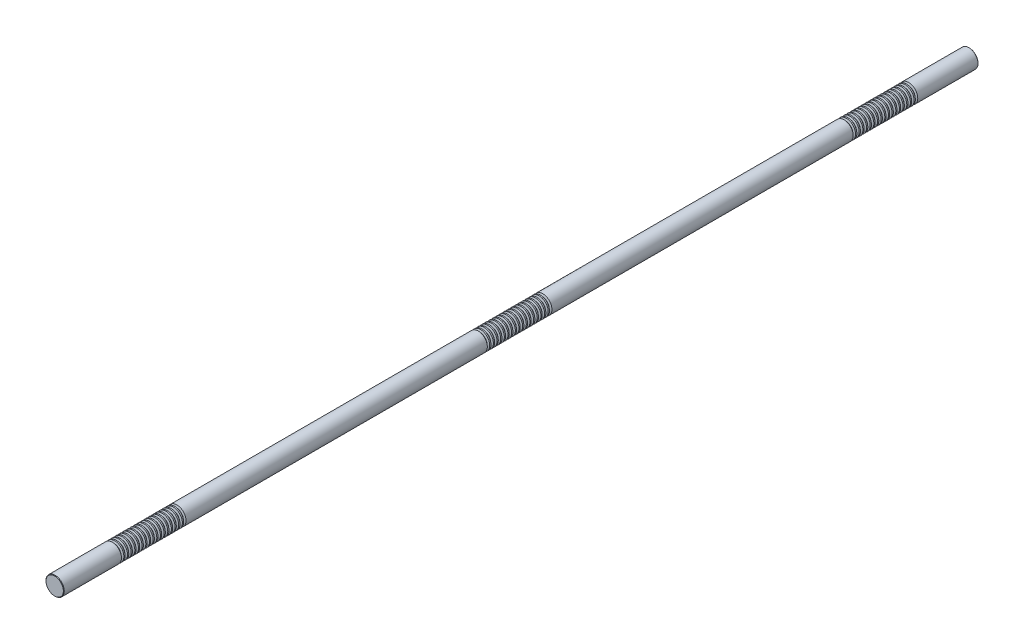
ISO-10303-21;
HEADER;
FILE_DESCRIPTION(('STEP AP214'),'2;1');
FILE_NAME('part.step','',(''),(''),'','','');
FILE_SCHEMA(('AUTOMOTIVE_DESIGN { 1 0 10303 214 1 1 1 1 }'));
ENDSEC;
DATA;
#1=APPLICATION_CONTEXT('core data for automotive mechanical design processes');
#2=APPLICATION_PROTOCOL_DEFINITION('international standard','automotive_design',2000,#1);
#3=PRODUCT_CONTEXT('',#1,'mechanical');
#4=PRODUCT('Part','Part','',(#3));
#5=PRODUCT_RELATED_PRODUCT_CATEGORY('part','',(#4));
#6=PRODUCT_DEFINITION_FORMATION('','',#4);
#7=PRODUCT_DEFINITION_CONTEXT('part definition',#1,'design');
#8=PRODUCT_DEFINITION('design','',#6,#7);
#9=PRODUCT_DEFINITION_SHAPE('','',#8);
#10=(LENGTH_UNIT() NAMED_UNIT(*) SI_UNIT(.MILLI.,.METRE.));
#11=(NAMED_UNIT(*) PLANE_ANGLE_UNIT() SI_UNIT($,.RADIAN.));
#12=(NAMED_UNIT(*) SI_UNIT($,.STERADIAN.) SOLID_ANGLE_UNIT());
#13=UNCERTAINTY_MEASURE_WITH_UNIT(LENGTH_MEASURE(1.E-05),#10,'distance_accuracy_value','');
#14=(GEOMETRIC_REPRESENTATION_CONTEXT(3) GLOBAL_UNCERTAINTY_ASSIGNED_CONTEXT((#13)) GLOBAL_UNIT_ASSIGNED_CONTEXT((#10,
#11,#12)) REPRESENTATION_CONTEXT('',''));
#15=CARTESIAN_POINT('',(0.,0.,0.));
#16=DIRECTION('',(0.,0.,1.));
#17=DIRECTION('',(1.,0.,0.));
#18=AXIS2_PLACEMENT_3D('',#15,#16,#17);
#19=CARTESIAN_POINT('',(0.,0.,750.));
#20=DIRECTION('',(0.,0.,-1.));
#21=DIRECTION('',(-1.,0.,0.));
#22=AXIS2_PLACEMENT_3D('',#19,#20,#21);
#23=CYLINDRICAL_SURFACE('',#22,15.);
#24=CARTESIAN_POINT('',(0.,0.,649.468911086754));
#25=DIRECTION('',(0.,0.,1.));
#26=DIRECTION('',(1.,0.,0.));
#27=AXIS2_PLACEMENT_3D('',#24,#25,#26);
#28=CIRCLE('',#27,15.);
#29=CARTESIAN_POINT('',(15.,0.,649.468911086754));
#30=VERTEX_POINT('',#29);
#31=EDGE_CURVE('E897',#30,#30,#28,.T.);
#32=ORIENTED_EDGE('',*,*,#31,.T.);
#33=EDGE_LOOP('',(#32));
#34=FACE_BOUND('',#33,.T.);
#35=CARTESIAN_POINT('',(0.,0.,651.531088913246));
#36=DIRECTION('',(0.,0.,1.));
#37=DIRECTION('',(1.,0.,0.));
#38=AXIS2_PLACEMENT_3D('',#35,#36,#37);
#39=CIRCLE('',#38,15.);
#40=CARTESIAN_POINT('',(15.,0.,651.531088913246));
#41=VERTEX_POINT('',#40);
#42=EDGE_CURVE('E909',#41,#41,#39,.T.);
#43=ORIENTED_EDGE('',*,*,#42,.F.);
#44=EDGE_LOOP('',(#43));
#45=FACE_BOUND('',#44,.T.);
#46=ADVANCED_FACE('F37',(#34,#45),#23,.T.);
#47=CARTESIAN_POINT('',(0.,0.,643.468911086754));
#48=DIRECTION('',(0.,0.,1.));
#49=DIRECTION('',(1.,0.,0.));
#50=AXIS2_PLACEMENT_3D('',#47,#48,#49);
#51=CIRCLE('',#50,15.);
#52=CARTESIAN_POINT('',(15.,0.,643.468911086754));
#53=VERTEX_POINT('',#52);
#54=EDGE_CURVE('E881',#53,#53,#51,.T.);
#55=ORIENTED_EDGE('',*,*,#54,.T.);
#56=EDGE_LOOP('',(#55));
#57=FACE_BOUND('',#56,.T.);
#58=CARTESIAN_POINT('',(0.,0.,645.531088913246));
#59=DIRECTION('',(0.,0.,1.));
#60=DIRECTION('',(1.,0.,0.));
#61=AXIS2_PLACEMENT_3D('',#58,#59,#60);
#62=CIRCLE('',#61,15.);
#63=CARTESIAN_POINT('',(15.,0.,645.531088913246));
#64=VERTEX_POINT('',#63);
#65=EDGE_CURVE('E893',#64,#64,#62,.T.);
#66=ORIENTED_EDGE('',*,*,#65,.F.);
#67=EDGE_LOOP('',(#66));
#68=FACE_BOUND('',#67,.T.);
#69=ADVANCED_FACE('F945',(#57,#68),#23,.T.);
#70=CARTESIAN_POINT('',(0.,0.,637.468911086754));
#71=DIRECTION('',(0.,0.,1.));
#72=DIRECTION('',(1.,0.,0.));
#73=AXIS2_PLACEMENT_3D('',#70,#71,#72);
#74=CIRCLE('',#73,15.);
#75=CARTESIAN_POINT('',(15.,0.,637.468911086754));
#76=VERTEX_POINT('',#75);
#77=EDGE_CURVE('E865',#76,#76,#74,.T.);
#78=ORIENTED_EDGE('',*,*,#77,.T.);
#79=EDGE_LOOP('',(#78));
#80=FACE_BOUND('',#79,.T.);
#81=CARTESIAN_POINT('',(0.,0.,639.531088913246));
#82=DIRECTION('',(0.,0.,1.));
#83=DIRECTION('',(1.,0.,0.));
#84=AXIS2_PLACEMENT_3D('',#81,#82,#83);
#85=CIRCLE('',#84,15.);
#86=CARTESIAN_POINT('',(15.,0.,639.531088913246));
#87=VERTEX_POINT('',#86);
#88=EDGE_CURVE('E877',#87,#87,#85,.T.);
#89=ORIENTED_EDGE('',*,*,#88,.F.);
#90=EDGE_LOOP('',(#89));
#91=FACE_BOUND('',#90,.T.);
#92=ADVANCED_FACE('F953',(#80,#91),#23,.T.);
#93=CARTESIAN_POINT('',(0.,0.,631.468911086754));
#94=DIRECTION('',(0.,0.,1.));
#95=DIRECTION('',(1.,0.,0.));
#96=AXIS2_PLACEMENT_3D('',#93,#94,#95);
#97=CIRCLE('',#96,15.);
#98=CARTESIAN_POINT('',(15.,0.,631.468911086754));
#99=VERTEX_POINT('',#98);
#100=EDGE_CURVE('E849',#99,#99,#97,.T.);
#101=ORIENTED_EDGE('',*,*,#100,.T.);
#102=EDGE_LOOP('',(#101));
#103=FACE_BOUND('',#102,.T.);
#104=CARTESIAN_POINT('',(0.,0.,633.531088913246));
#105=DIRECTION('',(0.,0.,1.));
#106=DIRECTION('',(1.,0.,0.));
#107=AXIS2_PLACEMENT_3D('',#104,#105,#106);
#108=CIRCLE('',#107,15.);
#109=CARTESIAN_POINT('',(15.,0.,633.531088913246));
#110=VERTEX_POINT('',#109);
#111=EDGE_CURVE('E861',#110,#110,#108,.T.);
#112=ORIENTED_EDGE('',*,*,#111,.F.);
#113=EDGE_LOOP('',(#112));
#114=FACE_BOUND('',#113,.T.);
#115=ADVANCED_FACE('F2098',(#103,#114),#23,.T.);
#116=CARTESIAN_POINT('',(0.,0.,625.468911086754));
#117=DIRECTION('',(0.,0.,1.));
#118=DIRECTION('',(1.,0.,0.));
#119=AXIS2_PLACEMENT_3D('',#116,#117,#118);
#120=CIRCLE('',#119,15.);
#121=CARTESIAN_POINT('',(15.,0.,625.468911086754));
#122=VERTEX_POINT('',#121);
#123=EDGE_CURVE('E833',#122,#122,#120,.T.);
#124=ORIENTED_EDGE('',*,*,#123,.T.);
#125=EDGE_LOOP('',(#124));
#126=FACE_BOUND('',#125,.T.);
#127=CARTESIAN_POINT('',(0.,0.,627.531088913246));
#128=DIRECTION('',(0.,0.,1.));
#129=DIRECTION('',(1.,0.,0.));
#130=AXIS2_PLACEMENT_3D('',#127,#128,#129);
#131=CIRCLE('',#130,15.);
#132=CARTESIAN_POINT('',(15.,0.,627.531088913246));
#133=VERTEX_POINT('',#132);
#134=EDGE_CURVE('E845',#133,#133,#131,.T.);
#135=ORIENTED_EDGE('',*,*,#134,.F.);
#136=EDGE_LOOP('',(#135));
#137=FACE_BOUND('',#136,.T.);
#138=ADVANCED_FACE('F2075',(#126,#137),#23,.T.);
#139=CARTESIAN_POINT('',(0.,0.,619.468911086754));
#140=DIRECTION('',(0.,0.,1.));
#141=DIRECTION('',(1.,0.,0.));
#142=AXIS2_PLACEMENT_3D('',#139,#140,#141);
#143=CIRCLE('',#142,15.);
#144=CARTESIAN_POINT('',(15.,0.,619.468911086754));
#145=VERTEX_POINT('',#144);
#146=EDGE_CURVE('E817',#145,#145,#143,.T.);
#147=ORIENTED_EDGE('',*,*,#146,.T.);
#148=EDGE_LOOP('',(#147));
#149=FACE_BOUND('',#148,.T.);
#150=CARTESIAN_POINT('',(0.,0.,621.531088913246));
#151=DIRECTION('',(0.,0.,1.));
#152=DIRECTION('',(1.,0.,0.));
#153=AXIS2_PLACEMENT_3D('',#150,#151,#152);
#154=CIRCLE('',#153,15.);
#155=CARTESIAN_POINT('',(15.,0.,621.531088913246));
#156=VERTEX_POINT('',#155);
#157=EDGE_CURVE('E829',#156,#156,#154,.T.);
#158=ORIENTED_EDGE('',*,*,#157,.F.);
#159=EDGE_LOOP('',(#158));
#160=FACE_BOUND('',#159,.T.);
#161=ADVANCED_FACE('F2052',(#149,#160),#23,.T.);
#162=CARTESIAN_POINT('',(0.,0.,613.468911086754));
#163=DIRECTION('',(0.,0.,1.));
#164=DIRECTION('',(1.,0.,0.));
#165=AXIS2_PLACEMENT_3D('',#162,#163,#164);
#166=CIRCLE('',#165,15.);
#167=CARTESIAN_POINT('',(15.,0.,613.468911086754));
#168=VERTEX_POINT('',#167);
#169=EDGE_CURVE('E801',#168,#168,#166,.T.);
#170=ORIENTED_EDGE('',*,*,#169,.T.);
#171=EDGE_LOOP('',(#170));
#172=FACE_BOUND('',#171,.T.);
#173=CARTESIAN_POINT('',(0.,0.,615.531088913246));
#174=DIRECTION('',(0.,0.,1.));
#175=DIRECTION('',(1.,0.,0.));
#176=AXIS2_PLACEMENT_3D('',#173,#174,#175);
#177=CIRCLE('',#176,15.);
#178=CARTESIAN_POINT('',(15.,0.,615.531088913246));
#179=VERTEX_POINT('',#178);
#180=EDGE_CURVE('E813',#179,#179,#177,.T.);
#181=ORIENTED_EDGE('',*,*,#180,.F.);
#182=EDGE_LOOP('',(#181));
#183=FACE_BOUND('',#182,.T.);
#184=ADVANCED_FACE('F2029',(#172,#183),#23,.T.);
#185=CARTESIAN_POINT('',(0.,0.,607.468911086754));
#186=DIRECTION('',(0.,0.,1.));
#187=DIRECTION('',(1.,0.,0.));
#188=AXIS2_PLACEMENT_3D('',#185,#186,#187);
#189=CIRCLE('',#188,15.);
#190=CARTESIAN_POINT('',(15.,0.,607.468911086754));
#191=VERTEX_POINT('',#190);
#192=EDGE_CURVE('E785',#191,#191,#189,.T.);
#193=ORIENTED_EDGE('',*,*,#192,.T.);
#194=EDGE_LOOP('',(#193));
#195=FACE_BOUND('',#194,.T.);
#196=CARTESIAN_POINT('',(0.,0.,609.531088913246));
#197=DIRECTION('',(0.,0.,1.));
#198=DIRECTION('',(1.,0.,0.));
#199=AXIS2_PLACEMENT_3D('',#196,#197,#198);
#200=CIRCLE('',#199,15.);
#201=CARTESIAN_POINT('',(15.,0.,609.531088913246));
#202=VERTEX_POINT('',#201);
#203=EDGE_CURVE('E797',#202,#202,#200,.T.);
#204=ORIENTED_EDGE('',*,*,#203,.F.);
#205=EDGE_LOOP('',(#204));
#206=FACE_BOUND('',#205,.T.);
#207=ADVANCED_FACE('F2006',(#195,#206),#23,.T.);
#208=CARTESIAN_POINT('',(0.,0.,601.468911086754));
#209=DIRECTION('',(0.,0.,1.));
#210=DIRECTION('',(1.,0.,0.));
#211=AXIS2_PLACEMENT_3D('',#208,#209,#210);
#212=CIRCLE('',#211,15.);
#213=CARTESIAN_POINT('',(15.,0.,601.468911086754));
#214=VERTEX_POINT('',#213);
#215=EDGE_CURVE('E769',#214,#214,#212,.T.);
#216=ORIENTED_EDGE('',*,*,#215,.T.);
#217=EDGE_LOOP('',(#216));
#218=FACE_BOUND('',#217,.T.);
#219=CARTESIAN_POINT('',(0.,0.,603.531088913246));
#220=DIRECTION('',(0.,0.,1.));
#221=DIRECTION('',(1.,0.,0.));
#222=AXIS2_PLACEMENT_3D('',#219,#220,#221);
#223=CIRCLE('',#222,15.);
#224=CARTESIAN_POINT('',(15.,0.,603.531088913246));
#225=VERTEX_POINT('',#224);
#226=EDGE_CURVE('E781',#225,#225,#223,.T.);
#227=ORIENTED_EDGE('',*,*,#226,.F.);
#228=EDGE_LOOP('',(#227));
#229=FACE_BOUND('',#228,.T.);
#230=ADVANCED_FACE('F1983',(#218,#229),#23,.T.);
#231=CARTESIAN_POINT('',(0.,0.,595.468911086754));
#232=DIRECTION('',(0.,0.,1.));
#233=DIRECTION('',(1.,0.,0.));
#234=AXIS2_PLACEMENT_3D('',#231,#232,#233);
#235=CIRCLE('',#234,15.);
#236=CARTESIAN_POINT('',(15.,0.,595.468911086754));
#237=VERTEX_POINT('',#236);
#238=EDGE_CURVE('E753',#237,#237,#235,.T.);
#239=ORIENTED_EDGE('',*,*,#238,.T.);
#240=EDGE_LOOP('',(#239));
#241=FACE_BOUND('',#240,.T.);
#242=CARTESIAN_POINT('',(0.,0.,597.531088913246));
#243=DIRECTION('',(0.,0.,1.));
#244=DIRECTION('',(1.,0.,0.));
#245=AXIS2_PLACEMENT_3D('',#242,#243,#244);
#246=CIRCLE('',#245,15.);
#247=CARTESIAN_POINT('',(15.,0.,597.531088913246));
#248=VERTEX_POINT('',#247);
#249=EDGE_CURVE('E765',#248,#248,#246,.T.);
#250=ORIENTED_EDGE('',*,*,#249,.F.);
#251=EDGE_LOOP('',(#250));
#252=FACE_BOUND('',#251,.T.);
#253=ADVANCED_FACE('F1960',(#241,#252),#23,.T.);
#254=CARTESIAN_POINT('',(0.,0.,589.468911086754));
#255=DIRECTION('',(0.,0.,1.));
#256=DIRECTION('',(1.,0.,0.));
#257=AXIS2_PLACEMENT_3D('',#254,#255,#256);
#258=CIRCLE('',#257,15.);
#259=CARTESIAN_POINT('',(15.,0.,589.468911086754));
#260=VERTEX_POINT('',#259);
#261=EDGE_CURVE('E738',#260,#260,#258,.T.);
#262=ORIENTED_EDGE('',*,*,#261,.T.);
#263=EDGE_LOOP('',(#262));
#264=FACE_BOUND('',#263,.T.);
#265=CARTESIAN_POINT('',(0.,0.,591.531088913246));
#266=DIRECTION('',(0.,0.,1.));
#267=DIRECTION('',(1.,0.,0.));
#268=AXIS2_PLACEMENT_3D('',#265,#266,#267);
#269=CIRCLE('',#268,15.);
#270=CARTESIAN_POINT('',(15.,0.,591.531088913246));
#271=VERTEX_POINT('',#270);
#272=EDGE_CURVE('E749',#271,#271,#269,.T.);
#273=ORIENTED_EDGE('',*,*,#272,.F.);
#274=EDGE_LOOP('',(#273));
#275=FACE_BOUND('',#274,.T.);
#276=ADVANCED_FACE('F1937',(#264,#275),#23,.T.);
#277=CARTESIAN_POINT('',(0.,0.,583.468911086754));
#278=DIRECTION('',(0.,0.,1.));
#279=DIRECTION('',(1.,0.,0.));
#280=AXIS2_PLACEMENT_3D('',#277,#278,#279);
#281=CIRCLE('',#280,15.);
#282=CARTESIAN_POINT('',(15.,0.,583.468911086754));
#283=VERTEX_POINT('',#282);
#284=EDGE_CURVE('E723',#283,#283,#281,.T.);
#285=ORIENTED_EDGE('',*,*,#284,.T.);
#286=EDGE_LOOP('',(#285));
#287=FACE_BOUND('',#286,.T.);
#288=CARTESIAN_POINT('',(0.,0.,585.531088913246));
#289=DIRECTION('',(0.,0.,1.));
#290=DIRECTION('',(1.,0.,0.));
#291=AXIS2_PLACEMENT_3D('',#288,#289,#290);
#292=CIRCLE('',#291,15.);
#293=CARTESIAN_POINT('',(15.,0.,585.531088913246));
#294=VERTEX_POINT('',#293);
#295=EDGE_CURVE('E734',#294,#294,#292,.T.);
#296=ORIENTED_EDGE('',*,*,#295,.F.);
#297=EDGE_LOOP('',(#296));
#298=FACE_BOUND('',#297,.T.);
#299=ADVANCED_FACE('F1914',(#287,#298),#23,.T.);
#300=CARTESIAN_POINT('',(0.,0.,577.468911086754));
#301=DIRECTION('',(0.,0.,1.));
#302=DIRECTION('',(1.,0.,0.));
#303=AXIS2_PLACEMENT_3D('',#300,#301,#302);
#304=CIRCLE('',#303,15.);
#305=CARTESIAN_POINT('',(15.,0.,577.468911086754));
#306=VERTEX_POINT('',#305);
#307=EDGE_CURVE('E707',#306,#306,#304,.T.);
#308=ORIENTED_EDGE('',*,*,#307,.T.);
#309=EDGE_LOOP('',(#308));
#310=FACE_BOUND('',#309,.T.);
#311=CARTESIAN_POINT('',(0.,0.,579.531088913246));
#312=DIRECTION('',(0.,0.,1.));
#313=DIRECTION('',(1.,0.,0.));
#314=AXIS2_PLACEMENT_3D('',#311,#312,#313);
#315=CIRCLE('',#314,15.);
#316=CARTESIAN_POINT('',(15.,0.,579.531088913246));
#317=VERTEX_POINT('',#316);
#318=EDGE_CURVE('E719',#317,#317,#315,.T.);
#319=ORIENTED_EDGE('',*,*,#318,.F.);
#320=EDGE_LOOP('',(#319));
#321=FACE_BOUND('',#320,.T.);
#322=ADVANCED_FACE('F1891',(#310,#321),#23,.T.);
#323=CARTESIAN_POINT('',(0.,0.,571.468911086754));
#324=DIRECTION('',(0.,0.,1.));
#325=DIRECTION('',(1.,0.,0.));
#326=AXIS2_PLACEMENT_3D('',#323,#324,#325);
#327=CIRCLE('',#326,15.);
#328=CARTESIAN_POINT('',(15.,0.,571.468911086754));
#329=VERTEX_POINT('',#328);
#330=EDGE_CURVE('E691',#329,#329,#327,.T.);
#331=ORIENTED_EDGE('',*,*,#330,.T.);
#332=EDGE_LOOP('',(#331));
#333=FACE_BOUND('',#332,.T.);
#334=CARTESIAN_POINT('',(0.,0.,573.531088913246));
#335=DIRECTION('',(0.,0.,1.));
#336=DIRECTION('',(1.,0.,0.));
#337=AXIS2_PLACEMENT_3D('',#334,#335,#336);
#338=CIRCLE('',#337,15.);
#339=CARTESIAN_POINT('',(15.,0.,573.531088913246));
#340=VERTEX_POINT('',#339);
#341=EDGE_CURVE('E703',#340,#340,#338,.T.);
#342=ORIENTED_EDGE('',*,*,#341,.F.);
#343=EDGE_LOOP('',(#342));
#344=FACE_BOUND('',#343,.T.);
#345=ADVANCED_FACE('F1868',(#333,#344),#23,.T.);
#346=CARTESIAN_POINT('',(0.,0.,565.468911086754));
#347=DIRECTION('',(0.,0.,1.));
#348=DIRECTION('',(1.,0.,0.));
#349=AXIS2_PLACEMENT_3D('',#346,#347,#348);
#350=CIRCLE('',#349,15.);
#351=CARTESIAN_POINT('',(15.,0.,565.468911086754));
#352=VERTEX_POINT('',#351);
#353=EDGE_CURVE('E675',#352,#352,#350,.T.);
#354=ORIENTED_EDGE('',*,*,#353,.T.);
#355=EDGE_LOOP('',(#354));
#356=FACE_BOUND('',#355,.T.);
#357=CARTESIAN_POINT('',(0.,0.,567.531088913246));
#358=DIRECTION('',(0.,0.,1.));
#359=DIRECTION('',(1.,0.,0.));
#360=AXIS2_PLACEMENT_3D('',#357,#358,#359);
#361=CIRCLE('',#360,15.);
#362=CARTESIAN_POINT('',(15.,0.,567.531088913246));
#363=VERTEX_POINT('',#362);
#364=EDGE_CURVE('E687',#363,#363,#361,.T.);
#365=ORIENTED_EDGE('',*,*,#364,.F.);
#366=EDGE_LOOP('',(#365));
#367=FACE_BOUND('',#366,.T.);
#368=ADVANCED_FACE('F1845',(#356,#367),#23,.T.);
#369=CARTESIAN_POINT('',(0.,0.,559.468911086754));
#370=DIRECTION('',(0.,0.,1.));
#371=DIRECTION('',(1.,0.,0.));
#372=AXIS2_PLACEMENT_3D('',#369,#370,#371);
#373=CIRCLE('',#372,15.);
#374=CARTESIAN_POINT('',(15.,0.,559.468911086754));
#375=VERTEX_POINT('',#374);
#376=EDGE_CURVE('E659',#375,#375,#373,.T.);
#377=ORIENTED_EDGE('',*,*,#376,.T.);
#378=EDGE_LOOP('',(#377));
#379=FACE_BOUND('',#378,.T.);
#380=CARTESIAN_POINT('',(0.,0.,561.531088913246));
#381=DIRECTION('',(0.,0.,1.));
#382=DIRECTION('',(1.,0.,0.));
#383=AXIS2_PLACEMENT_3D('',#380,#381,#382);
#384=CIRCLE('',#383,15.);
#385=CARTESIAN_POINT('',(15.,0.,561.531088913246));
#386=VERTEX_POINT('',#385);
#387=EDGE_CURVE('E671',#386,#386,#384,.T.);
#388=ORIENTED_EDGE('',*,*,#387,.F.);
#389=EDGE_LOOP('',(#388));
#390=FACE_BOUND('',#389,.T.);
#391=ADVANCED_FACE('F1826',(#379,#390),#23,.T.);
#392=CARTESIAN_POINT('',(0.,0.,553.468911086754));
#393=DIRECTION('',(0.,0.,1.));
#394=DIRECTION('',(1.,0.,0.));
#395=AXIS2_PLACEMENT_3D('',#392,#393,#394);
#396=CIRCLE('',#395,15.);
#397=CARTESIAN_POINT('',(15.,0.,553.468911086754));
#398=VERTEX_POINT('',#397);
#399=EDGE_CURVE('E371',#398,#398,#396,.T.);
#400=ORIENTED_EDGE('',*,*,#399,.T.);
#401=EDGE_LOOP('',(#400));
#402=FACE_BOUND('',#401,.T.);
#403=CARTESIAN_POINT('',(0.,0.,555.531088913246));
#404=DIRECTION('',(0.,0.,1.));
#405=DIRECTION('',(1.,0.,0.));
#406=AXIS2_PLACEMENT_3D('',#403,#404,#405);
#407=CIRCLE('',#406,15.);
#408=CARTESIAN_POINT('',(15.,0.,555.531088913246));
#409=VERTEX_POINT('',#408);
#410=EDGE_CURVE('E655',#409,#409,#407,.T.);
#411=ORIENTED_EDGE('',*,*,#410,.F.);
#412=EDGE_LOOP('',(#411));
#413=FACE_BOUND('',#412,.T.);
#414=ADVANCED_FACE('F1775',(#402,#413),#23,.T.);
#415=CARTESIAN_POINT('',(0.,0.,49.4689110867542));
#416=DIRECTION('',(0.,0.,1.));
#417=DIRECTION('',(1.,0.,0.));
#418=AXIS2_PLACEMENT_3D('',#415,#416,#417);
#419=CIRCLE('',#418,15.);
#420=CARTESIAN_POINT('',(15.,0.,49.4689110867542));
#421=VERTEX_POINT('',#420);
#422=EDGE_CURVE('E627',#421,#421,#419,.T.);
#423=ORIENTED_EDGE('',*,*,#422,.T.);
#424=EDGE_LOOP('',(#423));
#425=FACE_BOUND('',#424,.T.);
#426=CARTESIAN_POINT('',(0.,0.,51.5310889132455));
#427=DIRECTION('',(0.,0.,1.));
#428=DIRECTION('',(1.,0.,0.));
#429=AXIS2_PLACEMENT_3D('',#426,#427,#428);
#430=CIRCLE('',#429,15.);
#431=CARTESIAN_POINT('',(15.,0.,51.5310889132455));
#432=VERTEX_POINT('',#431);
#433=EDGE_CURVE('E639',#432,#432,#430,.T.);
#434=ORIENTED_EDGE('',*,*,#433,.F.);
#435=EDGE_LOOP('',(#434));
#436=FACE_BOUND('',#435,.T.);
#437=ADVANCED_FACE('F1751',(#425,#436),#23,.T.);
#438=CARTESIAN_POINT('',(0.,0.,43.4689110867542));
#439=DIRECTION('',(0.,0.,1.));
#440=DIRECTION('',(1.,0.,0.));
#441=AXIS2_PLACEMENT_3D('',#438,#439,#440);
#442=CIRCLE('',#441,15.);
#443=CARTESIAN_POINT('',(15.,0.,43.4689110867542));
#444=VERTEX_POINT('',#443);
#445=EDGE_CURVE('E611',#444,#444,#442,.T.);
#446=ORIENTED_EDGE('',*,*,#445,.T.);
#447=EDGE_LOOP('',(#446));
#448=FACE_BOUND('',#447,.T.);
#449=CARTESIAN_POINT('',(0.,0.,45.5310889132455));
#450=DIRECTION('',(0.,0.,1.));
#451=DIRECTION('',(1.,0.,0.));
#452=AXIS2_PLACEMENT_3D('',#449,#450,#451);
#453=CIRCLE('',#452,15.);
#454=CARTESIAN_POINT('',(15.,0.,45.5310889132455));
#455=VERTEX_POINT('',#454);
#456=EDGE_CURVE('E623',#455,#455,#453,.T.);
#457=ORIENTED_EDGE('',*,*,#456,.F.);
#458=EDGE_LOOP('',(#457));
#459=FACE_BOUND('',#458,.T.);
#460=ADVANCED_FACE('F1728',(#448,#459),#23,.T.);
#461=CARTESIAN_POINT('',(0.,0.,37.4689110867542));
#462=DIRECTION('',(0.,0.,1.));
#463=DIRECTION('',(1.,0.,0.));
#464=AXIS2_PLACEMENT_3D('',#461,#462,#463);
#465=CIRCLE('',#464,15.);
#466=CARTESIAN_POINT('',(15.,0.,37.4689110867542));
#467=VERTEX_POINT('',#466);
#468=EDGE_CURVE('E595',#467,#467,#465,.T.);
#469=ORIENTED_EDGE('',*,*,#468,.T.);
#470=EDGE_LOOP('',(#469));
#471=FACE_BOUND('',#470,.T.);
#472=CARTESIAN_POINT('',(0.,0.,39.5310889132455));
#473=DIRECTION('',(0.,0.,1.));
#474=DIRECTION('',(1.,0.,0.));
#475=AXIS2_PLACEMENT_3D('',#472,#473,#474);
#476=CIRCLE('',#475,15.);
#477=CARTESIAN_POINT('',(15.,0.,39.5310889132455));
#478=VERTEX_POINT('',#477);
#479=EDGE_CURVE('E607',#478,#478,#476,.T.);
#480=ORIENTED_EDGE('',*,*,#479,.F.);
#481=EDGE_LOOP('',(#480));
#482=FACE_BOUND('',#481,.T.);
#483=ADVANCED_FACE('F1705',(#471,#482),#23,.T.);
#484=CARTESIAN_POINT('',(0.,0.,31.4689110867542));
#485=DIRECTION('',(0.,0.,1.));
#486=DIRECTION('',(1.,0.,0.));
#487=AXIS2_PLACEMENT_3D('',#484,#485,#486);
#488=CIRCLE('',#487,15.);
#489=CARTESIAN_POINT('',(15.,0.,31.4689110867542));
#490=VERTEX_POINT('',#489);
#491=EDGE_CURVE('E579',#490,#490,#488,.T.);
#492=ORIENTED_EDGE('',*,*,#491,.T.);
#493=EDGE_LOOP('',(#492));
#494=FACE_BOUND('',#493,.T.);
#495=CARTESIAN_POINT('',(0.,0.,33.5310889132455));
#496=DIRECTION('',(0.,0.,1.));
#497=DIRECTION('',(1.,0.,0.));
#498=AXIS2_PLACEMENT_3D('',#495,#496,#497);
#499=CIRCLE('',#498,15.);
#500=CARTESIAN_POINT('',(15.,0.,33.5310889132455));
#501=VERTEX_POINT('',#500);
#502=EDGE_CURVE('E591',#501,#501,#499,.T.);
#503=ORIENTED_EDGE('',*,*,#502,.F.);
#504=EDGE_LOOP('',(#503));
#505=FACE_BOUND('',#504,.T.);
#506=ADVANCED_FACE('F1682',(#494,#505),#23,.T.);
#507=CARTESIAN_POINT('',(0.,0.,25.4689110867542));
#508=DIRECTION('',(0.,0.,1.));
#509=DIRECTION('',(1.,0.,0.));
#510=AXIS2_PLACEMENT_3D('',#507,#508,#509);
#511=CIRCLE('',#510,15.);
#512=CARTESIAN_POINT('',(15.,0.,25.4689110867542));
#513=VERTEX_POINT('',#512);
#514=EDGE_CURVE('E563',#513,#513,#511,.T.);
#515=ORIENTED_EDGE('',*,*,#514,.T.);
#516=EDGE_LOOP('',(#515));
#517=FACE_BOUND('',#516,.T.);
#518=CARTESIAN_POINT('',(0.,0.,27.5310889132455));
#519=DIRECTION('',(0.,0.,1.));
#520=DIRECTION('',(1.,0.,0.));
#521=AXIS2_PLACEMENT_3D('',#518,#519,#520);
#522=CIRCLE('',#521,15.);
#523=CARTESIAN_POINT('',(15.,0.,27.5310889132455));
#524=VERTEX_POINT('',#523);
#525=EDGE_CURVE('E575',#524,#524,#522,.T.);
#526=ORIENTED_EDGE('',*,*,#525,.F.);
#527=EDGE_LOOP('',(#526));
#528=FACE_BOUND('',#527,.T.);
#529=ADVANCED_FACE('F1659',(#517,#528),#23,.T.);
#530=CARTESIAN_POINT('',(0.,0.,19.4689110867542));
#531=DIRECTION('',(0.,0.,1.));
#532=DIRECTION('',(1.,0.,0.));
#533=AXIS2_PLACEMENT_3D('',#530,#531,#532);
#534=CIRCLE('',#533,15.);
#535=CARTESIAN_POINT('',(15.,0.,19.4689110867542));
#536=VERTEX_POINT('',#535);
#537=EDGE_CURVE('E547',#536,#536,#534,.T.);
#538=ORIENTED_EDGE('',*,*,#537,.T.);
#539=EDGE_LOOP('',(#538));
#540=FACE_BOUND('',#539,.T.);
#541=CARTESIAN_POINT('',(0.,0.,21.5310889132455));
#542=DIRECTION('',(0.,0.,1.));
#543=DIRECTION('',(1.,0.,0.));
#544=AXIS2_PLACEMENT_3D('',#541,#542,#543);
#545=CIRCLE('',#544,15.);
#546=CARTESIAN_POINT('',(15.,0.,21.5310889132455));
#547=VERTEX_POINT('',#546);
#548=EDGE_CURVE('E559',#547,#547,#545,.T.);
#549=ORIENTED_EDGE('',*,*,#548,.F.);
#550=EDGE_LOOP('',(#549));
#551=FACE_BOUND('',#550,.T.);
#552=ADVANCED_FACE('F1636',(#540,#551),#23,.T.);
#553=CARTESIAN_POINT('',(0.,0.,13.4689110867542));
#554=DIRECTION('',(0.,0.,1.));
#555=DIRECTION('',(1.,0.,0.));
#556=AXIS2_PLACEMENT_3D('',#553,#554,#555);
#557=CIRCLE('',#556,15.);
#558=CARTESIAN_POINT('',(15.,0.,13.4689110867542));
#559=VERTEX_POINT('',#558);
#560=EDGE_CURVE('E531',#559,#559,#557,.T.);
#561=ORIENTED_EDGE('',*,*,#560,.T.);
#562=EDGE_LOOP('',(#561));
#563=FACE_BOUND('',#562,.T.);
#564=CARTESIAN_POINT('',(0.,0.,15.5310889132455));
#565=DIRECTION('',(0.,0.,1.));
#566=DIRECTION('',(1.,0.,0.));
#567=AXIS2_PLACEMENT_3D('',#564,#565,#566);
#568=CIRCLE('',#567,15.);
#569=CARTESIAN_POINT('',(15.,0.,15.5310889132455));
#570=VERTEX_POINT('',#569);
#571=EDGE_CURVE('E543',#570,#570,#568,.T.);
#572=ORIENTED_EDGE('',*,*,#571,.F.);
#573=EDGE_LOOP('',(#572));
#574=FACE_BOUND('',#573,.T.);
#575=ADVANCED_FACE('F1613',(#563,#574),#23,.T.);
#576=CARTESIAN_POINT('',(0.,0.,7.46891108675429));
#577=DIRECTION('',(0.,0.,1.));
#578=DIRECTION('',(1.,0.,0.));
#579=AXIS2_PLACEMENT_3D('',#576,#577,#578);
#580=CIRCLE('',#579,15.);
#581=CARTESIAN_POINT('',(15.,0.,7.46891108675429));
#582=VERTEX_POINT('',#581);
#583=EDGE_CURVE('E515',#582,#582,#580,.T.);
#584=ORIENTED_EDGE('',*,*,#583,.T.);
#585=EDGE_LOOP('',(#584));
#586=FACE_BOUND('',#585,.T.);
#587=CARTESIAN_POINT('',(0.,0.,9.5310889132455));
#588=DIRECTION('',(0.,0.,1.));
#589=DIRECTION('',(1.,0.,0.));
#590=AXIS2_PLACEMENT_3D('',#587,#588,#589);
#591=CIRCLE('',#590,15.);
#592=CARTESIAN_POINT('',(15.,0.,9.5310889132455));
#593=VERTEX_POINT('',#592);
#594=EDGE_CURVE('E527',#593,#593,#591,.T.);
#595=ORIENTED_EDGE('',*,*,#594,.F.);
#596=EDGE_LOOP('',(#595));
#597=FACE_BOUND('',#596,.T.);
#598=ADVANCED_FACE('F1590',(#586,#597),#23,.T.);
#599=CARTESIAN_POINT('',(0.,0.,1.46891108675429));
#600=DIRECTION('',(0.,0.,1.));
#601=DIRECTION('',(1.,0.,0.));
#602=AXIS2_PLACEMENT_3D('',#599,#600,#601);
#603=CIRCLE('',#602,15.);
#604=CARTESIAN_POINT('',(15.,0.,1.46891108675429));
#605=VERTEX_POINT('',#604);
#606=EDGE_CURVE('E499',#605,#605,#603,.T.);
#607=ORIENTED_EDGE('',*,*,#606,.T.);
#608=EDGE_LOOP('',(#607));
#609=FACE_BOUND('',#608,.T.);
#610=CARTESIAN_POINT('',(0.,0.,3.53108891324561));
#611=DIRECTION('',(0.,0.,1.));
#612=DIRECTION('',(1.,0.,0.));
#613=AXIS2_PLACEMENT_3D('',#610,#611,#612);
#614=CIRCLE('',#613,15.);
#615=CARTESIAN_POINT('',(15.,0.,3.53108891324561));
#616=VERTEX_POINT('',#615);
#617=EDGE_CURVE('E511',#616,#616,#614,.T.);
#618=ORIENTED_EDGE('',*,*,#617,.F.);
#619=EDGE_LOOP('',(#618));
#620=FACE_BOUND('',#619,.T.);
#621=ADVANCED_FACE('F1567',(#609,#620),#23,.T.);
#622=CARTESIAN_POINT('',(0.,0.,-4.53108891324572));
#623=DIRECTION('',(0.,0.,1.));
#624=DIRECTION('',(1.,0.,0.));
#625=AXIS2_PLACEMENT_3D('',#622,#623,#624);
#626=CIRCLE('',#625,15.);
#627=CARTESIAN_POINT('',(15.,0.,-4.53108891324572));
#628=VERTEX_POINT('',#627);
#629=EDGE_CURVE('E483',#628,#628,#626,.T.);
#630=ORIENTED_EDGE('',*,*,#629,.T.);
#631=EDGE_LOOP('',(#630));
#632=FACE_BOUND('',#631,.T.);
#633=CARTESIAN_POINT('',(0.,0.,-2.4689110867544));
#634=DIRECTION('',(0.,0.,1.));
#635=DIRECTION('',(1.,0.,0.));
#636=AXIS2_PLACEMENT_3D('',#633,#634,#635);
#637=CIRCLE('',#636,15.);
#638=CARTESIAN_POINT('',(15.,0.,-2.4689110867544));
#639=VERTEX_POINT('',#638);
#640=EDGE_CURVE('E495',#639,#639,#637,.T.);
#641=ORIENTED_EDGE('',*,*,#640,.F.);
#642=EDGE_LOOP('',(#641));
#643=FACE_BOUND('',#642,.T.);
#644=ADVANCED_FACE('F1544',(#632,#643),#23,.T.);
#645=CARTESIAN_POINT('',(0.,0.,-10.5310889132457));
#646=DIRECTION('',(0.,0.,1.));
#647=DIRECTION('',(1.,0.,0.));
#648=AXIS2_PLACEMENT_3D('',#645,#646,#647);
#649=CIRCLE('',#648,15.);
#650=CARTESIAN_POINT('',(15.,0.,-10.5310889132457));
#651=VERTEX_POINT('',#650);
#652=EDGE_CURVE('E467',#651,#651,#649,.T.);
#653=ORIENTED_EDGE('',*,*,#652,.T.);
#654=EDGE_LOOP('',(#653));
#655=FACE_BOUND('',#654,.T.);
#656=CARTESIAN_POINT('',(0.,0.,-8.4689110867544));
#657=DIRECTION('',(0.,0.,1.));
#658=DIRECTION('',(1.,0.,0.));
#659=AXIS2_PLACEMENT_3D('',#656,#657,#658);
#660=CIRCLE('',#659,15.);
#661=CARTESIAN_POINT('',(15.,0.,-8.4689110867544));
#662=VERTEX_POINT('',#661);
#663=EDGE_CURVE('E479',#662,#662,#660,.T.);
#664=ORIENTED_EDGE('',*,*,#663,.F.);
#665=EDGE_LOOP('',(#664));
#666=FACE_BOUND('',#665,.T.);
#667=ADVANCED_FACE('F1521',(#655,#666),#23,.T.);
#668=CARTESIAN_POINT('',(0.,0.,-16.5310889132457));
#669=DIRECTION('',(0.,0.,1.));
#670=DIRECTION('',(1.,0.,0.));
#671=AXIS2_PLACEMENT_3D('',#668,#669,#670);
#672=CIRCLE('',#671,15.);
#673=CARTESIAN_POINT('',(15.,0.,-16.5310889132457));
#674=VERTEX_POINT('',#673);
#675=EDGE_CURVE('E451',#674,#674,#672,.T.);
#676=ORIENTED_EDGE('',*,*,#675,.T.);
#677=EDGE_LOOP('',(#676));
#678=FACE_BOUND('',#677,.T.);
#679=CARTESIAN_POINT('',(0.,0.,-14.4689110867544));
#680=DIRECTION('',(0.,0.,1.));
#681=DIRECTION('',(1.,0.,0.));
#682=AXIS2_PLACEMENT_3D('',#679,#680,#681);
#683=CIRCLE('',#682,15.);
#684=CARTESIAN_POINT('',(15.,0.,-14.4689110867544));
#685=VERTEX_POINT('',#684);
#686=EDGE_CURVE('E463',#685,#685,#683,.T.);
#687=ORIENTED_EDGE('',*,*,#686,.F.);
#688=EDGE_LOOP('',(#687));
#689=FACE_BOUND('',#688,.T.);
#690=ADVANCED_FACE('F1498',(#678,#689),#23,.T.);
#691=CARTESIAN_POINT('',(0.,0.,-22.5310889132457));
#692=DIRECTION('',(0.,0.,1.));
#693=DIRECTION('',(1.,0.,0.));
#694=AXIS2_PLACEMENT_3D('',#691,#692,#693);
#695=CIRCLE('',#694,15.);
#696=CARTESIAN_POINT('',(15.,0.,-22.5310889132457));
#697=VERTEX_POINT('',#696);
#698=EDGE_CURVE('E435',#697,#697,#695,.T.);
#699=ORIENTED_EDGE('',*,*,#698,.T.);
#700=EDGE_LOOP('',(#699));
#701=FACE_BOUND('',#700,.T.);
#702=CARTESIAN_POINT('',(0.,0.,-20.4689110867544));
#703=DIRECTION('',(0.,0.,1.));
#704=DIRECTION('',(1.,0.,0.));
#705=AXIS2_PLACEMENT_3D('',#702,#703,#704);
#706=CIRCLE('',#705,15.);
#707=CARTESIAN_POINT('',(15.,0.,-20.4689110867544));
#708=VERTEX_POINT('',#707);
#709=EDGE_CURVE('E447',#708,#708,#706,.T.);
#710=ORIENTED_EDGE('',*,*,#709,.F.);
#711=EDGE_LOOP('',(#710));
#712=FACE_BOUND('',#711,.T.);
#713=ADVANCED_FACE('F1475',(#701,#712),#23,.T.);
#714=CARTESIAN_POINT('',(0.,0.,-28.5310889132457));
#715=DIRECTION('',(0.,0.,1.));
#716=DIRECTION('',(1.,0.,0.));
#717=AXIS2_PLACEMENT_3D('',#714,#715,#716);
#718=CIRCLE('',#717,15.);
#719=CARTESIAN_POINT('',(15.,0.,-28.5310889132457));
#720=VERTEX_POINT('',#719);
#721=EDGE_CURVE('E419',#720,#720,#718,.T.);
#722=ORIENTED_EDGE('',*,*,#721,.T.);
#723=EDGE_LOOP('',(#722));
#724=FACE_BOUND('',#723,.T.);
#725=CARTESIAN_POINT('',(0.,0.,-26.4689110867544));
#726=DIRECTION('',(0.,0.,1.));
#727=DIRECTION('',(1.,0.,0.));
#728=AXIS2_PLACEMENT_3D('',#725,#726,#727);
#729=CIRCLE('',#728,15.);
#730=CARTESIAN_POINT('',(15.,0.,-26.4689110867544));
#731=VERTEX_POINT('',#730);
#732=EDGE_CURVE('E431',#731,#731,#729,.T.);
#733=ORIENTED_EDGE('',*,*,#732,.F.);
#734=EDGE_LOOP('',(#733));
#735=FACE_BOUND('',#734,.T.);
#736=ADVANCED_FACE('F1452',(#724,#735),#23,.T.);
#737=CARTESIAN_POINT('',(0.,0.,-34.5310889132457));
#738=DIRECTION('',(0.,0.,1.));
#739=DIRECTION('',(1.,0.,0.));
#740=AXIS2_PLACEMENT_3D('',#737,#738,#739);
#741=CIRCLE('',#740,15.);
#742=CARTESIAN_POINT('',(15.,0.,-34.5310889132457));
#743=VERTEX_POINT('',#742);
#744=EDGE_CURVE('E403',#743,#743,#741,.T.);
#745=ORIENTED_EDGE('',*,*,#744,.T.);
#746=EDGE_LOOP('',(#745));
#747=FACE_BOUND('',#746,.T.);
#748=CARTESIAN_POINT('',(0.,0.,-32.4689110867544));
#749=DIRECTION('',(0.,0.,1.));
#750=DIRECTION('',(1.,0.,0.));
#751=AXIS2_PLACEMENT_3D('',#748,#749,#750);
#752=CIRCLE('',#751,15.);
#753=CARTESIAN_POINT('',(15.,0.,-32.4689110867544));
#754=VERTEX_POINT('',#753);
#755=EDGE_CURVE('E415',#754,#754,#752,.T.);
#756=ORIENTED_EDGE('',*,*,#755,.F.);
#757=EDGE_LOOP('',(#756));
#758=FACE_BOUND('',#757,.T.);
#759=ADVANCED_FACE('F1429',(#747,#758),#23,.T.);
#760=CARTESIAN_POINT('',(0.,0.,-40.5310889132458));
#761=DIRECTION('',(0.,0.,1.));
#762=DIRECTION('',(1.,0.,0.));
#763=AXIS2_PLACEMENT_3D('',#760,#761,#762);
#764=CIRCLE('',#763,15.);
#765=CARTESIAN_POINT('',(15.,0.,-40.5310889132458));
#766=VERTEX_POINT('',#765);
#767=EDGE_CURVE('E387',#766,#766,#764,.T.);
#768=ORIENTED_EDGE('',*,*,#767,.T.);
#769=EDGE_LOOP('',(#768));
#770=FACE_BOUND('',#769,.T.);
#771=CARTESIAN_POINT('',(0.,0.,-38.4689110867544));
#772=DIRECTION('',(0.,0.,1.));
#773=DIRECTION('',(1.,0.,0.));
#774=AXIS2_PLACEMENT_3D('',#771,#772,#773);
#775=CIRCLE('',#774,15.);
#776=CARTESIAN_POINT('',(15.,0.,-38.4689110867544));
#777=VERTEX_POINT('',#776);
#778=EDGE_CURVE('E399',#777,#777,#775,.T.);
#779=ORIENTED_EDGE('',*,*,#778,.F.);
#780=EDGE_LOOP('',(#779));
#781=FACE_BOUND('',#780,.T.);
#782=ADVANCED_FACE('F1406',(#770,#781),#23,.T.);
#783=CARTESIAN_POINT('',(0.,0.,-46.5310889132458));
#784=DIRECTION('',(0.,0.,1.));
#785=DIRECTION('',(1.,0.,0.));
#786=AXIS2_PLACEMENT_3D('',#783,#784,#785);
#787=CIRCLE('',#786,15.);
#788=CARTESIAN_POINT('',(15.,0.,-46.5310889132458));
#789=VERTEX_POINT('',#788);
#790=EDGE_CURVE('E355',#789,#789,#787,.T.);
#791=ORIENTED_EDGE('',*,*,#790,.T.);
#792=EDGE_LOOP('',(#791));
#793=FACE_BOUND('',#792,.T.);
#794=CARTESIAN_POINT('',(0.,0.,-44.4689110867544));
#795=DIRECTION('',(0.,0.,1.));
#796=DIRECTION('',(1.,0.,0.));
#797=AXIS2_PLACEMENT_3D('',#794,#795,#796);
#798=CIRCLE('',#797,15.);
#799=CARTESIAN_POINT('',(15.,0.,-44.4689110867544));
#800=VERTEX_POINT('',#799);
#801=EDGE_CURVE('E383',#800,#800,#798,.T.);
#802=ORIENTED_EDGE('',*,*,#801,.F.);
#803=EDGE_LOOP('',(#802));
#804=FACE_BOUND('',#803,.T.);
#805=ADVANCED_FACE('F1383',(#793,#804),#23,.T.);
#806=CARTESIAN_POINT('',(0.,0.,-544.531088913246));
#807=DIRECTION('',(0.,0.,1.));
#808=DIRECTION('',(1.,0.,0.));
#809=AXIS2_PLACEMENT_3D('',#806,#807,#808);
#810=CIRCLE('',#809,15.);
#811=CARTESIAN_POINT('',(15.,0.,-544.531088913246));
#812=VERTEX_POINT('',#811);
#813=EDGE_CURVE('E339',#812,#812,#810,.T.);
#814=ORIENTED_EDGE('',*,*,#813,.T.);
#815=EDGE_LOOP('',(#814));
#816=FACE_BOUND('',#815,.T.);
#817=CARTESIAN_POINT('',(0.,0.,-50.4689110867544));
#818=DIRECTION('',(0.,0.,1.));
#819=DIRECTION('',(1.,0.,0.));
#820=AXIS2_PLACEMENT_3D('',#817,#818,#819);
#821=CIRCLE('',#820,15.);
#822=CARTESIAN_POINT('',(15.,0.,-50.4689110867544));
#823=VERTEX_POINT('',#822);
#824=EDGE_CURVE('E351',#823,#823,#821,.T.);
#825=ORIENTED_EDGE('',*,*,#824,.F.);
#826=EDGE_LOOP('',(#825));
#827=FACE_BOUND('',#826,.T.);
#828=ADVANCED_FACE('F1360',(#816,#827),#23,.T.);
#829=CARTESIAN_POINT('',(0.,0.,-550.531088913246));
#830=DIRECTION('',(0.,0.,1.));
#831=DIRECTION('',(1.,0.,0.));
#832=AXIS2_PLACEMENT_3D('',#829,#830,#831);
#833=CIRCLE('',#832,15.);
#834=CARTESIAN_POINT('',(15.,0.,-550.531088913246));
#835=VERTEX_POINT('',#834);
#836=EDGE_CURVE('E323',#835,#835,#833,.T.);
#837=ORIENTED_EDGE('',*,*,#836,.T.);
#838=EDGE_LOOP('',(#837));
#839=FACE_BOUND('',#838,.T.);
#840=CARTESIAN_POINT('',(0.,0.,-548.468911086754));
#841=DIRECTION('',(0.,0.,1.));
#842=DIRECTION('',(1.,0.,0.));
#843=AXIS2_PLACEMENT_3D('',#840,#841,#842);
#844=CIRCLE('',#843,15.);
#845=CARTESIAN_POINT('',(15.,0.,-548.468911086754));
#846=VERTEX_POINT('',#845);
#847=EDGE_CURVE('E335',#846,#846,#844,.T.);
#848=ORIENTED_EDGE('',*,*,#847,.F.);
#849=EDGE_LOOP('',(#848));
#850=FACE_BOUND('',#849,.T.);
#851=ADVANCED_FACE('F1337',(#839,#850),#23,.T.);
#852=CARTESIAN_POINT('',(0.,0.,-556.531088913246));
#853=DIRECTION('',(0.,0.,1.));
#854=DIRECTION('',(1.,0.,0.));
#855=AXIS2_PLACEMENT_3D('',#852,#853,#854);
#856=CIRCLE('',#855,15.);
#857=CARTESIAN_POINT('',(15.,0.,-556.531088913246));
#858=VERTEX_POINT('',#857);
#859=EDGE_CURVE('E307',#858,#858,#856,.T.);
#860=ORIENTED_EDGE('',*,*,#859,.T.);
#861=EDGE_LOOP('',(#860));
#862=FACE_BOUND('',#861,.T.);
#863=CARTESIAN_POINT('',(0.,0.,-554.468911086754));
#864=DIRECTION('',(0.,0.,1.));
#865=DIRECTION('',(1.,0.,0.));
#866=AXIS2_PLACEMENT_3D('',#863,#864,#865);
#867=CIRCLE('',#866,15.);
#868=CARTESIAN_POINT('',(15.,0.,-554.468911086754));
#869=VERTEX_POINT('',#868);
#870=EDGE_CURVE('E319',#869,#869,#867,.T.);
#871=ORIENTED_EDGE('',*,*,#870,.F.);
#872=EDGE_LOOP('',(#871));
#873=FACE_BOUND('',#872,.T.);
#874=ADVANCED_FACE('F1314',(#862,#873),#23,.T.);
#875=CARTESIAN_POINT('',(0.,0.,-562.531088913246));
#876=DIRECTION('',(0.,0.,1.));
#877=DIRECTION('',(1.,0.,0.));
#878=AXIS2_PLACEMENT_3D('',#875,#876,#877);
#879=CIRCLE('',#878,15.);
#880=CARTESIAN_POINT('',(15.,0.,-562.531088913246));
#881=VERTEX_POINT('',#880);
#882=EDGE_CURVE('E291',#881,#881,#879,.T.);
#883=ORIENTED_EDGE('',*,*,#882,.T.);
#884=EDGE_LOOP('',(#883));
#885=FACE_BOUND('',#884,.T.);
#886=CARTESIAN_POINT('',(0.,0.,-560.468911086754));
#887=DIRECTION('',(0.,0.,1.));
#888=DIRECTION('',(1.,0.,0.));
#889=AXIS2_PLACEMENT_3D('',#886,#887,#888);
#890=CIRCLE('',#889,15.);
#891=CARTESIAN_POINT('',(15.,0.,-560.468911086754));
#892=VERTEX_POINT('',#891);
#893=EDGE_CURVE('E303',#892,#892,#890,.T.);
#894=ORIENTED_EDGE('',*,*,#893,.F.);
#895=EDGE_LOOP('',(#894));
#896=FACE_BOUND('',#895,.T.);
#897=ADVANCED_FACE('F1291',(#885,#896),#23,.T.);
#898=CARTESIAN_POINT('',(0.,0.,-568.531088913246));
#899=DIRECTION('',(0.,0.,1.));
#900=DIRECTION('',(1.,0.,0.));
#901=AXIS2_PLACEMENT_3D('',#898,#899,#900);
#902=CIRCLE('',#901,15.);
#903=CARTESIAN_POINT('',(15.,0.,-568.531088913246));
#904=VERTEX_POINT('',#903);
#905=EDGE_CURVE('E275',#904,#904,#902,.T.);
#906=ORIENTED_EDGE('',*,*,#905,.T.);
#907=EDGE_LOOP('',(#906));
#908=FACE_BOUND('',#907,.T.);
#909=CARTESIAN_POINT('',(0.,0.,-566.468911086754));
#910=DIRECTION('',(0.,0.,1.));
#911=DIRECTION('',(1.,0.,0.));
#912=AXIS2_PLACEMENT_3D('',#909,#910,#911);
#913=CIRCLE('',#912,15.);
#914=CARTESIAN_POINT('',(15.,0.,-566.468911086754));
#915=VERTEX_POINT('',#914);
#916=EDGE_CURVE('E287',#915,#915,#913,.T.);
#917=ORIENTED_EDGE('',*,*,#916,.F.);
#918=EDGE_LOOP('',(#917));
#919=FACE_BOUND('',#918,.T.);
#920=ADVANCED_FACE('F1268',(#908,#919),#23,.T.);
#921=CARTESIAN_POINT('',(0.,0.,-574.531088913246));
#922=DIRECTION('',(0.,0.,1.));
#923=DIRECTION('',(1.,0.,0.));
#924=AXIS2_PLACEMENT_3D('',#921,#922,#923);
#925=CIRCLE('',#924,15.);
#926=CARTESIAN_POINT('',(15.,0.,-574.531088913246));
#927=VERTEX_POINT('',#926);
#928=EDGE_CURVE('E259',#927,#927,#925,.T.);
#929=ORIENTED_EDGE('',*,*,#928,.T.);
#930=EDGE_LOOP('',(#929));
#931=FACE_BOUND('',#930,.T.);
#932=CARTESIAN_POINT('',(0.,0.,-572.468911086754));
#933=DIRECTION('',(0.,0.,1.));
#934=DIRECTION('',(1.,0.,0.));
#935=AXIS2_PLACEMENT_3D('',#932,#933,#934);
#936=CIRCLE('',#935,15.);
#937=CARTESIAN_POINT('',(15.,0.,-572.468911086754));
#938=VERTEX_POINT('',#937);
#939=EDGE_CURVE('E271',#938,#938,#936,.T.);
#940=ORIENTED_EDGE('',*,*,#939,.F.);
#941=EDGE_LOOP('',(#940));
#942=FACE_BOUND('',#941,.T.);
#943=ADVANCED_FACE('F1245',(#931,#942),#23,.T.);
#944=CARTESIAN_POINT('',(0.,0.,-580.531088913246));
#945=DIRECTION('',(0.,0.,1.));
#946=DIRECTION('',(1.,0.,0.));
#947=AXIS2_PLACEMENT_3D('',#944,#945,#946);
#948=CIRCLE('',#947,15.);
#949=CARTESIAN_POINT('',(15.,0.,-580.531088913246));
#950=VERTEX_POINT('',#949);
#951=EDGE_CURVE('E243',#950,#950,#948,.T.);
#952=ORIENTED_EDGE('',*,*,#951,.T.);
#953=EDGE_LOOP('',(#952));
#954=FACE_BOUND('',#953,.T.);
#955=CARTESIAN_POINT('',(0.,0.,-578.468911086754));
#956=DIRECTION('',(0.,0.,1.));
#957=DIRECTION('',(1.,0.,0.));
#958=AXIS2_PLACEMENT_3D('',#955,#956,#957);
#959=CIRCLE('',#958,15.);
#960=CARTESIAN_POINT('',(15.,0.,-578.468911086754));
#961=VERTEX_POINT('',#960);
#962=EDGE_CURVE('E255',#961,#961,#959,.T.);
#963=ORIENTED_EDGE('',*,*,#962,.F.);
#964=EDGE_LOOP('',(#963));
#965=FACE_BOUND('',#964,.T.);
#966=ADVANCED_FACE('F1222',(#954,#965),#23,.T.);
#967=CARTESIAN_POINT('',(0.,0.,-586.531088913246));
#968=DIRECTION('',(0.,0.,1.));
#969=DIRECTION('',(1.,0.,0.));
#970=AXIS2_PLACEMENT_3D('',#967,#968,#969);
#971=CIRCLE('',#970,15.);
#972=CARTESIAN_POINT('',(15.,0.,-586.531088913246));
#973=VERTEX_POINT('',#972);
#974=EDGE_CURVE('E227',#973,#973,#971,.T.);
#975=ORIENTED_EDGE('',*,*,#974,.T.);
#976=EDGE_LOOP('',(#975));
#977=FACE_BOUND('',#976,.T.);
#978=CARTESIAN_POINT('',(0.,0.,-584.468911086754));
#979=DIRECTION('',(0.,0.,1.));
#980=DIRECTION('',(1.,0.,0.));
#981=AXIS2_PLACEMENT_3D('',#978,#979,#980);
#982=CIRCLE('',#981,15.);
#983=CARTESIAN_POINT('',(15.,0.,-584.468911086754));
#984=VERTEX_POINT('',#983);
#985=EDGE_CURVE('E239',#984,#984,#982,.T.);
#986=ORIENTED_EDGE('',*,*,#985,.F.);
#987=EDGE_LOOP('',(#986));
#988=FACE_BOUND('',#987,.T.);
#989=ADVANCED_FACE('F1199',(#977,#988),#23,.T.);
#990=CARTESIAN_POINT('',(0.,0.,-592.531088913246));
#991=DIRECTION('',(0.,0.,1.));
#992=DIRECTION('',(1.,0.,0.));
#993=AXIS2_PLACEMENT_3D('',#990,#991,#992);
#994=CIRCLE('',#993,15.);
#995=CARTESIAN_POINT('',(15.,0.,-592.531088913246));
#996=VERTEX_POINT('',#995);
#997=EDGE_CURVE('E211',#996,#996,#994,.T.);
#998=ORIENTED_EDGE('',*,*,#997,.T.);
#999=EDGE_LOOP('',(#998));
#1000=FACE_BOUND('',#999,.T.);
#1001=CARTESIAN_POINT('',(0.,0.,-590.468911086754));
#1002=DIRECTION('',(0.,0.,1.));
#1003=DIRECTION('',(1.,0.,0.));
#1004=AXIS2_PLACEMENT_3D('',#1001,#1002,#1003);
#1005=CIRCLE('',#1004,15.);
#1006=CARTESIAN_POINT('',(15.,0.,-590.468911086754));
#1007=VERTEX_POINT('',#1006);
#1008=EDGE_CURVE('E223',#1007,#1007,#1005,.T.);
#1009=ORIENTED_EDGE('',*,*,#1008,.F.);
#1010=EDGE_LOOP('',(#1009));
#1011=FACE_BOUND('',#1010,.T.);
#1012=ADVANCED_FACE('F1176',(#1000,#1011),#23,.T.);
#1013=CARTESIAN_POINT('',(0.,0.,-598.531088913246));
#1014=DIRECTION('',(0.,0.,1.));
#1015=DIRECTION('',(1.,0.,0.));
#1016=AXIS2_PLACEMENT_3D('',#1013,#1014,#1015);
#1017=CIRCLE('',#1016,15.);
#1018=CARTESIAN_POINT('',(15.,0.,-598.531088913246));
#1019=VERTEX_POINT('',#1018);
#1020=EDGE_CURVE('E195',#1019,#1019,#1017,.T.);
#1021=ORIENTED_EDGE('',*,*,#1020,.T.);
#1022=EDGE_LOOP('',(#1021));
#1023=FACE_BOUND('',#1022,.T.);
#1024=CARTESIAN_POINT('',(0.,0.,-596.468911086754));
#1025=DIRECTION('',(0.,0.,1.));
#1026=DIRECTION('',(1.,0.,0.));
#1027=AXIS2_PLACEMENT_3D('',#1024,#1025,#1026);
#1028=CIRCLE('',#1027,15.);
#1029=CARTESIAN_POINT('',(15.,0.,-596.468911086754));
#1030=VERTEX_POINT('',#1029);
#1031=EDGE_CURVE('E207',#1030,#1030,#1028,.T.);
#1032=ORIENTED_EDGE('',*,*,#1031,.F.);
#1033=EDGE_LOOP('',(#1032));
#1034=FACE_BOUND('',#1033,.T.);
#1035=ADVANCED_FACE('F1153',(#1023,#1034),#23,.T.);
#1036=CARTESIAN_POINT('',(0.,0.,-604.531088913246));
#1037=DIRECTION('',(0.,0.,1.));
#1038=DIRECTION('',(1.,0.,0.));
#1039=AXIS2_PLACEMENT_3D('',#1036,#1037,#1038);
#1040=CIRCLE('',#1039,15.);
#1041=CARTESIAN_POINT('',(15.,0.,-604.531088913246));
#1042=VERTEX_POINT('',#1041);
#1043=EDGE_CURVE('E179',#1042,#1042,#1040,.T.);
#1044=ORIENTED_EDGE('',*,*,#1043,.T.);
#1045=EDGE_LOOP('',(#1044));
#1046=FACE_BOUND('',#1045,.T.);
#1047=CARTESIAN_POINT('',(0.,0.,-602.468911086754));
#1048=DIRECTION('',(0.,0.,1.));
#1049=DIRECTION('',(1.,0.,0.));
#1050=AXIS2_PLACEMENT_3D('',#1047,#1048,#1049);
#1051=CIRCLE('',#1050,15.);
#1052=CARTESIAN_POINT('',(15.,0.,-602.468911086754));
#1053=VERTEX_POINT('',#1052);
#1054=EDGE_CURVE('E191',#1053,#1053,#1051,.T.);
#1055=ORIENTED_EDGE('',*,*,#1054,.F.);
#1056=EDGE_LOOP('',(#1055));
#1057=FACE_BOUND('',#1056,.T.);
#1058=ADVANCED_FACE('F1130',(#1046,#1057),#23,.T.);
#1059=CARTESIAN_POINT('',(0.,0.,-610.531088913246));
#1060=DIRECTION('',(0.,0.,1.));
#1061=DIRECTION('',(1.,0.,0.));
#1062=AXIS2_PLACEMENT_3D('',#1059,#1060,#1061);
#1063=CIRCLE('',#1062,15.);
#1064=CARTESIAN_POINT('',(15.,0.,-610.531088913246));
#1065=VERTEX_POINT('',#1064);
#1066=EDGE_CURVE('E163',#1065,#1065,#1063,.T.);
#1067=ORIENTED_EDGE('',*,*,#1066,.T.);
#1068=EDGE_LOOP('',(#1067));
#1069=FACE_BOUND('',#1068,.T.);
#1070=CARTESIAN_POINT('',(0.,0.,-608.468911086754));
#1071=DIRECTION('',(0.,0.,1.));
#1072=DIRECTION('',(1.,0.,0.));
#1073=AXIS2_PLACEMENT_3D('',#1070,#1071,#1072);
#1074=CIRCLE('',#1073,15.);
#1075=CARTESIAN_POINT('',(15.,0.,-608.468911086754));
#1076=VERTEX_POINT('',#1075);
#1077=EDGE_CURVE('E175',#1076,#1076,#1074,.T.);
#1078=ORIENTED_EDGE('',*,*,#1077,.F.);
#1079=EDGE_LOOP('',(#1078));
#1080=FACE_BOUND('',#1079,.T.);
#1081=ADVANCED_FACE('F1107',(#1069,#1080),#23,.T.);
#1082=CARTESIAN_POINT('',(0.,0.,-616.531088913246));
#1083=DIRECTION('',(0.,0.,1.));
#1084=DIRECTION('',(1.,0.,0.));
#1085=AXIS2_PLACEMENT_3D('',#1082,#1083,#1084);
#1086=CIRCLE('',#1085,15.);
#1087=CARTESIAN_POINT('',(15.,0.,-616.531088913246));
#1088=VERTEX_POINT('',#1087);
#1089=EDGE_CURVE('E147',#1088,#1088,#1086,.T.);
#1090=ORIENTED_EDGE('',*,*,#1089,.T.);
#1091=EDGE_LOOP('',(#1090));
#1092=FACE_BOUND('',#1091,.T.);
#1093=CARTESIAN_POINT('',(0.,0.,-614.468911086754));
#1094=DIRECTION('',(0.,0.,1.));
#1095=DIRECTION('',(1.,0.,0.));
#1096=AXIS2_PLACEMENT_3D('',#1093,#1094,#1095);
#1097=CIRCLE('',#1096,15.);
#1098=CARTESIAN_POINT('',(15.,0.,-614.468911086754));
#1099=VERTEX_POINT('',#1098);
#1100=EDGE_CURVE('E159',#1099,#1099,#1097,.T.);
#1101=ORIENTED_EDGE('',*,*,#1100,.F.);
#1102=EDGE_LOOP('',(#1101));
#1103=FACE_BOUND('',#1102,.T.);
#1104=ADVANCED_FACE('F1084',(#1092,#1103),#23,.T.);
#1105=CARTESIAN_POINT('',(0.,0.,-622.531088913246));
#1106=DIRECTION('',(0.,0.,1.));
#1107=DIRECTION('',(1.,0.,0.));
#1108=AXIS2_PLACEMENT_3D('',#1105,#1106,#1107);
#1109=CIRCLE('',#1108,15.);
#1110=CARTESIAN_POINT('',(15.,0.,-622.531088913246));
#1111=VERTEX_POINT('',#1110);
#1112=EDGE_CURVE('E131',#1111,#1111,#1109,.T.);
#1113=ORIENTED_EDGE('',*,*,#1112,.T.);
#1114=EDGE_LOOP('',(#1113));
#1115=FACE_BOUND('',#1114,.T.);
#1116=CARTESIAN_POINT('',(0.,0.,-620.468911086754));
#1117=DIRECTION('',(0.,0.,1.));
#1118=DIRECTION('',(1.,0.,0.));
#1119=AXIS2_PLACEMENT_3D('',#1116,#1117,#1118);
#1120=CIRCLE('',#1119,15.);
#1121=CARTESIAN_POINT('',(15.,0.,-620.468911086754));
#1122=VERTEX_POINT('',#1121);
#1123=EDGE_CURVE('E143',#1122,#1122,#1120,.T.);
#1124=ORIENTED_EDGE('',*,*,#1123,.F.);
#1125=EDGE_LOOP('',(#1124));
#1126=FACE_BOUND('',#1125,.T.);
#1127=ADVANCED_FACE('F1061',(#1115,#1126),#23,.T.);
#1128=CARTESIAN_POINT('',(0.,0.,-628.531088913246));
#1129=DIRECTION('',(0.,0.,1.));
#1130=DIRECTION('',(1.,0.,0.));
#1131=AXIS2_PLACEMENT_3D('',#1128,#1129,#1130);
#1132=CIRCLE('',#1131,15.);
#1133=CARTESIAN_POINT('',(15.,0.,-628.531088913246));
#1134=VERTEX_POINT('',#1133);
#1135=EDGE_CURVE('E116',#1134,#1134,#1132,.T.);
#1136=ORIENTED_EDGE('',*,*,#1135,.T.);
#1137=EDGE_LOOP('',(#1136));
#1138=FACE_BOUND('',#1137,.T.);
#1139=CARTESIAN_POINT('',(0.,0.,-626.468911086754));
#1140=DIRECTION('',(0.,0.,1.));
#1141=DIRECTION('',(1.,0.,0.));
#1142=AXIS2_PLACEMENT_3D('',#1139,#1140,#1141);
#1143=CIRCLE('',#1142,15.);
#1144=CARTESIAN_POINT('',(15.,0.,-626.468911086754));
#1145=VERTEX_POINT('',#1144);
#1146=EDGE_CURVE('E128',#1145,#1145,#1143,.T.);
#1147=ORIENTED_EDGE('',*,*,#1146,.F.);
#1148=EDGE_LOOP('',(#1147));
#1149=FACE_BOUND('',#1148,.T.);
#1150=ADVANCED_FACE('F1038',(#1138,#1149),#23,.T.);
#1151=CARTESIAN_POINT('',(0.,0.,-634.531088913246));
#1152=DIRECTION('',(0.,0.,1.));
#1153=DIRECTION('',(1.,0.,0.));
#1154=AXIS2_PLACEMENT_3D('',#1151,#1152,#1153);
#1155=CIRCLE('',#1154,15.);
#1156=CARTESIAN_POINT('',(15.,0.,-634.531088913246));
#1157=VERTEX_POINT('',#1156);
#1158=EDGE_CURVE('E101',#1157,#1157,#1155,.T.);
#1159=ORIENTED_EDGE('',*,*,#1158,.T.);
#1160=EDGE_LOOP('',(#1159));
#1161=FACE_BOUND('',#1160,.T.);
#1162=CARTESIAN_POINT('',(0.,0.,-632.468911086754));
#1163=DIRECTION('',(0.,0.,1.));
#1164=DIRECTION('',(1.,0.,0.));
#1165=AXIS2_PLACEMENT_3D('',#1162,#1163,#1164);
#1166=CIRCLE('',#1165,15.);
#1167=CARTESIAN_POINT('',(15.,0.,-632.468911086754));
#1168=VERTEX_POINT('',#1167);
#1169=EDGE_CURVE('E112',#1168,#1168,#1166,.T.);
#1170=ORIENTED_EDGE('',*,*,#1169,.F.);
#1171=EDGE_LOOP('',(#1170));
#1172=FACE_BOUND('',#1171,.T.);
#1173=ADVANCED_FACE('F1015',(#1161,#1172),#23,.T.);
#1174=CARTESIAN_POINT('',(0.,0.,-640.531088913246));
#1175=DIRECTION('',(0.,0.,1.));
#1176=DIRECTION('',(1.,0.,0.));
#1177=AXIS2_PLACEMENT_3D('',#1174,#1175,#1176);
#1178=CIRCLE('',#1177,15.);
#1179=CARTESIAN_POINT('',(15.,0.,-640.531088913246));
#1180=VERTEX_POINT('',#1179);
#1181=EDGE_CURVE('E85',#1180,#1180,#1178,.T.);
#1182=ORIENTED_EDGE('',*,*,#1181,.T.);
#1183=EDGE_LOOP('',(#1182));
#1184=FACE_BOUND('',#1183,.T.);
#1185=CARTESIAN_POINT('',(0.,0.,-638.468911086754));
#1186=DIRECTION('',(0.,0.,1.));
#1187=DIRECTION('',(1.,0.,0.));
#1188=AXIS2_PLACEMENT_3D('',#1185,#1186,#1187);
#1189=CIRCLE('',#1188,15.);
#1190=CARTESIAN_POINT('',(15.,0.,-638.468911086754));
#1191=VERTEX_POINT('',#1190);
#1192=EDGE_CURVE('E97',#1191,#1191,#1189,.T.);
#1193=ORIENTED_EDGE('',*,*,#1192,.F.);
#1194=EDGE_LOOP('',(#1193));
#1195=FACE_BOUND('',#1194,.T.);
#1196=ADVANCED_FACE('F968',(#1184,#1195),#23,.T.);
#1197=CARTESIAN_POINT('',(0.,0.,-646.531088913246));
#1198=DIRECTION('',(0.,0.,1.));
#1199=DIRECTION('',(1.,0.,0.));
#1200=AXIS2_PLACEMENT_3D('',#1197,#1198,#1199);
#1201=CIRCLE('',#1200,15.);
#1202=CARTESIAN_POINT('',(15.,0.,-646.531088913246));
#1203=VERTEX_POINT('',#1202);
#1204=EDGE_CURVE('E69',#1203,#1203,#1201,.T.);
#1205=ORIENTED_EDGE('',*,*,#1204,.T.);
#1206=EDGE_LOOP('',(#1205));
#1207=FACE_BOUND('',#1206,.T.);
#1208=CARTESIAN_POINT('',(0.,0.,-644.468911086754));
#1209=DIRECTION('',(0.,0.,1.));
#1210=DIRECTION('',(1.,0.,0.));
#1211=AXIS2_PLACEMENT_3D('',#1208,#1209,#1210);
#1212=CIRCLE('',#1211,15.);
#1213=CARTESIAN_POINT('',(15.,0.,-644.468911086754));
#1214=VERTEX_POINT('',#1213);
#1215=EDGE_CURVE('E81',#1214,#1214,#1212,.T.);
#1216=ORIENTED_EDGE('',*,*,#1215,.F.);
#1217=EDGE_LOOP('',(#1216));
#1218=FACE_BOUND('',#1217,.T.);
#1219=ADVANCED_FACE('F961',(#1207,#1218),#23,.T.);
#1220=CARTESIAN_POINT('',(0.,0.,-749.25));
#1221=DIRECTION('',(0.,0.,1.));
#1222=DIRECTION('',(1.,0.,0.));
#1223=AXIS2_PLACEMENT_3D('',#1220,#1221,#1222);
#1224=CIRCLE('',#1223,15.);
#1225=CARTESIAN_POINT('',(14.9999999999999,0.,-749.25));
#1226=VERTEX_POINT('',#1225);
#1227=EDGE_CURVE('E52',#1226,#1226,#1224,.T.);
#1228=ORIENTED_EDGE('',*,*,#1227,.T.);
#1229=EDGE_LOOP('',(#1228));
#1230=FACE_BOUND('',#1229,.T.);
#1231=CARTESIAN_POINT('',(0.,0.,-650.468911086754));
#1232=DIRECTION('',(0.,0.,1.));
#1233=DIRECTION('',(1.,0.,0.));
#1234=AXIS2_PLACEMENT_3D('',#1231,#1232,#1233);
#1235=CIRCLE('',#1234,15.);
#1236=CARTESIAN_POINT('',(15.,0.,-650.468911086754));
#1237=VERTEX_POINT('',#1236);
#1238=EDGE_CURVE('E65',#1237,#1237,#1235,.T.);
#1239=ORIENTED_EDGE('',*,*,#1238,.F.);
#1240=EDGE_LOOP('',(#1239));
#1241=FACE_BOUND('',#1240,.T.);
#1242=ADVANCED_FACE('F949',(#1230,#1241),#23,.T.);
#1243=CARTESIAN_POINT('',(0.,0.,-750.));
#1244=DIRECTION('',(0.,0.,1.));
#1245=DIRECTION('',(1.,0.,0.));
#1246=AXIS2_PLACEMENT_3D('',#1243,#1244,#1245);
#1247=PLANE('',#1246);
#1248=CARTESIAN_POINT('',(0.,0.,-750.));
#1249=DIRECTION('',(0.,0.,1.));
#1250=DIRECTION('',(1.,0.,0.));
#1251=AXIS2_PLACEMENT_3D('',#1248,#1249,#1250);
#1252=CIRCLE('',#1251,14.2500000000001);
#1253=CARTESIAN_POINT('',(14.25,0.,-750.));
#1254=VERTEX_POINT('',#1253);
#1255=EDGE_CURVE('E45',#1254,#1254,#1252,.F.);
#1256=ORIENTED_EDGE('',*,*,#1255,.T.);
#1257=EDGE_LOOP('',(#1256));
#1258=FACE_BOUND('',#1257,.T.);
#1259=ADVANCED_FACE('F960',(#1258),#1247,.F.);
#1260=CARTESIAN_POINT('',(0.,0.,-749.25));
#1261=DIRECTION('',(0.,0.,1.));
#1262=DIRECTION('',(1.,0.,0.));
#1263=AXIS2_PLACEMENT_3D('',#1260,#1261,#1262);
#1264=CONICAL_SURFACE('',#1263,15.,0.785398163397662);
#1265=CARTESIAN_POINT('',(14.25,0.,-750.));
#1266=CARTESIAN_POINT('',(14.2578125,0.,-749.9921875));
#1267=CARTESIAN_POINT('',(14.265625,0.,-749.984375));
#1268=CARTESIAN_POINT('',(14.28125,0.,-749.96875));
#1269=CARTESIAN_POINT('',(14.2890625,0.,-749.9609375));
#1270=CARTESIAN_POINT('',(14.3046875,0.,-749.9453125));
#1271=CARTESIAN_POINT('',(14.3125,0.,-749.9375));
#1272=CARTESIAN_POINT('',(14.328125,0.,-749.921875));
#1273=CARTESIAN_POINT('',(14.3359375,0.,-749.9140625));
#1274=CARTESIAN_POINT('',(14.3515625,0.,-749.8984375));
#1275=CARTESIAN_POINT('',(14.359375,0.,-749.890625));
#1276=CARTESIAN_POINT('',(14.375,0.,-749.875));
#1277=CARTESIAN_POINT('',(14.3828125,0.,-749.8671875));
#1278=CARTESIAN_POINT('',(14.3984375,0.,-749.8515625));
#1279=CARTESIAN_POINT('',(14.40625,0.,-749.84375));
#1280=CARTESIAN_POINT('',(14.421875,0.,-749.828125));
#1281=CARTESIAN_POINT('',(14.4296875,0.,-749.8203125));
#1282=CARTESIAN_POINT('',(14.4453125,0.,-749.8046875));
#1283=CARTESIAN_POINT('',(14.453125,0.,-749.796875));
#1284=CARTESIAN_POINT('',(14.46875,0.,-749.78125));
#1285=CARTESIAN_POINT('',(14.4765625,0.,-749.7734375));
#1286=CARTESIAN_POINT('',(14.4921875,0.,-749.7578125));
#1287=CARTESIAN_POINT('',(14.5,0.,-749.75));
#1288=CARTESIAN_POINT('',(14.515625,0.,-749.734375));
#1289=CARTESIAN_POINT('',(14.5234375,0.,-749.7265625));
#1290=CARTESIAN_POINT('',(14.5390625,0.,-749.7109375));
#1291=CARTESIAN_POINT('',(14.546875,0.,-749.703125));
#1292=CARTESIAN_POINT('',(14.5625,0.,-749.6875));
#1293=CARTESIAN_POINT('',(14.5703125,0.,-749.6796875));
#1294=CARTESIAN_POINT('',(14.5859375,0.,-749.6640625));
#1295=CARTESIAN_POINT('',(14.59375,0.,-749.65625));
#1296=CARTESIAN_POINT('',(14.609375,0.,-749.640625));
#1297=CARTESIAN_POINT('',(14.6171875,0.,-749.6328125));
#1298=CARTESIAN_POINT('',(14.6328125,0.,-749.6171875));
#1299=CARTESIAN_POINT('',(14.640625,0.,-749.609375));
#1300=CARTESIAN_POINT('',(14.65625,0.,-749.59375));
#1301=CARTESIAN_POINT('',(14.6640625,0.,-749.5859375));
#1302=CARTESIAN_POINT('',(14.6796875,0.,-749.5703125));
#1303=CARTESIAN_POINT('',(14.6875,0.,-749.5625));
#1304=CARTESIAN_POINT('',(14.703125,0.,-749.546875));
#1305=CARTESIAN_POINT('',(14.7109375,0.,-749.5390625));
#1306=CARTESIAN_POINT('',(14.7265625,0.,-749.5234375));
#1307=CARTESIAN_POINT('',(14.734375,0.,-749.515625));
#1308=CARTESIAN_POINT('',(14.75,0.,-749.5));
#1309=CARTESIAN_POINT('',(14.7578125,0.,-749.4921875));
#1310=CARTESIAN_POINT('',(14.7734375,0.,-749.4765625));
#1311=CARTESIAN_POINT('',(14.78125,0.,-749.46875));
#1312=CARTESIAN_POINT('',(14.796875,0.,-749.453125));
#1313=CARTESIAN_POINT('',(14.8046875,0.,-749.4453125));
#1314=CARTESIAN_POINT('',(14.8203125,0.,-749.4296875));
#1315=CARTESIAN_POINT('',(14.828125,0.,-749.421875));
#1316=CARTESIAN_POINT('',(14.84375,0.,-749.40625));
#1317=CARTESIAN_POINT('',(14.8515625,0.,-749.3984375));
#1318=CARTESIAN_POINT('',(14.8671875,0.,-749.3828125));
#1319=CARTESIAN_POINT('',(14.875,0.,-749.375));
#1320=CARTESIAN_POINT('',(14.890625,0.,-749.359375));
#1321=CARTESIAN_POINT('',(14.8984375,0.,-749.3515625));
#1322=CARTESIAN_POINT('',(14.9140625,0.,-749.3359375));
#1323=CARTESIAN_POINT('',(14.921875,0.,-749.328125));
#1324=CARTESIAN_POINT('',(14.9375,0.,-749.3125));
#1325=CARTESIAN_POINT('',(14.9453125,0.,-749.3046875));
#1326=CARTESIAN_POINT('',(14.9609374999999,0.,-749.2890625));
#1327=CARTESIAN_POINT('',(14.9687499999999,0.,-749.28125));
#1328=CARTESIAN_POINT('',(14.9843749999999,0.,-749.265625));
#1329=CARTESIAN_POINT('',(14.9921874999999,0.,-749.2578125));
#1330=CARTESIAN_POINT('',(14.9999999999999,0.,-749.25));
#1331=B_SPLINE_CURVE_WITH_KNOTS('',3,(#1265,#1266,#1267,#1268,#1269,#1270,#1271,#1272,#1273,
#1274,#1275,#1276,#1277,#1278,#1279,#1280,#1281,#1282,#1283,#1284,#1285,#1286,#1287,#1288,#1289,
#1290,#1291,#1292,#1293,#1294,#1295,#1296,#1297,#1298,#1299,#1300,#1301,#1302,#1303,#1304,#1305,
#1306,#1307,#1308,#1309,#1310,#1311,#1312,#1313,#1314,#1315,#1316,#1317,#1318,#1319,#1320,#1321,
#1322,#1323,#1324,#1325,#1326,#1327,#1328,#1329,#1330),.UNSPECIFIED.,.F.,.F.,(4,2,2,2,2,2,2,2,2,
2,2,2,2,2,2,2,2,2,2,2,2,2,2,2,2,2,2,2,2,2,2,2,4),(0.,0.0331456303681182,0.0662912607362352,
0.0994368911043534,0.132582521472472,0.16572815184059,0.198873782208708,0.232019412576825,
0.265165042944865,0.298310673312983,0.331456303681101,0.364601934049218,0.397747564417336,
0.430893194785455,0.464038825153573,0.497184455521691,0.53033008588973,0.563475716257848,
0.596621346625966,0.629766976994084,0.662912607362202,0.696058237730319,0.729203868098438,
0.762349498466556,0.795495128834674,0.828640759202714,0.861786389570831,0.894932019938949,
0.928077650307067,0.961223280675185,0.994368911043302,1.02751454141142,1.06066017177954),.UNSPECIFIED.);
#1332=EDGE_CURVE('BSEAM967',#1254,#1226,#1331,.T.);
#1333=ORIENTED_EDGE('',*,*,#1255,.F.);
#1334=ORIENTED_EDGE('',*,*,#1227,.F.);
#1335=ORIENTED_EDGE('',*,*,#1332,.T.);
#1336=ORIENTED_EDGE('',*,*,#1332,.F.);
#1337=EDGE_LOOP('',(#1333,#1335,#1334,#1336));
#1338=FACE_BOUND('',#1337,.T.);
#1339=ADVANCED_FACE('F967',(#1338),#1264,.T.);
#1340=CARTESIAN_POINT('',(0.,0.,-649.531088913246));
#1341=DIRECTION('',(0.,0.,-1.));
#1342=DIRECTION('',(-1.,0.,0.));
#1343=AXIS2_PLACEMENT_3D('',#1340,#1341,#1342);
#1344=CONICAL_SURFACE('',#1343,11.5,1.30899693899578);
#1345=ORIENTED_EDGE('',*,*,#1238,.T.);
#1346=EDGE_LOOP('',(#1345));
#1347=FACE_BOUND('',#1346,.T.);
#1348=CARTESIAN_POINT('',(0.,0.,-649.531088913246));
#1349=DIRECTION('',(0.,0.,1.));
#1350=DIRECTION('',(1.,0.,0.));
#1351=AXIS2_PLACEMENT_3D('',#1348,#1349,#1350);
#1352=CIRCLE('',#1351,11.5);
#1353=CARTESIAN_POINT('',(11.5,0.,-649.531088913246));
#1354=VERTEX_POINT('',#1353);
#1355=EDGE_CURVE('E77',#1354,#1354,#1352,.T.);
#1356=ORIENTED_EDGE('',*,*,#1355,.F.);
#1357=EDGE_LOOP('',(#1356));
#1358=FACE_BOUND('',#1357,.T.);
#1359=ADVANCED_FACE('F974',(#1347,#1358),#1344,.T.);
#1360=CARTESIAN_POINT('',(0.,0.,-646.531088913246));
#1361=DIRECTION('',(0.,0.,1.));
#1362=DIRECTION('',(1.,0.,0.));
#1363=AXIS2_PLACEMENT_3D('',#1360,#1361,#1362);
#1364=CONICAL_SURFACE('',#1363,15.,1.30899693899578);
#1365=CARTESIAN_POINT('',(0.,0.,-647.468911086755));
#1366=DIRECTION('',(0.,0.,1.));
#1367=DIRECTION('',(1.,0.,0.));
#1368=AXIS2_PLACEMENT_3D('',#1365,#1366,#1367);
#1369=CIRCLE('',#1368,11.5);
#1370=CARTESIAN_POINT('',(11.5,0.,-647.468911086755));
#1371=VERTEX_POINT('',#1370);
#1372=EDGE_CURVE('E73',#1371,#1371,#1369,.T.);
#1373=ORIENTED_EDGE('',*,*,#1372,.T.);
#1374=EDGE_LOOP('',(#1373));
#1375=FACE_BOUND('',#1374,.T.);
#1376=ORIENTED_EDGE('',*,*,#1204,.F.);
#1377=EDGE_LOOP('',(#1376));
#1378=FACE_BOUND('',#1377,.T.);
#1379=ADVANCED_FACE('F977',(#1375,#1378),#1364,.T.);
#1380=CARTESIAN_POINT('',(0.,0.,749.25));
#1381=DIRECTION('',(0.,0.,1.));
#1382=DIRECTION('',(1.,0.,0.));
#1383=AXIS2_PLACEMENT_3D('',#1380,#1381,#1382);
#1384=CYLINDRICAL_SURFACE('',#1383,11.5);
#1385=ORIENTED_EDGE('',*,*,#1355,.T.);
#1386=EDGE_LOOP('',(#1385));
#1387=FACE_BOUND('',#1386,.T.);
#1388=ORIENTED_EDGE('',*,*,#1372,.F.);
#1389=EDGE_LOOP('',(#1388));
#1390=FACE_BOUND('',#1389,.T.);
#1391=ADVANCED_FACE('F981',(#1387,#1390),#1384,.T.);
#1392=CARTESIAN_POINT('',(0.,0.,-643.531088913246));
#1393=DIRECTION('',(0.,0.,-1.));
#1394=DIRECTION('',(-1.,0.,0.));
#1395=AXIS2_PLACEMENT_3D('',#1392,#1393,#1394);
#1396=CONICAL_SURFACE('',#1395,11.5,1.30899693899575);
#1397=ORIENTED_EDGE('',*,*,#1215,.T.);
#1398=EDGE_LOOP('',(#1397));
#1399=FACE_BOUND('',#1398,.T.);
#1400=CARTESIAN_POINT('',(0.,0.,-643.531088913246));
#1401=DIRECTION('',(0.,0.,1.));
#1402=DIRECTION('',(1.,0.,0.));
#1403=AXIS2_PLACEMENT_3D('',#1400,#1401,#1402);
#1404=CIRCLE('',#1403,11.5);
#1405=CARTESIAN_POINT('',(11.5,0.,-643.531088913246));
#1406=VERTEX_POINT('',#1405);
#1407=EDGE_CURVE('E93',#1406,#1406,#1404,.T.);
#1408=ORIENTED_EDGE('',*,*,#1407,.F.);
#1409=EDGE_LOOP('',(#1408));
#1410=FACE_BOUND('',#1409,.T.);
#1411=ADVANCED_FACE('F984',(#1399,#1410),#1396,.T.);
#1412=CARTESIAN_POINT('',(0.,0.,-640.531088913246));
#1413=DIRECTION('',(0.,0.,1.));
#1414=DIRECTION('',(1.,0.,0.));
#1415=AXIS2_PLACEMENT_3D('',#1412,#1413,#1414);
#1416=CONICAL_SURFACE('',#1415,15.,1.30899693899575);
#1417=CARTESIAN_POINT('',(0.,0.,-641.468911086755));
#1418=DIRECTION('',(0.,0.,1.));
#1419=DIRECTION('',(1.,0.,0.));
#1420=AXIS2_PLACEMENT_3D('',#1417,#1418,#1419);
#1421=CIRCLE('',#1420,11.5);
#1422=CARTESIAN_POINT('',(11.5,0.,-641.468911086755));
#1423=VERTEX_POINT('',#1422);
#1424=EDGE_CURVE('E89',#1423,#1423,#1421,.T.);
#1425=ORIENTED_EDGE('',*,*,#1424,.T.);
#1426=EDGE_LOOP('',(#1425));
#1427=FACE_BOUND('',#1426,.T.);
#1428=ORIENTED_EDGE('',*,*,#1181,.F.);
#1429=EDGE_LOOP('',(#1428));
#1430=FACE_BOUND('',#1429,.T.);
#1431=ADVANCED_FACE('F997',(#1427,#1430),#1416,.T.);
#1432=CARTESIAN_POINT('',(0.,0.,-644.468911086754));
#1433=DIRECTION('',(0.,0.,1.));
#1434=DIRECTION('',(1.,0.,0.));
#1435=AXIS2_PLACEMENT_3D('',#1432,#1433,#1434);
#1436=CYLINDRICAL_SURFACE('',#1435,11.5);
#1437=ORIENTED_EDGE('',*,*,#1407,.T.);
#1438=EDGE_LOOP('',(#1437));
#1439=FACE_BOUND('',#1438,.T.);
#1440=ORIENTED_EDGE('',*,*,#1424,.F.);
#1441=EDGE_LOOP('',(#1440));
#1442=FACE_BOUND('',#1441,.T.);
#1443=ADVANCED_FACE('F1001',(#1439,#1442),#1436,.T.);
#1444=CARTESIAN_POINT('',(0.,0.,-637.531088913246));
#1445=DIRECTION('',(0.,0.,-1.));
#1446=DIRECTION('',(-1.,0.,0.));
#1447=AXIS2_PLACEMENT_3D('',#1444,#1445,#1446);
#1448=CONICAL_SURFACE('',#1447,11.5,1.30899693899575);
#1449=ORIENTED_EDGE('',*,*,#1192,.T.);
#1450=EDGE_LOOP('',(#1449));
#1451=FACE_BOUND('',#1450,.T.);
#1452=CARTESIAN_POINT('',(0.,0.,-637.531088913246));
#1453=DIRECTION('',(0.,0.,1.));
#1454=DIRECTION('',(1.,0.,0.));
#1455=AXIS2_PLACEMENT_3D('',#1452,#1453,#1454);
#1456=CIRCLE('',#1455,11.5);
#1457=CARTESIAN_POINT('',(11.5,0.,-637.531088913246));
#1458=VERTEX_POINT('',#1457);
#1459=EDGE_CURVE('E108',#1458,#1458,#1456,.T.);
#1460=ORIENTED_EDGE('',*,*,#1459,.F.);
#1461=EDGE_LOOP('',(#1460));
#1462=FACE_BOUND('',#1461,.T.);
#1463=ADVANCED_FACE('F1004',(#1451,#1462),#1448,.T.);
#1464=CARTESIAN_POINT('',(0.,0.,-634.531088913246));
#1465=DIRECTION('',(0.,0.,1.));
#1466=DIRECTION('',(1.,0.,0.));
#1467=AXIS2_PLACEMENT_3D('',#1464,#1465,#1466);
#1468=CONICAL_SURFACE('',#1467,15.,1.30899693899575);
#1469=CARTESIAN_POINT('',(0.,0.,-635.468911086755));
#1470=DIRECTION('',(0.,0.,1.));
#1471=DIRECTION('',(1.,0.,0.));
#1472=AXIS2_PLACEMENT_3D('',#1469,#1470,#1471);
#1473=CIRCLE('',#1472,11.5);
#1474=CARTESIAN_POINT('',(11.5,0.,-635.468911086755));
#1475=VERTEX_POINT('',#1474);
#1476=EDGE_CURVE('E105',#1475,#1475,#1473,.T.);
#1477=ORIENTED_EDGE('',*,*,#1476,.T.);
#1478=EDGE_LOOP('',(#1477));
#1479=FACE_BOUND('',#1478,.T.);
#1480=ORIENTED_EDGE('',*,*,#1158,.F.);
#1481=EDGE_LOOP('',(#1480));
#1482=FACE_BOUND('',#1481,.T.);
#1483=ADVANCED_FACE('F1020',(#1479,#1482),#1468,.T.);
#1484=CARTESIAN_POINT('',(0.,0.,-638.468911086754));
#1485=DIRECTION('',(0.,0.,1.));
#1486=DIRECTION('',(1.,0.,0.));
#1487=AXIS2_PLACEMENT_3D('',#1484,#1485,#1486);
#1488=CYLINDRICAL_SURFACE('',#1487,11.5);
#1489=ORIENTED_EDGE('',*,*,#1459,.T.);
#1490=EDGE_LOOP('',(#1489));
#1491=FACE_BOUND('',#1490,.T.);
#1492=ORIENTED_EDGE('',*,*,#1476,.F.);
#1493=EDGE_LOOP('',(#1492));
#1494=FACE_BOUND('',#1493,.T.);
#1495=ADVANCED_FACE('F1024',(#1491,#1494),#1488,.T.);
#1496=CARTESIAN_POINT('',(0.,0.,-631.531088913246));
#1497=DIRECTION('',(0.,0.,-1.));
#1498=DIRECTION('',(-1.,0.,0.));
#1499=AXIS2_PLACEMENT_3D('',#1496,#1497,#1498);
#1500=CONICAL_SURFACE('',#1499,11.5,1.30899693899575);
#1501=ORIENTED_EDGE('',*,*,#1169,.T.);
#1502=EDGE_LOOP('',(#1501));
#1503=FACE_BOUND('',#1502,.T.);
#1504=CARTESIAN_POINT('',(0.,0.,-631.531088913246));
#1505=DIRECTION('',(0.,0.,1.));
#1506=DIRECTION('',(1.,0.,0.));
#1507=AXIS2_PLACEMENT_3D('',#1504,#1505,#1506);
#1508=CIRCLE('',#1507,11.5);
#1509=CARTESIAN_POINT('',(11.5,0.,-631.531088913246));
#1510=VERTEX_POINT('',#1509);
#1511=EDGE_CURVE('E124',#1510,#1510,#1508,.T.);
#1512=ORIENTED_EDGE('',*,*,#1511,.F.);
#1513=EDGE_LOOP('',(#1512));
#1514=FACE_BOUND('',#1513,.T.);
#1515=ADVANCED_FACE('F1027',(#1503,#1514),#1500,.T.);
#1516=CARTESIAN_POINT('',(0.,0.,-628.531088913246));
#1517=DIRECTION('',(0.,0.,1.));
#1518=DIRECTION('',(1.,0.,0.));
#1519=AXIS2_PLACEMENT_3D('',#1516,#1517,#1518);
#1520=CONICAL_SURFACE('',#1519,15.,1.30899693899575);
#1521=CARTESIAN_POINT('',(0.,0.,-629.468911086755));
#1522=DIRECTION('',(0.,0.,1.));
#1523=DIRECTION('',(1.,0.,0.));
#1524=AXIS2_PLACEMENT_3D('',#1521,#1522,#1523);
#1525=CIRCLE('',#1524,11.5);
#1526=CARTESIAN_POINT('',(11.5,0.,-629.468911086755));
#1527=VERTEX_POINT('',#1526);
#1528=EDGE_CURVE('E120',#1527,#1527,#1525,.T.);
#1529=ORIENTED_EDGE('',*,*,#1528,.T.);
#1530=EDGE_LOOP('',(#1529));
#1531=FACE_BOUND('',#1530,.T.);
#1532=ORIENTED_EDGE('',*,*,#1135,.F.);
#1533=EDGE_LOOP('',(#1532));
#1534=FACE_BOUND('',#1533,.T.);
#1535=ADVANCED_FACE('F1043',(#1531,#1534),#1520,.T.);
#1536=CARTESIAN_POINT('',(0.,0.,-632.468911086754));
#1537=DIRECTION('',(0.,0.,1.));
#1538=DIRECTION('',(1.,0.,0.));
#1539=AXIS2_PLACEMENT_3D('',#1536,#1537,#1538);
#1540=CYLINDRICAL_SURFACE('',#1539,11.5);
#1541=ORIENTED_EDGE('',*,*,#1511,.T.);
#1542=EDGE_LOOP('',(#1541));
#1543=FACE_BOUND('',#1542,.T.);
#1544=ORIENTED_EDGE('',*,*,#1528,.F.);
#1545=EDGE_LOOP('',(#1544));
#1546=FACE_BOUND('',#1545,.T.);
#1547=ADVANCED_FACE('F1047',(#1543,#1546),#1540,.T.);
#1548=CARTESIAN_POINT('',(0.,0.,-625.531088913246));
#1549=DIRECTION('',(0.,0.,-1.));
#1550=DIRECTION('',(-1.,0.,0.));
#1551=AXIS2_PLACEMENT_3D('',#1548,#1549,#1550);
#1552=CONICAL_SURFACE('',#1551,11.5,1.30899693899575);
#1553=ORIENTED_EDGE('',*,*,#1146,.T.);
#1554=EDGE_LOOP('',(#1553));
#1555=FACE_BOUND('',#1554,.T.);
#1556=CARTESIAN_POINT('',(0.,0.,-625.531088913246));
#1557=DIRECTION('',(0.,0.,1.));
#1558=DIRECTION('',(1.,0.,0.));
#1559=AXIS2_PLACEMENT_3D('',#1556,#1557,#1558);
#1560=CIRCLE('',#1559,11.5);
#1561=CARTESIAN_POINT('',(11.5,0.,-625.531088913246));
#1562=VERTEX_POINT('',#1561);
#1563=EDGE_CURVE('E139',#1562,#1562,#1560,.T.);
#1564=ORIENTED_EDGE('',*,*,#1563,.F.);
#1565=EDGE_LOOP('',(#1564));
#1566=FACE_BOUND('',#1565,.T.);
#1567=ADVANCED_FACE('F1050',(#1555,#1566),#1552,.T.);
#1568=CARTESIAN_POINT('',(0.,0.,-622.531088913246));
#1569=DIRECTION('',(0.,0.,1.));
#1570=DIRECTION('',(1.,0.,0.));
#1571=AXIS2_PLACEMENT_3D('',#1568,#1569,#1570);
#1572=CONICAL_SURFACE('',#1571,15.,1.30899693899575);
#1573=CARTESIAN_POINT('',(0.,0.,-623.468911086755));
#1574=DIRECTION('',(0.,0.,1.));
#1575=DIRECTION('',(1.,0.,0.));
#1576=AXIS2_PLACEMENT_3D('',#1573,#1574,#1575);
#1577=CIRCLE('',#1576,11.5);
#1578=CARTESIAN_POINT('',(11.5,0.,-623.468911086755));
#1579=VERTEX_POINT('',#1578);
#1580=EDGE_CURVE('E135',#1579,#1579,#1577,.T.);
#1581=ORIENTED_EDGE('',*,*,#1580,.T.);
#1582=EDGE_LOOP('',(#1581));
#1583=FACE_BOUND('',#1582,.T.);
#1584=ORIENTED_EDGE('',*,*,#1112,.F.);
#1585=EDGE_LOOP('',(#1584));
#1586=FACE_BOUND('',#1585,.T.);
#1587=ADVANCED_FACE('F1066',(#1583,#1586),#1572,.T.);
#1588=CARTESIAN_POINT('',(0.,0.,-626.468911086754));
#1589=DIRECTION('',(0.,0.,1.));
#1590=DIRECTION('',(1.,0.,0.));
#1591=AXIS2_PLACEMENT_3D('',#1588,#1589,#1590);
#1592=CYLINDRICAL_SURFACE('',#1591,11.5);
#1593=ORIENTED_EDGE('',*,*,#1563,.T.);
#1594=EDGE_LOOP('',(#1593));
#1595=FACE_BOUND('',#1594,.T.);
#1596=ORIENTED_EDGE('',*,*,#1580,.F.);
#1597=EDGE_LOOP('',(#1596));
#1598=FACE_BOUND('',#1597,.T.);
#1599=ADVANCED_FACE('F1070',(#1595,#1598),#1592,.T.);
#1600=CARTESIAN_POINT('',(0.,0.,-619.531088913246));
#1601=DIRECTION('',(0.,0.,-1.));
#1602=DIRECTION('',(-1.,0.,0.));
#1603=AXIS2_PLACEMENT_3D('',#1600,#1601,#1602);
#1604=CONICAL_SURFACE('',#1603,11.5,1.30899693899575);
#1605=ORIENTED_EDGE('',*,*,#1123,.T.);
#1606=EDGE_LOOP('',(#1605));
#1607=FACE_BOUND('',#1606,.T.);
#1608=CARTESIAN_POINT('',(0.,0.,-619.531088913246));
#1609=DIRECTION('',(0.,0.,1.));
#1610=DIRECTION('',(1.,0.,0.));
#1611=AXIS2_PLACEMENT_3D('',#1608,#1609,#1610);
#1612=CIRCLE('',#1611,11.5);
#1613=CARTESIAN_POINT('',(11.5,0.,-619.531088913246));
#1614=VERTEX_POINT('',#1613);
#1615=EDGE_CURVE('E155',#1614,#1614,#1612,.T.);
#1616=ORIENTED_EDGE('',*,*,#1615,.F.);
#1617=EDGE_LOOP('',(#1616));
#1618=FACE_BOUND('',#1617,.T.);
#1619=ADVANCED_FACE('F1073',(#1607,#1618),#1604,.T.);
#1620=CARTESIAN_POINT('',(0.,0.,-616.531088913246));
#1621=DIRECTION('',(0.,0.,1.));
#1622=DIRECTION('',(1.,0.,0.));
#1623=AXIS2_PLACEMENT_3D('',#1620,#1621,#1622);
#1624=CONICAL_SURFACE('',#1623,15.,1.30899693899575);
#1625=CARTESIAN_POINT('',(0.,0.,-617.468911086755));
#1626=DIRECTION('',(0.,0.,1.));
#1627=DIRECTION('',(1.,0.,0.));
#1628=AXIS2_PLACEMENT_3D('',#1625,#1626,#1627);
#1629=CIRCLE('',#1628,11.5);
#1630=CARTESIAN_POINT('',(11.5,0.,-617.468911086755));
#1631=VERTEX_POINT('',#1630);
#1632=EDGE_CURVE('E151',#1631,#1631,#1629,.T.);
#1633=ORIENTED_EDGE('',*,*,#1632,.T.);
#1634=EDGE_LOOP('',(#1633));
#1635=FACE_BOUND('',#1634,.T.);
#1636=ORIENTED_EDGE('',*,*,#1089,.F.);
#1637=EDGE_LOOP('',(#1636));
#1638=FACE_BOUND('',#1637,.T.);
#1639=ADVANCED_FACE('F1089',(#1635,#1638),#1624,.T.);
#1640=CARTESIAN_POINT('',(0.,0.,-620.468911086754));
#1641=DIRECTION('',(0.,0.,1.));
#1642=DIRECTION('',(1.,0.,0.));
#1643=AXIS2_PLACEMENT_3D('',#1640,#1641,#1642);
#1644=CYLINDRICAL_SURFACE('',#1643,11.5);
#1645=ORIENTED_EDGE('',*,*,#1615,.T.);
#1646=EDGE_LOOP('',(#1645));
#1647=FACE_BOUND('',#1646,.T.);
#1648=ORIENTED_EDGE('',*,*,#1632,.F.);
#1649=EDGE_LOOP('',(#1648));
#1650=FACE_BOUND('',#1649,.T.);
#1651=ADVANCED_FACE('F1093',(#1647,#1650),#1644,.T.);
#1652=CARTESIAN_POINT('',(0.,0.,-613.531088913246));
#1653=DIRECTION('',(0.,0.,-1.));
#1654=DIRECTION('',(-1.,0.,0.));
#1655=AXIS2_PLACEMENT_3D('',#1652,#1653,#1654);
#1656=CONICAL_SURFACE('',#1655,11.5,1.30899693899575);
#1657=ORIENTED_EDGE('',*,*,#1100,.T.);
#1658=EDGE_LOOP('',(#1657));
#1659=FACE_BOUND('',#1658,.T.);
#1660=CARTESIAN_POINT('',(0.,0.,-613.531088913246));
#1661=DIRECTION('',(0.,0.,1.));
#1662=DIRECTION('',(1.,0.,0.));
#1663=AXIS2_PLACEMENT_3D('',#1660,#1661,#1662);
#1664=CIRCLE('',#1663,11.5);
#1665=CARTESIAN_POINT('',(11.5,0.,-613.531088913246));
#1666=VERTEX_POINT('',#1665);
#1667=EDGE_CURVE('E171',#1666,#1666,#1664,.T.);
#1668=ORIENTED_EDGE('',*,*,#1667,.F.);
#1669=EDGE_LOOP('',(#1668));
#1670=FACE_BOUND('',#1669,.T.);
#1671=ADVANCED_FACE('F1096',(#1659,#1670),#1656,.T.);
#1672=CARTESIAN_POINT('',(0.,0.,-610.531088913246));
#1673=DIRECTION('',(0.,0.,1.));
#1674=DIRECTION('',(1.,0.,0.));
#1675=AXIS2_PLACEMENT_3D('',#1672,#1673,#1674);
#1676=CONICAL_SURFACE('',#1675,15.,1.30899693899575);
#1677=CARTESIAN_POINT('',(0.,0.,-611.468911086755));
#1678=DIRECTION('',(0.,0.,1.));
#1679=DIRECTION('',(1.,0.,0.));
#1680=AXIS2_PLACEMENT_3D('',#1677,#1678,#1679);
#1681=CIRCLE('',#1680,11.5);
#1682=CARTESIAN_POINT('',(11.5,0.,-611.468911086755));
#1683=VERTEX_POINT('',#1682);
#1684=EDGE_CURVE('E167',#1683,#1683,#1681,.T.);
#1685=ORIENTED_EDGE('',*,*,#1684,.T.);
#1686=EDGE_LOOP('',(#1685));
#1687=FACE_BOUND('',#1686,.T.);
#1688=ORIENTED_EDGE('',*,*,#1066,.F.);
#1689=EDGE_LOOP('',(#1688));
#1690=FACE_BOUND('',#1689,.T.);
#1691=ADVANCED_FACE('F1112',(#1687,#1690),#1676,.T.);
#1692=CARTESIAN_POINT('',(0.,0.,-614.468911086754));
#1693=DIRECTION('',(0.,0.,1.));
#1694=DIRECTION('',(1.,0.,0.));
#1695=AXIS2_PLACEMENT_3D('',#1692,#1693,#1694);
#1696=CYLINDRICAL_SURFACE('',#1695,11.5);
#1697=ORIENTED_EDGE('',*,*,#1667,.T.);
#1698=EDGE_LOOP('',(#1697));
#1699=FACE_BOUND('',#1698,.T.);
#1700=ORIENTED_EDGE('',*,*,#1684,.F.);
#1701=EDGE_LOOP('',(#1700));
#1702=FACE_BOUND('',#1701,.T.);
#1703=ADVANCED_FACE('F1116',(#1699,#1702),#1696,.T.);
#1704=CARTESIAN_POINT('',(0.,0.,-607.531088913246));
#1705=DIRECTION('',(0.,0.,-1.));
#1706=DIRECTION('',(-1.,0.,0.));
#1707=AXIS2_PLACEMENT_3D('',#1704,#1705,#1706);
#1708=CONICAL_SURFACE('',#1707,11.5,1.30899693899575);
#1709=ORIENTED_EDGE('',*,*,#1077,.T.);
#1710=EDGE_LOOP('',(#1709));
#1711=FACE_BOUND('',#1710,.T.);
#1712=CARTESIAN_POINT('',(0.,0.,-607.531088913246));
#1713=DIRECTION('',(0.,0.,1.));
#1714=DIRECTION('',(1.,0.,0.));
#1715=AXIS2_PLACEMENT_3D('',#1712,#1713,#1714);
#1716=CIRCLE('',#1715,11.5);
#1717=CARTESIAN_POINT('',(11.5,0.,-607.531088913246));
#1718=VERTEX_POINT('',#1717);
#1719=EDGE_CURVE('E187',#1718,#1718,#1716,.T.);
#1720=ORIENTED_EDGE('',*,*,#1719,.F.);
#1721=EDGE_LOOP('',(#1720));
#1722=FACE_BOUND('',#1721,.T.);
#1723=ADVANCED_FACE('F1119',(#1711,#1722),#1708,.T.);
#1724=CARTESIAN_POINT('',(0.,0.,-604.531088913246));
#1725=DIRECTION('',(0.,0.,1.));
#1726=DIRECTION('',(1.,0.,0.));
#1727=AXIS2_PLACEMENT_3D('',#1724,#1725,#1726);
#1728=CONICAL_SURFACE('',#1727,15.,1.30899693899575);
#1729=CARTESIAN_POINT('',(0.,0.,-605.468911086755));
#1730=DIRECTION('',(0.,0.,1.));
#1731=DIRECTION('',(1.,0.,0.));
#1732=AXIS2_PLACEMENT_3D('',#1729,#1730,#1731);
#1733=CIRCLE('',#1732,11.5);
#1734=CARTESIAN_POINT('',(11.5,0.,-605.468911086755));
#1735=VERTEX_POINT('',#1734);
#1736=EDGE_CURVE('E183',#1735,#1735,#1733,.T.);
#1737=ORIENTED_EDGE('',*,*,#1736,.T.);
#1738=EDGE_LOOP('',(#1737));
#1739=FACE_BOUND('',#1738,.T.);
#1740=ORIENTED_EDGE('',*,*,#1043,.F.);
#1741=EDGE_LOOP('',(#1740));
#1742=FACE_BOUND('',#1741,.T.);
#1743=ADVANCED_FACE('F1135',(#1739,#1742),#1728,.T.);
#1744=CARTESIAN_POINT('',(0.,0.,-608.468911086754));
#1745=DIRECTION('',(0.,0.,1.));
#1746=DIRECTION('',(1.,0.,0.));
#1747=AXIS2_PLACEMENT_3D('',#1744,#1745,#1746);
#1748=CYLINDRICAL_SURFACE('',#1747,11.5);
#1749=ORIENTED_EDGE('',*,*,#1719,.T.);
#1750=EDGE_LOOP('',(#1749));
#1751=FACE_BOUND('',#1750,.T.);
#1752=ORIENTED_EDGE('',*,*,#1736,.F.);
#1753=EDGE_LOOP('',(#1752));
#1754=FACE_BOUND('',#1753,.T.);
#1755=ADVANCED_FACE('F1139',(#1751,#1754),#1748,.T.);
#1756=CARTESIAN_POINT('',(0.,0.,-601.531088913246));
#1757=DIRECTION('',(0.,0.,-1.));
#1758=DIRECTION('',(-1.,0.,0.));
#1759=AXIS2_PLACEMENT_3D('',#1756,#1757,#1758);
#1760=CONICAL_SURFACE('',#1759,11.5,1.30899693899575);
#1761=ORIENTED_EDGE('',*,*,#1054,.T.);
#1762=EDGE_LOOP('',(#1761));
#1763=FACE_BOUND('',#1762,.T.);
#1764=CARTESIAN_POINT('',(0.,0.,-601.531088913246));
#1765=DIRECTION('',(0.,0.,1.));
#1766=DIRECTION('',(1.,0.,0.));
#1767=AXIS2_PLACEMENT_3D('',#1764,#1765,#1766);
#1768=CIRCLE('',#1767,11.5);
#1769=CARTESIAN_POINT('',(11.5,0.,-601.531088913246));
#1770=VERTEX_POINT('',#1769);
#1771=EDGE_CURVE('E203',#1770,#1770,#1768,.T.);
#1772=ORIENTED_EDGE('',*,*,#1771,.F.);
#1773=EDGE_LOOP('',(#1772));
#1774=FACE_BOUND('',#1773,.T.);
#1775=ADVANCED_FACE('F1142',(#1763,#1774),#1760,.T.);
#1776=CARTESIAN_POINT('',(0.,0.,-598.531088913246));
#1777=DIRECTION('',(0.,0.,1.));
#1778=DIRECTION('',(1.,0.,0.));
#1779=AXIS2_PLACEMENT_3D('',#1776,#1777,#1778);
#1780=CONICAL_SURFACE('',#1779,15.,1.30899693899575);
#1781=CARTESIAN_POINT('',(0.,0.,-599.468911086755));
#1782=DIRECTION('',(0.,0.,1.));
#1783=DIRECTION('',(1.,0.,0.));
#1784=AXIS2_PLACEMENT_3D('',#1781,#1782,#1783);
#1785=CIRCLE('',#1784,11.5);
#1786=CARTESIAN_POINT('',(11.5,0.,-599.468911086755));
#1787=VERTEX_POINT('',#1786);
#1788=EDGE_CURVE('E199',#1787,#1787,#1785,.T.);
#1789=ORIENTED_EDGE('',*,*,#1788,.T.);
#1790=EDGE_LOOP('',(#1789));
#1791=FACE_BOUND('',#1790,.T.);
#1792=ORIENTED_EDGE('',*,*,#1020,.F.);
#1793=EDGE_LOOP('',(#1792));
#1794=FACE_BOUND('',#1793,.T.);
#1795=ADVANCED_FACE('F1158',(#1791,#1794),#1780,.T.);
#1796=CARTESIAN_POINT('',(0.,0.,-602.468911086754));
#1797=DIRECTION('',(0.,0.,1.));
#1798=DIRECTION('',(1.,0.,0.));
#1799=AXIS2_PLACEMENT_3D('',#1796,#1797,#1798);
#1800=CYLINDRICAL_SURFACE('',#1799,11.5);
#1801=ORIENTED_EDGE('',*,*,#1771,.T.);
#1802=EDGE_LOOP('',(#1801));
#1803=FACE_BOUND('',#1802,.T.);
#1804=ORIENTED_EDGE('',*,*,#1788,.F.);
#1805=EDGE_LOOP('',(#1804));
#1806=FACE_BOUND('',#1805,.T.);
#1807=ADVANCED_FACE('F1162',(#1803,#1806),#1800,.T.);
#1808=CARTESIAN_POINT('',(0.,0.,-595.531088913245));
#1809=DIRECTION('',(0.,0.,-1.));
#1810=DIRECTION('',(-1.,0.,0.));
#1811=AXIS2_PLACEMENT_3D('',#1808,#1809,#1810);
#1812=CONICAL_SURFACE('',#1811,11.5,1.30899693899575);
#1813=ORIENTED_EDGE('',*,*,#1031,.T.);
#1814=EDGE_LOOP('',(#1813));
#1815=FACE_BOUND('',#1814,.T.);
#1816=CARTESIAN_POINT('',(0.,0.,-595.531088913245));
#1817=DIRECTION('',(0.,0.,1.));
#1818=DIRECTION('',(1.,0.,0.));
#1819=AXIS2_PLACEMENT_3D('',#1816,#1817,#1818);
#1820=CIRCLE('',#1819,11.5);
#1821=CARTESIAN_POINT('',(11.5,0.,-595.531088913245));
#1822=VERTEX_POINT('',#1821);
#1823=EDGE_CURVE('E219',#1822,#1822,#1820,.T.);
#1824=ORIENTED_EDGE('',*,*,#1823,.F.);
#1825=EDGE_LOOP('',(#1824));
#1826=FACE_BOUND('',#1825,.T.);
#1827=ADVANCED_FACE('F1165',(#1815,#1826),#1812,.T.);
#1828=CARTESIAN_POINT('',(0.,0.,-592.531088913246));
#1829=DIRECTION('',(0.,0.,1.));
#1830=DIRECTION('',(1.,0.,0.));
#1831=AXIS2_PLACEMENT_3D('',#1828,#1829,#1830);
#1832=CONICAL_SURFACE('',#1831,15.,1.30899693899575);
#1833=CARTESIAN_POINT('',(0.,0.,-593.468911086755));
#1834=DIRECTION('',(0.,0.,1.));
#1835=DIRECTION('',(1.,0.,0.));
#1836=AXIS2_PLACEMENT_3D('',#1833,#1834,#1835);
#1837=CIRCLE('',#1836,11.5);
#1838=CARTESIAN_POINT('',(11.5,0.,-593.468911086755));
#1839=VERTEX_POINT('',#1838);
#1840=EDGE_CURVE('E215',#1839,#1839,#1837,.T.);
#1841=ORIENTED_EDGE('',*,*,#1840,.T.);
#1842=EDGE_LOOP('',(#1841));
#1843=FACE_BOUND('',#1842,.T.);
#1844=ORIENTED_EDGE('',*,*,#997,.F.);
#1845=EDGE_LOOP('',(#1844));
#1846=FACE_BOUND('',#1845,.T.);
#1847=ADVANCED_FACE('F1181',(#1843,#1846),#1832,.T.);
#1848=CARTESIAN_POINT('',(0.,0.,-596.468911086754));
#1849=DIRECTION('',(0.,0.,1.));
#1850=DIRECTION('',(1.,0.,0.));
#1851=AXIS2_PLACEMENT_3D('',#1848,#1849,#1850);
#1852=CYLINDRICAL_SURFACE('',#1851,11.5);
#1853=ORIENTED_EDGE('',*,*,#1823,.T.);
#1854=EDGE_LOOP('',(#1853));
#1855=FACE_BOUND('',#1854,.T.);
#1856=ORIENTED_EDGE('',*,*,#1840,.F.);
#1857=EDGE_LOOP('',(#1856));
#1858=FACE_BOUND('',#1857,.T.);
#1859=ADVANCED_FACE('F1185',(#1855,#1858),#1852,.T.);
#1860=CARTESIAN_POINT('',(0.,0.,-589.531088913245));
#1861=DIRECTION('',(0.,0.,-1.));
#1862=DIRECTION('',(-1.,0.,0.));
#1863=AXIS2_PLACEMENT_3D('',#1860,#1861,#1862);
#1864=CONICAL_SURFACE('',#1863,11.5,1.30899693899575);
#1865=ORIENTED_EDGE('',*,*,#1008,.T.);
#1866=EDGE_LOOP('',(#1865));
#1867=FACE_BOUND('',#1866,.T.);
#1868=CARTESIAN_POINT('',(0.,0.,-589.531088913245));
#1869=DIRECTION('',(0.,0.,1.));
#1870=DIRECTION('',(1.,0.,0.));
#1871=AXIS2_PLACEMENT_3D('',#1868,#1869,#1870);
#1872=CIRCLE('',#1871,11.5);
#1873=CARTESIAN_POINT('',(11.5,0.,-589.531088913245));
#1874=VERTEX_POINT('',#1873);
#1875=EDGE_CURVE('E235',#1874,#1874,#1872,.T.);
#1876=ORIENTED_EDGE('',*,*,#1875,.F.);
#1877=EDGE_LOOP('',(#1876));
#1878=FACE_BOUND('',#1877,.T.);
#1879=ADVANCED_FACE('F1188',(#1867,#1878),#1864,.T.);
#1880=CARTESIAN_POINT('',(0.,0.,-586.531088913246));
#1881=DIRECTION('',(0.,0.,1.));
#1882=DIRECTION('',(1.,0.,0.));
#1883=AXIS2_PLACEMENT_3D('',#1880,#1881,#1882);
#1884=CONICAL_SURFACE('',#1883,15.,1.30899693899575);
#1885=CARTESIAN_POINT('',(0.,0.,-587.468911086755));
#1886=DIRECTION('',(0.,0.,1.));
#1887=DIRECTION('',(1.,0.,0.));
#1888=AXIS2_PLACEMENT_3D('',#1885,#1886,#1887);
#1889=CIRCLE('',#1888,11.5);
#1890=CARTESIAN_POINT('',(11.5,0.,-587.468911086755));
#1891=VERTEX_POINT('',#1890);
#1892=EDGE_CURVE('E231',#1891,#1891,#1889,.T.);
#1893=ORIENTED_EDGE('',*,*,#1892,.T.);
#1894=EDGE_LOOP('',(#1893));
#1895=FACE_BOUND('',#1894,.T.);
#1896=ORIENTED_EDGE('',*,*,#974,.F.);
#1897=EDGE_LOOP('',(#1896));
#1898=FACE_BOUND('',#1897,.T.);
#1899=ADVANCED_FACE('F1204',(#1895,#1898),#1884,.T.);
#1900=CARTESIAN_POINT('',(0.,0.,-590.468911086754));
#1901=DIRECTION('',(0.,0.,1.));
#1902=DIRECTION('',(1.,0.,0.));
#1903=AXIS2_PLACEMENT_3D('',#1900,#1901,#1902);
#1904=CYLINDRICAL_SURFACE('',#1903,11.5);
#1905=ORIENTED_EDGE('',*,*,#1875,.T.);
#1906=EDGE_LOOP('',(#1905));
#1907=FACE_BOUND('',#1906,.T.);
#1908=ORIENTED_EDGE('',*,*,#1892,.F.);
#1909=EDGE_LOOP('',(#1908));
#1910=FACE_BOUND('',#1909,.T.);
#1911=ADVANCED_FACE('F1208',(#1907,#1910),#1904,.T.);
#1912=CARTESIAN_POINT('',(0.,0.,-583.531088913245));
#1913=DIRECTION('',(0.,0.,-1.));
#1914=DIRECTION('',(-1.,0.,0.));
#1915=AXIS2_PLACEMENT_3D('',#1912,#1913,#1914);
#1916=CONICAL_SURFACE('',#1915,11.5,1.30899693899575);
#1917=ORIENTED_EDGE('',*,*,#985,.T.);
#1918=EDGE_LOOP('',(#1917));
#1919=FACE_BOUND('',#1918,.T.);
#1920=CARTESIAN_POINT('',(0.,0.,-583.531088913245));
#1921=DIRECTION('',(0.,0.,1.));
#1922=DIRECTION('',(1.,0.,0.));
#1923=AXIS2_PLACEMENT_3D('',#1920,#1921,#1922);
#1924=CIRCLE('',#1923,11.5);
#1925=CARTESIAN_POINT('',(11.5,0.,-583.531088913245));
#1926=VERTEX_POINT('',#1925);
#1927=EDGE_CURVE('E251',#1926,#1926,#1924,.T.);
#1928=ORIENTED_EDGE('',*,*,#1927,.F.);
#1929=EDGE_LOOP('',(#1928));
#1930=FACE_BOUND('',#1929,.T.);
#1931=ADVANCED_FACE('F1211',(#1919,#1930),#1916,.T.);
#1932=CARTESIAN_POINT('',(0.,0.,-580.531088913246));
#1933=DIRECTION('',(0.,0.,1.));
#1934=DIRECTION('',(1.,0.,0.));
#1935=AXIS2_PLACEMENT_3D('',#1932,#1933,#1934);
#1936=CONICAL_SURFACE('',#1935,15.,1.30899693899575);
#1937=CARTESIAN_POINT('',(0.,0.,-581.468911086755));
#1938=DIRECTION('',(0.,0.,1.));
#1939=DIRECTION('',(1.,0.,0.));
#1940=AXIS2_PLACEMENT_3D('',#1937,#1938,#1939);
#1941=CIRCLE('',#1940,11.5);
#1942=CARTESIAN_POINT('',(11.5,0.,-581.468911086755));
#1943=VERTEX_POINT('',#1942);
#1944=EDGE_CURVE('E247',#1943,#1943,#1941,.T.);
#1945=ORIENTED_EDGE('',*,*,#1944,.T.);
#1946=EDGE_LOOP('',(#1945));
#1947=FACE_BOUND('',#1946,.T.);
#1948=ORIENTED_EDGE('',*,*,#951,.F.);
#1949=EDGE_LOOP('',(#1948));
#1950=FACE_BOUND('',#1949,.T.);
#1951=ADVANCED_FACE('F1227',(#1947,#1950),#1936,.T.);
#1952=CARTESIAN_POINT('',(0.,0.,-584.468911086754));
#1953=DIRECTION('',(0.,0.,1.));
#1954=DIRECTION('',(1.,0.,0.));
#1955=AXIS2_PLACEMENT_3D('',#1952,#1953,#1954);
#1956=CYLINDRICAL_SURFACE('',#1955,11.5);
#1957=ORIENTED_EDGE('',*,*,#1927,.T.);
#1958=EDGE_LOOP('',(#1957));
#1959=FACE_BOUND('',#1958,.T.);
#1960=ORIENTED_EDGE('',*,*,#1944,.F.);
#1961=EDGE_LOOP('',(#1960));
#1962=FACE_BOUND('',#1961,.T.);
#1963=ADVANCED_FACE('F1231',(#1959,#1962),#1956,.T.);
#1964=CARTESIAN_POINT('',(0.,0.,-577.531088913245));
#1965=DIRECTION('',(0.,0.,-1.));
#1966=DIRECTION('',(-1.,0.,0.));
#1967=AXIS2_PLACEMENT_3D('',#1964,#1965,#1966);
#1968=CONICAL_SURFACE('',#1967,11.5,1.30899693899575);
#1969=ORIENTED_EDGE('',*,*,#962,.T.);
#1970=EDGE_LOOP('',(#1969));
#1971=FACE_BOUND('',#1970,.T.);
#1972=CARTESIAN_POINT('',(0.,0.,-577.531088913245));
#1973=DIRECTION('',(0.,0.,1.));
#1974=DIRECTION('',(1.,0.,0.));
#1975=AXIS2_PLACEMENT_3D('',#1972,#1973,#1974);
#1976=CIRCLE('',#1975,11.5);
#1977=CARTESIAN_POINT('',(11.5,0.,-577.531088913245));
#1978=VERTEX_POINT('',#1977);
#1979=EDGE_CURVE('E267',#1978,#1978,#1976,.T.);
#1980=ORIENTED_EDGE('',*,*,#1979,.F.);
#1981=EDGE_LOOP('',(#1980));
#1982=FACE_BOUND('',#1981,.T.);
#1983=ADVANCED_FACE('F1234',(#1971,#1982),#1968,.T.);
#1984=CARTESIAN_POINT('',(0.,0.,-574.531088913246));
#1985=DIRECTION('',(0.,0.,1.));
#1986=DIRECTION('',(1.,0.,0.));
#1987=AXIS2_PLACEMENT_3D('',#1984,#1985,#1986);
#1988=CONICAL_SURFACE('',#1987,15.,1.30899693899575);
#1989=CARTESIAN_POINT('',(0.,0.,-575.468911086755));
#1990=DIRECTION('',(0.,0.,1.));
#1991=DIRECTION('',(1.,0.,0.));
#1992=AXIS2_PLACEMENT_3D('',#1989,#1990,#1991);
#1993=CIRCLE('',#1992,11.5);
#1994=CARTESIAN_POINT('',(11.5,0.,-575.468911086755));
#1995=VERTEX_POINT('',#1994);
#1996=EDGE_CURVE('E263',#1995,#1995,#1993,.T.);
#1997=ORIENTED_EDGE('',*,*,#1996,.T.);
#1998=EDGE_LOOP('',(#1997));
#1999=FACE_BOUND('',#1998,.T.);
#2000=ORIENTED_EDGE('',*,*,#928,.F.);
#2001=EDGE_LOOP('',(#2000));
#2002=FACE_BOUND('',#2001,.T.);
#2003=ADVANCED_FACE('F1250',(#1999,#2002),#1988,.T.);
#2004=CARTESIAN_POINT('',(0.,0.,-578.468911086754));
#2005=DIRECTION('',(0.,0.,1.));
#2006=DIRECTION('',(1.,0.,0.));
#2007=AXIS2_PLACEMENT_3D('',#2004,#2005,#2006);
#2008=CYLINDRICAL_SURFACE('',#2007,11.5);
#2009=ORIENTED_EDGE('',*,*,#1979,.T.);
#2010=EDGE_LOOP('',(#2009));
#2011=FACE_BOUND('',#2010,.T.);
#2012=ORIENTED_EDGE('',*,*,#1996,.F.);
#2013=EDGE_LOOP('',(#2012));
#2014=FACE_BOUND('',#2013,.T.);
#2015=ADVANCED_FACE('F1254',(#2011,#2014),#2008,.T.);
#2016=CARTESIAN_POINT('',(0.,0.,-571.531088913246));
#2017=DIRECTION('',(0.,0.,-1.));
#2018=DIRECTION('',(-1.,0.,0.));
#2019=AXIS2_PLACEMENT_3D('',#2016,#2017,#2018);
#2020=CONICAL_SURFACE('',#2019,11.5,1.30899693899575);
#2021=ORIENTED_EDGE('',*,*,#939,.T.);
#2022=EDGE_LOOP('',(#2021));
#2023=FACE_BOUND('',#2022,.T.);
#2024=CARTESIAN_POINT('',(0.,0.,-571.531088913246));
#2025=DIRECTION('',(0.,0.,1.));
#2026=DIRECTION('',(1.,0.,0.));
#2027=AXIS2_PLACEMENT_3D('',#2024,#2025,#2026);
#2028=CIRCLE('',#2027,11.5);
#2029=CARTESIAN_POINT('',(11.5,0.,-571.531088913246));
#2030=VERTEX_POINT('',#2029);
#2031=EDGE_CURVE('E283',#2030,#2030,#2028,.T.);
#2032=ORIENTED_EDGE('',*,*,#2031,.F.);
#2033=EDGE_LOOP('',(#2032));
#2034=FACE_BOUND('',#2033,.T.);
#2035=ADVANCED_FACE('F1257',(#2023,#2034),#2020,.T.);
#2036=CARTESIAN_POINT('',(0.,0.,-568.531088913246));
#2037=DIRECTION('',(0.,0.,1.));
#2038=DIRECTION('',(1.,0.,0.));
#2039=AXIS2_PLACEMENT_3D('',#2036,#2037,#2038);
#2040=CONICAL_SURFACE('',#2039,15.,1.30899693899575);
#2041=CARTESIAN_POINT('',(0.,0.,-569.468911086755));
#2042=DIRECTION('',(0.,0.,1.));
#2043=DIRECTION('',(1.,0.,0.));
#2044=AXIS2_PLACEMENT_3D('',#2041,#2042,#2043);
#2045=CIRCLE('',#2044,11.5);
#2046=CARTESIAN_POINT('',(11.5,0.,-569.468911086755));
#2047=VERTEX_POINT('',#2046);
#2048=EDGE_CURVE('E279',#2047,#2047,#2045,.T.);
#2049=ORIENTED_EDGE('',*,*,#2048,.T.);
#2050=EDGE_LOOP('',(#2049));
#2051=FACE_BOUND('',#2050,.T.);
#2052=ORIENTED_EDGE('',*,*,#905,.F.);
#2053=EDGE_LOOP('',(#2052));
#2054=FACE_BOUND('',#2053,.T.);
#2055=ADVANCED_FACE('F1273',(#2051,#2054),#2040,.T.);
#2056=CARTESIAN_POINT('',(0.,0.,-572.468911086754));
#2057=DIRECTION('',(0.,0.,1.));
#2058=DIRECTION('',(1.,0.,0.));
#2059=AXIS2_PLACEMENT_3D('',#2056,#2057,#2058);
#2060=CYLINDRICAL_SURFACE('',#2059,11.5);
#2061=ORIENTED_EDGE('',*,*,#2031,.T.);
#2062=EDGE_LOOP('',(#2061));
#2063=FACE_BOUND('',#2062,.T.);
#2064=ORIENTED_EDGE('',*,*,#2048,.F.);
#2065=EDGE_LOOP('',(#2064));
#2066=FACE_BOUND('',#2065,.T.);
#2067=ADVANCED_FACE('F1277',(#2063,#2066),#2060,.T.);
#2068=CARTESIAN_POINT('',(0.,0.,-565.531088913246));
#2069=DIRECTION('',(0.,0.,-1.));
#2070=DIRECTION('',(-1.,0.,0.));
#2071=AXIS2_PLACEMENT_3D('',#2068,#2069,#2070);
#2072=CONICAL_SURFACE('',#2071,11.5,1.30899693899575);
#2073=ORIENTED_EDGE('',*,*,#916,.T.);
#2074=EDGE_LOOP('',(#2073));
#2075=FACE_BOUND('',#2074,.T.);
#2076=CARTESIAN_POINT('',(0.,0.,-565.531088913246));
#2077=DIRECTION('',(0.,0.,1.));
#2078=DIRECTION('',(1.,0.,0.));
#2079=AXIS2_PLACEMENT_3D('',#2076,#2077,#2078);
#2080=CIRCLE('',#2079,11.5);
#2081=CARTESIAN_POINT('',(11.5,0.,-565.531088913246));
#2082=VERTEX_POINT('',#2081);
#2083=EDGE_CURVE('E299',#2082,#2082,#2080,.T.);
#2084=ORIENTED_EDGE('',*,*,#2083,.F.);
#2085=EDGE_LOOP('',(#2084));
#2086=FACE_BOUND('',#2085,.T.);
#2087=ADVANCED_FACE('F1280',(#2075,#2086),#2072,.T.);
#2088=CARTESIAN_POINT('',(0.,0.,-562.531088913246));
#2089=DIRECTION('',(0.,0.,1.));
#2090=DIRECTION('',(1.,0.,0.));
#2091=AXIS2_PLACEMENT_3D('',#2088,#2089,#2090);
#2092=CONICAL_SURFACE('',#2091,15.,1.30899693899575);
#2093=CARTESIAN_POINT('',(0.,0.,-563.468911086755));
#2094=DIRECTION('',(0.,0.,1.));
#2095=DIRECTION('',(1.,0.,0.));
#2096=AXIS2_PLACEMENT_3D('',#2093,#2094,#2095);
#2097=CIRCLE('',#2096,11.5);
#2098=CARTESIAN_POINT('',(11.5,0.,-563.468911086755));
#2099=VERTEX_POINT('',#2098);
#2100=EDGE_CURVE('E295',#2099,#2099,#2097,.T.);
#2101=ORIENTED_EDGE('',*,*,#2100,.T.);
#2102=EDGE_LOOP('',(#2101));
#2103=FACE_BOUND('',#2102,.T.);
#2104=ORIENTED_EDGE('',*,*,#882,.F.);
#2105=EDGE_LOOP('',(#2104));
#2106=FACE_BOUND('',#2105,.T.);
#2107=ADVANCED_FACE('F1296',(#2103,#2106),#2092,.T.);
#2108=CARTESIAN_POINT('',(0.,0.,-566.468911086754));
#2109=DIRECTION('',(0.,0.,1.));
#2110=DIRECTION('',(1.,0.,0.));
#2111=AXIS2_PLACEMENT_3D('',#2108,#2109,#2110);
#2112=CYLINDRICAL_SURFACE('',#2111,11.5);
#2113=ORIENTED_EDGE('',*,*,#2083,.T.);
#2114=EDGE_LOOP('',(#2113));
#2115=FACE_BOUND('',#2114,.T.);
#2116=ORIENTED_EDGE('',*,*,#2100,.F.);
#2117=EDGE_LOOP('',(#2116));
#2118=FACE_BOUND('',#2117,.T.);
#2119=ADVANCED_FACE('F1300',(#2115,#2118),#2112,.T.);
#2120=CARTESIAN_POINT('',(0.,0.,-559.531088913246));
#2121=DIRECTION('',(0.,0.,-1.));
#2122=DIRECTION('',(-1.,0.,0.));
#2123=AXIS2_PLACEMENT_3D('',#2120,#2121,#2122);
#2124=CONICAL_SURFACE('',#2123,11.5,1.30899693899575);
#2125=ORIENTED_EDGE('',*,*,#893,.T.);
#2126=EDGE_LOOP('',(#2125));
#2127=FACE_BOUND('',#2126,.T.);
#2128=CARTESIAN_POINT('',(0.,0.,-559.531088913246));
#2129=DIRECTION('',(0.,0.,1.));
#2130=DIRECTION('',(1.,0.,0.));
#2131=AXIS2_PLACEMENT_3D('',#2128,#2129,#2130);
#2132=CIRCLE('',#2131,11.5);
#2133=CARTESIAN_POINT('',(11.5,0.,-559.531088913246));
#2134=VERTEX_POINT('',#2133);
#2135=EDGE_CURVE('E315',#2134,#2134,#2132,.T.);
#2136=ORIENTED_EDGE('',*,*,#2135,.F.);
#2137=EDGE_LOOP('',(#2136));
#2138=FACE_BOUND('',#2137,.T.);
#2139=ADVANCED_FACE('F1303',(#2127,#2138),#2124,.T.);
#2140=CARTESIAN_POINT('',(0.,0.,-556.531088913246));
#2141=DIRECTION('',(0.,0.,1.));
#2142=DIRECTION('',(1.,0.,0.));
#2143=AXIS2_PLACEMENT_3D('',#2140,#2141,#2142);
#2144=CONICAL_SURFACE('',#2143,15.,1.30899693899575);
#2145=CARTESIAN_POINT('',(0.,0.,-557.468911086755));
#2146=DIRECTION('',(0.,0.,1.));
#2147=DIRECTION('',(1.,0.,0.));
#2148=AXIS2_PLACEMENT_3D('',#2145,#2146,#2147);
#2149=CIRCLE('',#2148,11.5);
#2150=CARTESIAN_POINT('',(11.5,0.,-557.468911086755));
#2151=VERTEX_POINT('',#2150);
#2152=EDGE_CURVE('E311',#2151,#2151,#2149,.T.);
#2153=ORIENTED_EDGE('',*,*,#2152,.T.);
#2154=EDGE_LOOP('',(#2153));
#2155=FACE_BOUND('',#2154,.T.);
#2156=ORIENTED_EDGE('',*,*,#859,.F.);
#2157=EDGE_LOOP('',(#2156));
#2158=FACE_BOUND('',#2157,.T.);
#2159=ADVANCED_FACE('F1319',(#2155,#2158),#2144,.T.);
#2160=CARTESIAN_POINT('',(0.,0.,-560.468911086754));
#2161=DIRECTION('',(0.,0.,1.));
#2162=DIRECTION('',(1.,0.,0.));
#2163=AXIS2_PLACEMENT_3D('',#2160,#2161,#2162);
#2164=CYLINDRICAL_SURFACE('',#2163,11.5);
#2165=ORIENTED_EDGE('',*,*,#2135,.T.);
#2166=EDGE_LOOP('',(#2165));
#2167=FACE_BOUND('',#2166,.T.);
#2168=ORIENTED_EDGE('',*,*,#2152,.F.);
#2169=EDGE_LOOP('',(#2168));
#2170=FACE_BOUND('',#2169,.T.);
#2171=ADVANCED_FACE('F1323',(#2167,#2170),#2164,.T.);
#2172=CARTESIAN_POINT('',(0.,0.,-553.531088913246));
#2173=DIRECTION('',(0.,0.,-1.));
#2174=DIRECTION('',(-1.,0.,0.));
#2175=AXIS2_PLACEMENT_3D('',#2172,#2173,#2174);
#2176=CONICAL_SURFACE('',#2175,11.5,1.30899693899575);
#2177=ORIENTED_EDGE('',*,*,#870,.T.);
#2178=EDGE_LOOP('',(#2177));
#2179=FACE_BOUND('',#2178,.T.);
#2180=CARTESIAN_POINT('',(0.,0.,-553.531088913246));
#2181=DIRECTION('',(0.,0.,1.));
#2182=DIRECTION('',(1.,0.,0.));
#2183=AXIS2_PLACEMENT_3D('',#2180,#2181,#2182);
#2184=CIRCLE('',#2183,11.5);
#2185=CARTESIAN_POINT('',(11.5,0.,-553.531088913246));
#2186=VERTEX_POINT('',#2185);
#2187=EDGE_CURVE('E331',#2186,#2186,#2184,.T.);
#2188=ORIENTED_EDGE('',*,*,#2187,.F.);
#2189=EDGE_LOOP('',(#2188));
#2190=FACE_BOUND('',#2189,.T.);
#2191=ADVANCED_FACE('F1326',(#2179,#2190),#2176,.T.);
#2192=CARTESIAN_POINT('',(0.,0.,-550.531088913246));
#2193=DIRECTION('',(0.,0.,1.));
#2194=DIRECTION('',(1.,0.,0.));
#2195=AXIS2_PLACEMENT_3D('',#2192,#2193,#2194);
#2196=CONICAL_SURFACE('',#2195,15.,1.30899693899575);
#2197=CARTESIAN_POINT('',(0.,0.,-551.468911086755));
#2198=DIRECTION('',(0.,0.,1.));
#2199=DIRECTION('',(1.,0.,0.));
#2200=AXIS2_PLACEMENT_3D('',#2197,#2198,#2199);
#2201=CIRCLE('',#2200,11.5);
#2202=CARTESIAN_POINT('',(11.5,0.,-551.468911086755));
#2203=VERTEX_POINT('',#2202);
#2204=EDGE_CURVE('E327',#2203,#2203,#2201,.T.);
#2205=ORIENTED_EDGE('',*,*,#2204,.T.);
#2206=EDGE_LOOP('',(#2205));
#2207=FACE_BOUND('',#2206,.T.);
#2208=ORIENTED_EDGE('',*,*,#836,.F.);
#2209=EDGE_LOOP('',(#2208));
#2210=FACE_BOUND('',#2209,.T.);
#2211=ADVANCED_FACE('F1342',(#2207,#2210),#2196,.T.);
#2212=CARTESIAN_POINT('',(0.,0.,-554.468911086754));
#2213=DIRECTION('',(0.,0.,1.));
#2214=DIRECTION('',(1.,0.,0.));
#2215=AXIS2_PLACEMENT_3D('',#2212,#2213,#2214);
#2216=CYLINDRICAL_SURFACE('',#2215,11.5);
#2217=ORIENTED_EDGE('',*,*,#2187,.T.);
#2218=EDGE_LOOP('',(#2217));
#2219=FACE_BOUND('',#2218,.T.);
#2220=ORIENTED_EDGE('',*,*,#2204,.F.);
#2221=EDGE_LOOP('',(#2220));
#2222=FACE_BOUND('',#2221,.T.);
#2223=ADVANCED_FACE('F1346',(#2219,#2222),#2216,.T.);
#2224=CARTESIAN_POINT('',(0.,0.,-547.531088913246));
#2225=DIRECTION('',(0.,0.,-1.));
#2226=DIRECTION('',(-1.,0.,0.));
#2227=AXIS2_PLACEMENT_3D('',#2224,#2225,#2226);
#2228=CONICAL_SURFACE('',#2227,11.5,1.30899693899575);
#2229=ORIENTED_EDGE('',*,*,#847,.T.);
#2230=EDGE_LOOP('',(#2229));
#2231=FACE_BOUND('',#2230,.T.);
#2232=CARTESIAN_POINT('',(0.,0.,-547.531088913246));
#2233=DIRECTION('',(0.,0.,1.));
#2234=DIRECTION('',(1.,0.,0.));
#2235=AXIS2_PLACEMENT_3D('',#2232,#2233,#2234);
#2236=CIRCLE('',#2235,11.5);
#2237=CARTESIAN_POINT('',(11.5,0.,-547.531088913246));
#2238=VERTEX_POINT('',#2237);
#2239=EDGE_CURVE('E347',#2238,#2238,#2236,.T.);
#2240=ORIENTED_EDGE('',*,*,#2239,.F.);
#2241=EDGE_LOOP('',(#2240));
#2242=FACE_BOUND('',#2241,.T.);
#2243=ADVANCED_FACE('F1349',(#2231,#2242),#2228,.T.);
#2244=CARTESIAN_POINT('',(0.,0.,-544.531088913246));
#2245=DIRECTION('',(0.,0.,1.));
#2246=DIRECTION('',(1.,0.,0.));
#2247=AXIS2_PLACEMENT_3D('',#2244,#2245,#2246);
#2248=CONICAL_SURFACE('',#2247,15.,1.30899693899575);
#2249=CARTESIAN_POINT('',(0.,0.,-545.468911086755));
#2250=DIRECTION('',(0.,0.,1.));
#2251=DIRECTION('',(1.,0.,0.));
#2252=AXIS2_PLACEMENT_3D('',#2249,#2250,#2251);
#2253=CIRCLE('',#2252,11.5);
#2254=CARTESIAN_POINT('',(11.5,0.,-545.468911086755));
#2255=VERTEX_POINT('',#2254);
#2256=EDGE_CURVE('E343',#2255,#2255,#2253,.T.);
#2257=ORIENTED_EDGE('',*,*,#2256,.T.);
#2258=EDGE_LOOP('',(#2257));
#2259=FACE_BOUND('',#2258,.T.);
#2260=ORIENTED_EDGE('',*,*,#813,.F.);
#2261=EDGE_LOOP('',(#2260));
#2262=FACE_BOUND('',#2261,.T.);
#2263=ADVANCED_FACE('F1365',(#2259,#2262),#2248,.T.);
#2264=CARTESIAN_POINT('',(0.,0.,-548.468911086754));
#2265=DIRECTION('',(0.,0.,1.));
#2266=DIRECTION('',(1.,0.,0.));
#2267=AXIS2_PLACEMENT_3D('',#2264,#2265,#2266);
#2268=CYLINDRICAL_SURFACE('',#2267,11.5);
#2269=ORIENTED_EDGE('',*,*,#2239,.T.);
#2270=EDGE_LOOP('',(#2269));
#2271=FACE_BOUND('',#2270,.T.);
#2272=ORIENTED_EDGE('',*,*,#2256,.F.);
#2273=EDGE_LOOP('',(#2272));
#2274=FACE_BOUND('',#2273,.T.);
#2275=ADVANCED_FACE('F1369',(#2271,#2274),#2268,.T.);
#2276=CARTESIAN_POINT('',(0.,0.,-49.5310889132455));
#2277=DIRECTION('',(0.,0.,-1.));
#2278=DIRECTION('',(-1.,0.,0.));
#2279=AXIS2_PLACEMENT_3D('',#2276,#2277,#2278);
#2280=CONICAL_SURFACE('',#2279,11.5,1.30899693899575);
#2281=ORIENTED_EDGE('',*,*,#824,.T.);
#2282=EDGE_LOOP('',(#2281));
#2283=FACE_BOUND('',#2282,.T.);
#2284=CARTESIAN_POINT('',(0.,0.,-49.5310889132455));
#2285=DIRECTION('',(0.,0.,1.));
#2286=DIRECTION('',(1.,0.,0.));
#2287=AXIS2_PLACEMENT_3D('',#2284,#2285,#2286);
#2288=CIRCLE('',#2287,11.5);
#2289=CARTESIAN_POINT('',(11.5,0.,-49.5310889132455));
#2290=VERTEX_POINT('',#2289);
#2291=EDGE_CURVE('E363',#2290,#2290,#2288,.T.);
#2292=ORIENTED_EDGE('',*,*,#2291,.F.);
#2293=EDGE_LOOP('',(#2292));
#2294=FACE_BOUND('',#2293,.T.);
#2295=ADVANCED_FACE('F1372',(#2283,#2294),#2280,.T.);
#2296=CARTESIAN_POINT('',(0.,0.,-46.5310889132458));
#2297=DIRECTION('',(0.,0.,1.));
#2298=DIRECTION('',(1.,0.,0.));
#2299=AXIS2_PLACEMENT_3D('',#2296,#2297,#2298);
#2300=CONICAL_SURFACE('',#2299,15.,1.30899693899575);
#2301=CARTESIAN_POINT('',(0.,0.,-47.4689110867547));
#2302=DIRECTION('',(0.,0.,1.));
#2303=DIRECTION('',(1.,0.,0.));
#2304=AXIS2_PLACEMENT_3D('',#2301,#2302,#2303);
#2305=CIRCLE('',#2304,11.5);
#2306=CARTESIAN_POINT('',(11.5,0.,-47.4689110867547));
#2307=VERTEX_POINT('',#2306);
#2308=EDGE_CURVE('E359',#2307,#2307,#2305,.T.);
#2309=ORIENTED_EDGE('',*,*,#2308,.T.);
#2310=EDGE_LOOP('',(#2309));
#2311=FACE_BOUND('',#2310,.T.);
#2312=ORIENTED_EDGE('',*,*,#790,.F.);
#2313=EDGE_LOOP('',(#2312));
#2314=FACE_BOUND('',#2313,.T.);
#2315=ADVANCED_FACE('F1388',(#2311,#2314),#2300,.T.);
#2316=CARTESIAN_POINT('',(0.,0.,-50.4689110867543));
#2317=DIRECTION('',(0.,0.,1.));
#2318=DIRECTION('',(1.,0.,0.));
#2319=AXIS2_PLACEMENT_3D('',#2316,#2317,#2318);
#2320=CYLINDRICAL_SURFACE('',#2319,11.5);
#2321=ORIENTED_EDGE('',*,*,#2291,.T.);
#2322=EDGE_LOOP('',(#2321));
#2323=FACE_BOUND('',#2322,.T.);
#2324=ORIENTED_EDGE('',*,*,#2308,.F.);
#2325=EDGE_LOOP('',(#2324));
#2326=FACE_BOUND('',#2325,.T.);
#2327=ADVANCED_FACE('F1392',(#2323,#2326),#2320,.T.);
#2328=CARTESIAN_POINT('',(0.,0.,-43.5310889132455));
#2329=DIRECTION('',(0.,0.,-1.));
#2330=DIRECTION('',(-1.,0.,0.));
#2331=AXIS2_PLACEMENT_3D('',#2328,#2329,#2330);
#2332=CONICAL_SURFACE('',#2331,11.5,1.30899693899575);
#2333=ORIENTED_EDGE('',*,*,#801,.T.);
#2334=EDGE_LOOP('',(#2333));
#2335=FACE_BOUND('',#2334,.T.);
#2336=CARTESIAN_POINT('',(0.,0.,-43.5310889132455));
#2337=DIRECTION('',(0.,0.,1.));
#2338=DIRECTION('',(1.,0.,0.));
#2339=AXIS2_PLACEMENT_3D('',#2336,#2337,#2338);
#2340=CIRCLE('',#2339,11.5);
#2341=CARTESIAN_POINT('',(11.5,0.,-43.5310889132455));
#2342=VERTEX_POINT('',#2341);
#2343=EDGE_CURVE('E395',#2342,#2342,#2340,.T.);
#2344=ORIENTED_EDGE('',*,*,#2343,.F.);
#2345=EDGE_LOOP('',(#2344));
#2346=FACE_BOUND('',#2345,.T.);
#2347=ADVANCED_FACE('F1395',(#2335,#2346),#2332,.T.);
#2348=CARTESIAN_POINT('',(0.,0.,-40.5310889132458));
#2349=DIRECTION('',(0.,0.,1.));
#2350=DIRECTION('',(1.,0.,0.));
#2351=AXIS2_PLACEMENT_3D('',#2348,#2349,#2350);
#2352=CONICAL_SURFACE('',#2351,15.,1.30899693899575);
#2353=CARTESIAN_POINT('',(0.,0.,-41.4689110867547));
#2354=DIRECTION('',(0.,0.,1.));
#2355=DIRECTION('',(1.,0.,0.));
#2356=AXIS2_PLACEMENT_3D('',#2353,#2354,#2355);
#2357=CIRCLE('',#2356,11.5);
#2358=CARTESIAN_POINT('',(11.5,0.,-41.4689110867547));
#2359=VERTEX_POINT('',#2358);
#2360=EDGE_CURVE('E391',#2359,#2359,#2357,.T.);
#2361=ORIENTED_EDGE('',*,*,#2360,.T.);
#2362=EDGE_LOOP('',(#2361));
#2363=FACE_BOUND('',#2362,.T.);
#2364=ORIENTED_EDGE('',*,*,#767,.F.);
#2365=EDGE_LOOP('',(#2364));
#2366=FACE_BOUND('',#2365,.T.);
#2367=ADVANCED_FACE('F1411',(#2363,#2366),#2352,.T.);
#2368=CARTESIAN_POINT('',(0.,0.,-44.4689110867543));
#2369=DIRECTION('',(0.,0.,1.));
#2370=DIRECTION('',(1.,0.,0.));
#2371=AXIS2_PLACEMENT_3D('',#2368,#2369,#2370);
#2372=CYLINDRICAL_SURFACE('',#2371,11.5);
#2373=ORIENTED_EDGE('',*,*,#2343,.T.);
#2374=EDGE_LOOP('',(#2373));
#2375=FACE_BOUND('',#2374,.T.);
#2376=ORIENTED_EDGE('',*,*,#2360,.F.);
#2377=EDGE_LOOP('',(#2376));
#2378=FACE_BOUND('',#2377,.T.);
#2379=ADVANCED_FACE('F1415',(#2375,#2378),#2372,.T.);
#2380=CARTESIAN_POINT('',(0.,0.,-37.5310889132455));
#2381=DIRECTION('',(0.,0.,-1.));
#2382=DIRECTION('',(-1.,0.,0.));
#2383=AXIS2_PLACEMENT_3D('',#2380,#2381,#2382);
#2384=CONICAL_SURFACE('',#2383,11.5,1.30899693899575);
#2385=ORIENTED_EDGE('',*,*,#778,.T.);
#2386=EDGE_LOOP('',(#2385));
#2387=FACE_BOUND('',#2386,.T.);
#2388=CARTESIAN_POINT('',(0.,0.,-37.5310889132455));
#2389=DIRECTION('',(0.,0.,1.));
#2390=DIRECTION('',(1.,0.,0.));
#2391=AXIS2_PLACEMENT_3D('',#2388,#2389,#2390);
#2392=CIRCLE('',#2391,11.5);
#2393=CARTESIAN_POINT('',(11.5,0.,-37.5310889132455));
#2394=VERTEX_POINT('',#2393);
#2395=EDGE_CURVE('E411',#2394,#2394,#2392,.T.);
#2396=ORIENTED_EDGE('',*,*,#2395,.F.);
#2397=EDGE_LOOP('',(#2396));
#2398=FACE_BOUND('',#2397,.T.);
#2399=ADVANCED_FACE('F1418',(#2387,#2398),#2384,.T.);
#2400=CARTESIAN_POINT('',(0.,0.,-34.5310889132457));
#2401=DIRECTION('',(0.,0.,1.));
#2402=DIRECTION('',(1.,0.,0.));
#2403=AXIS2_PLACEMENT_3D('',#2400,#2401,#2402);
#2404=CONICAL_SURFACE('',#2403,15.,1.30899693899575);
#2405=CARTESIAN_POINT('',(0.,0.,-35.4689110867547));
#2406=DIRECTION('',(0.,0.,1.));
#2407=DIRECTION('',(1.,0.,0.));
#2408=AXIS2_PLACEMENT_3D('',#2405,#2406,#2407);
#2409=CIRCLE('',#2408,11.5);
#2410=CARTESIAN_POINT('',(11.5,0.,-35.4689110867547));
#2411=VERTEX_POINT('',#2410);
#2412=EDGE_CURVE('E407',#2411,#2411,#2409,.T.);
#2413=ORIENTED_EDGE('',*,*,#2412,.T.);
#2414=EDGE_LOOP('',(#2413));
#2415=FACE_BOUND('',#2414,.T.);
#2416=ORIENTED_EDGE('',*,*,#744,.F.);
#2417=EDGE_LOOP('',(#2416));
#2418=FACE_BOUND('',#2417,.T.);
#2419=ADVANCED_FACE('F1434',(#2415,#2418),#2404,.T.);
#2420=CARTESIAN_POINT('',(0.,0.,-38.4689110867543));
#2421=DIRECTION('',(0.,0.,1.));
#2422=DIRECTION('',(1.,0.,0.));
#2423=AXIS2_PLACEMENT_3D('',#2420,#2421,#2422);
#2424=CYLINDRICAL_SURFACE('',#2423,11.5);
#2425=ORIENTED_EDGE('',*,*,#2395,.T.);
#2426=EDGE_LOOP('',(#2425));
#2427=FACE_BOUND('',#2426,.T.);
#2428=ORIENTED_EDGE('',*,*,#2412,.F.);
#2429=EDGE_LOOP('',(#2428));
#2430=FACE_BOUND('',#2429,.T.);
#2431=ADVANCED_FACE('F1438',(#2427,#2430),#2424,.T.);
#2432=CARTESIAN_POINT('',(0.,0.,-31.5310889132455));
#2433=DIRECTION('',(0.,0.,-1.));
#2434=DIRECTION('',(-1.,0.,0.));
#2435=AXIS2_PLACEMENT_3D('',#2432,#2433,#2434);
#2436=CONICAL_SURFACE('',#2435,11.5,1.30899693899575);
#2437=ORIENTED_EDGE('',*,*,#755,.T.);
#2438=EDGE_LOOP('',(#2437));
#2439=FACE_BOUND('',#2438,.T.);
#2440=CARTESIAN_POINT('',(0.,0.,-31.5310889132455));
#2441=DIRECTION('',(0.,0.,1.));
#2442=DIRECTION('',(1.,0.,0.));
#2443=AXIS2_PLACEMENT_3D('',#2440,#2441,#2442);
#2444=CIRCLE('',#2443,11.5);
#2445=CARTESIAN_POINT('',(11.5,0.,-31.5310889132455));
#2446=VERTEX_POINT('',#2445);
#2447=EDGE_CURVE('E427',#2446,#2446,#2444,.T.);
#2448=ORIENTED_EDGE('',*,*,#2447,.F.);
#2449=EDGE_LOOP('',(#2448));
#2450=FACE_BOUND('',#2449,.T.);
#2451=ADVANCED_FACE('F1441',(#2439,#2450),#2436,.T.);
#2452=CARTESIAN_POINT('',(0.,0.,-28.5310889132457));
#2453=DIRECTION('',(0.,0.,1.));
#2454=DIRECTION('',(1.,0.,0.));
#2455=AXIS2_PLACEMENT_3D('',#2452,#2453,#2454);
#2456=CONICAL_SURFACE('',#2455,15.,1.30899693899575);
#2457=CARTESIAN_POINT('',(0.,0.,-29.4689110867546));
#2458=DIRECTION('',(0.,0.,1.));
#2459=DIRECTION('',(1.,0.,0.));
#2460=AXIS2_PLACEMENT_3D('',#2457,#2458,#2459);
#2461=CIRCLE('',#2460,11.5);
#2462=CARTESIAN_POINT('',(11.5,0.,-29.4689110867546));
#2463=VERTEX_POINT('',#2462);
#2464=EDGE_CURVE('E423',#2463,#2463,#2461,.T.);
#2465=ORIENTED_EDGE('',*,*,#2464,.T.);
#2466=EDGE_LOOP('',(#2465));
#2467=FACE_BOUND('',#2466,.T.);
#2468=ORIENTED_EDGE('',*,*,#721,.F.);
#2469=EDGE_LOOP('',(#2468));
#2470=FACE_BOUND('',#2469,.T.);
#2471=ADVANCED_FACE('F1457',(#2467,#2470),#2456,.T.);
#2472=CARTESIAN_POINT('',(0.,0.,-32.4689110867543));
#2473=DIRECTION('',(0.,0.,1.));
#2474=DIRECTION('',(1.,0.,0.));
#2475=AXIS2_PLACEMENT_3D('',#2472,#2473,#2474);
#2476=CYLINDRICAL_SURFACE('',#2475,11.5);
#2477=ORIENTED_EDGE('',*,*,#2447,.T.);
#2478=EDGE_LOOP('',(#2477));
#2479=FACE_BOUND('',#2478,.T.);
#2480=ORIENTED_EDGE('',*,*,#2464,.F.);
#2481=EDGE_LOOP('',(#2480));
#2482=FACE_BOUND('',#2481,.T.);
#2483=ADVANCED_FACE('F1461',(#2479,#2482),#2476,.T.);
#2484=CARTESIAN_POINT('',(0.,0.,-25.5310889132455));
#2485=DIRECTION('',(0.,0.,-1.));
#2486=DIRECTION('',(-1.,0.,0.));
#2487=AXIS2_PLACEMENT_3D('',#2484,#2485,#2486);
#2488=CONICAL_SURFACE('',#2487,11.5,1.30899693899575);
#2489=ORIENTED_EDGE('',*,*,#732,.T.);
#2490=EDGE_LOOP('',(#2489));
#2491=FACE_BOUND('',#2490,.T.);
#2492=CARTESIAN_POINT('',(0.,0.,-25.5310889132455));
#2493=DIRECTION('',(0.,0.,1.));
#2494=DIRECTION('',(1.,0.,0.));
#2495=AXIS2_PLACEMENT_3D('',#2492,#2493,#2494);
#2496=CIRCLE('',#2495,11.5);
#2497=CARTESIAN_POINT('',(11.5,0.,-25.5310889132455));
#2498=VERTEX_POINT('',#2497);
#2499=EDGE_CURVE('E443',#2498,#2498,#2496,.T.);
#2500=ORIENTED_EDGE('',*,*,#2499,.F.);
#2501=EDGE_LOOP('',(#2500));
#2502=FACE_BOUND('',#2501,.T.);
#2503=ADVANCED_FACE('F1464',(#2491,#2502),#2488,.T.);
#2504=CARTESIAN_POINT('',(0.,0.,-22.5310889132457));
#2505=DIRECTION('',(0.,0.,1.));
#2506=DIRECTION('',(1.,0.,0.));
#2507=AXIS2_PLACEMENT_3D('',#2504,#2505,#2506);
#2508=CONICAL_SURFACE('',#2507,15.,1.30899693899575);
#2509=CARTESIAN_POINT('',(0.,0.,-23.4689110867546));
#2510=DIRECTION('',(0.,0.,1.));
#2511=DIRECTION('',(1.,0.,0.));
#2512=AXIS2_PLACEMENT_3D('',#2509,#2510,#2511);
#2513=CIRCLE('',#2512,11.5);
#2514=CARTESIAN_POINT('',(11.5,0.,-23.4689110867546));
#2515=VERTEX_POINT('',#2514);
#2516=EDGE_CURVE('E439',#2515,#2515,#2513,.T.);
#2517=ORIENTED_EDGE('',*,*,#2516,.T.);
#2518=EDGE_LOOP('',(#2517));
#2519=FACE_BOUND('',#2518,.T.);
#2520=ORIENTED_EDGE('',*,*,#698,.F.);
#2521=EDGE_LOOP('',(#2520));
#2522=FACE_BOUND('',#2521,.T.);
#2523=ADVANCED_FACE('F1480',(#2519,#2522),#2508,.T.);
#2524=CARTESIAN_POINT('',(0.,0.,-26.4689110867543));
#2525=DIRECTION('',(0.,0.,1.));
#2526=DIRECTION('',(1.,0.,0.));
#2527=AXIS2_PLACEMENT_3D('',#2524,#2525,#2526);
#2528=CYLINDRICAL_SURFACE('',#2527,11.5);
#2529=ORIENTED_EDGE('',*,*,#2499,.T.);
#2530=EDGE_LOOP('',(#2529));
#2531=FACE_BOUND('',#2530,.T.);
#2532=ORIENTED_EDGE('',*,*,#2516,.F.);
#2533=EDGE_LOOP('',(#2532));
#2534=FACE_BOUND('',#2533,.T.);
#2535=ADVANCED_FACE('F1484',(#2531,#2534),#2528,.T.);
#2536=CARTESIAN_POINT('',(0.,0.,-19.5310889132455));
#2537=DIRECTION('',(0.,0.,-1.));
#2538=DIRECTION('',(-1.,0.,0.));
#2539=AXIS2_PLACEMENT_3D('',#2536,#2537,#2538);
#2540=CONICAL_SURFACE('',#2539,11.5,1.30899693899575);
#2541=ORIENTED_EDGE('',*,*,#709,.T.);
#2542=EDGE_LOOP('',(#2541));
#2543=FACE_BOUND('',#2542,.T.);
#2544=CARTESIAN_POINT('',(0.,0.,-19.5310889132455));
#2545=DIRECTION('',(0.,0.,1.));
#2546=DIRECTION('',(1.,0.,0.));
#2547=AXIS2_PLACEMENT_3D('',#2544,#2545,#2546);
#2548=CIRCLE('',#2547,11.5);
#2549=CARTESIAN_POINT('',(11.5,0.,-19.5310889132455));
#2550=VERTEX_POINT('',#2549);
#2551=EDGE_CURVE('E459',#2550,#2550,#2548,.T.);
#2552=ORIENTED_EDGE('',*,*,#2551,.F.);
#2553=EDGE_LOOP('',(#2552));
#2554=FACE_BOUND('',#2553,.T.);
#2555=ADVANCED_FACE('F1487',(#2543,#2554),#2540,.T.);
#2556=CARTESIAN_POINT('',(0.,0.,-16.5310889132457));
#2557=DIRECTION('',(0.,0.,1.));
#2558=DIRECTION('',(1.,0.,0.));
#2559=AXIS2_PLACEMENT_3D('',#2556,#2557,#2558);
#2560=CONICAL_SURFACE('',#2559,15.,1.30899693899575);
#2561=CARTESIAN_POINT('',(0.,0.,-17.4689110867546));
#2562=DIRECTION('',(0.,0.,1.));
#2563=DIRECTION('',(1.,0.,0.));
#2564=AXIS2_PLACEMENT_3D('',#2561,#2562,#2563);
#2565=CIRCLE('',#2564,11.5);
#2566=CARTESIAN_POINT('',(11.5,0.,-17.4689110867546));
#2567=VERTEX_POINT('',#2566);
#2568=EDGE_CURVE('E455',#2567,#2567,#2565,.T.);
#2569=ORIENTED_EDGE('',*,*,#2568,.T.);
#2570=EDGE_LOOP('',(#2569));
#2571=FACE_BOUND('',#2570,.T.);
#2572=ORIENTED_EDGE('',*,*,#675,.F.);
#2573=EDGE_LOOP('',(#2572));
#2574=FACE_BOUND('',#2573,.T.);
#2575=ADVANCED_FACE('F1503',(#2571,#2574),#2560,.T.);
#2576=CARTESIAN_POINT('',(0.,0.,-20.4689110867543));
#2577=DIRECTION('',(0.,0.,1.));
#2578=DIRECTION('',(1.,0.,0.));
#2579=AXIS2_PLACEMENT_3D('',#2576,#2577,#2578);
#2580=CYLINDRICAL_SURFACE('',#2579,11.5);
#2581=ORIENTED_EDGE('',*,*,#2551,.T.);
#2582=EDGE_LOOP('',(#2581));
#2583=FACE_BOUND('',#2582,.T.);
#2584=ORIENTED_EDGE('',*,*,#2568,.F.);
#2585=EDGE_LOOP('',(#2584));
#2586=FACE_BOUND('',#2585,.T.);
#2587=ADVANCED_FACE('F1507',(#2583,#2586),#2580,.T.);
#2588=CARTESIAN_POINT('',(0.,0.,-13.5310889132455));
#2589=DIRECTION('',(0.,0.,-1.));
#2590=DIRECTION('',(-1.,0.,0.));
#2591=AXIS2_PLACEMENT_3D('',#2588,#2589,#2590);
#2592=CONICAL_SURFACE('',#2591,11.5,1.30899693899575);
#2593=ORIENTED_EDGE('',*,*,#686,.T.);
#2594=EDGE_LOOP('',(#2593));
#2595=FACE_BOUND('',#2594,.T.);
#2596=CARTESIAN_POINT('',(0.,0.,-13.5310889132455));
#2597=DIRECTION('',(0.,0.,1.));
#2598=DIRECTION('',(1.,0.,0.));
#2599=AXIS2_PLACEMENT_3D('',#2596,#2597,#2598);
#2600=CIRCLE('',#2599,11.5);
#2601=CARTESIAN_POINT('',(11.5,0.,-13.5310889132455));
#2602=VERTEX_POINT('',#2601);
#2603=EDGE_CURVE('E475',#2602,#2602,#2600,.T.);
#2604=ORIENTED_EDGE('',*,*,#2603,.F.);
#2605=EDGE_LOOP('',(#2604));
#2606=FACE_BOUND('',#2605,.T.);
#2607=ADVANCED_FACE('F1510',(#2595,#2606),#2592,.T.);
#2608=CARTESIAN_POINT('',(0.,0.,-10.5310889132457));
#2609=DIRECTION('',(0.,0.,1.));
#2610=DIRECTION('',(1.,0.,0.));
#2611=AXIS2_PLACEMENT_3D('',#2608,#2609,#2610);
#2612=CONICAL_SURFACE('',#2611,15.,1.30899693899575);
#2613=CARTESIAN_POINT('',(0.,0.,-11.4689110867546));
#2614=DIRECTION('',(0.,0.,1.));
#2615=DIRECTION('',(1.,0.,0.));
#2616=AXIS2_PLACEMENT_3D('',#2613,#2614,#2615);
#2617=CIRCLE('',#2616,11.5);
#2618=CARTESIAN_POINT('',(11.5,0.,-11.4689110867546));
#2619=VERTEX_POINT('',#2618);
#2620=EDGE_CURVE('E471',#2619,#2619,#2617,.T.);
#2621=ORIENTED_EDGE('',*,*,#2620,.T.);
#2622=EDGE_LOOP('',(#2621));
#2623=FACE_BOUND('',#2622,.T.);
#2624=ORIENTED_EDGE('',*,*,#652,.F.);
#2625=EDGE_LOOP('',(#2624));
#2626=FACE_BOUND('',#2625,.T.);
#2627=ADVANCED_FACE('F1526',(#2623,#2626),#2612,.T.);
#2628=CARTESIAN_POINT('',(0.,0.,-14.4689110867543));
#2629=DIRECTION('',(0.,0.,1.));
#2630=DIRECTION('',(1.,0.,0.));
#2631=AXIS2_PLACEMENT_3D('',#2628,#2629,#2630);
#2632=CYLINDRICAL_SURFACE('',#2631,11.5);
#2633=ORIENTED_EDGE('',*,*,#2603,.T.);
#2634=EDGE_LOOP('',(#2633));
#2635=FACE_BOUND('',#2634,.T.);
#2636=ORIENTED_EDGE('',*,*,#2620,.F.);
#2637=EDGE_LOOP('',(#2636));
#2638=FACE_BOUND('',#2637,.T.);
#2639=ADVANCED_FACE('F1530',(#2635,#2638),#2632,.T.);
#2640=CARTESIAN_POINT('',(0.,0.,-7.5310889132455));
#2641=DIRECTION('',(0.,0.,-1.));
#2642=DIRECTION('',(-1.,0.,0.));
#2643=AXIS2_PLACEMENT_3D('',#2640,#2641,#2642);
#2644=CONICAL_SURFACE('',#2643,11.5,1.30899693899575);
#2645=ORIENTED_EDGE('',*,*,#663,.T.);
#2646=EDGE_LOOP('',(#2645));
#2647=FACE_BOUND('',#2646,.T.);
#2648=CARTESIAN_POINT('',(0.,0.,-7.5310889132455));
#2649=DIRECTION('',(0.,0.,1.));
#2650=DIRECTION('',(1.,0.,0.));
#2651=AXIS2_PLACEMENT_3D('',#2648,#2649,#2650);
#2652=CIRCLE('',#2651,11.5);
#2653=CARTESIAN_POINT('',(11.5,0.,-7.5310889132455));
#2654=VERTEX_POINT('',#2653);
#2655=EDGE_CURVE('E491',#2654,#2654,#2652,.T.);
#2656=ORIENTED_EDGE('',*,*,#2655,.F.);
#2657=EDGE_LOOP('',(#2656));
#2658=FACE_BOUND('',#2657,.T.);
#2659=ADVANCED_FACE('F1533',(#2647,#2658),#2644,.T.);
#2660=CARTESIAN_POINT('',(0.,0.,-4.53108891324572));
#2661=DIRECTION('',(0.,0.,1.));
#2662=DIRECTION('',(1.,0.,0.));
#2663=AXIS2_PLACEMENT_3D('',#2660,#2661,#2662);
#2664=CONICAL_SURFACE('',#2663,15.,1.30899693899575);
#2665=CARTESIAN_POINT('',(0.,0.,-5.46891108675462));
#2666=DIRECTION('',(0.,0.,1.));
#2667=DIRECTION('',(1.,0.,0.));
#2668=AXIS2_PLACEMENT_3D('',#2665,#2666,#2667);
#2669=CIRCLE('',#2668,11.5);
#2670=CARTESIAN_POINT('',(11.5,0.,-5.46891108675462));
#2671=VERTEX_POINT('',#2670);
#2672=EDGE_CURVE('E487',#2671,#2671,#2669,.T.);
#2673=ORIENTED_EDGE('',*,*,#2672,.T.);
#2674=EDGE_LOOP('',(#2673));
#2675=FACE_BOUND('',#2674,.T.);
#2676=ORIENTED_EDGE('',*,*,#629,.F.);
#2677=EDGE_LOOP('',(#2676));
#2678=FACE_BOUND('',#2677,.T.);
#2679=ADVANCED_FACE('F1549',(#2675,#2678),#2664,.T.);
#2680=CARTESIAN_POINT('',(0.,0.,-8.46891108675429));
#2681=DIRECTION('',(0.,0.,1.));
#2682=DIRECTION('',(1.,0.,0.));
#2683=AXIS2_PLACEMENT_3D('',#2680,#2681,#2682);
#2684=CYLINDRICAL_SURFACE('',#2683,11.5);
#2685=ORIENTED_EDGE('',*,*,#2655,.T.);
#2686=EDGE_LOOP('',(#2685));
#2687=FACE_BOUND('',#2686,.T.);
#2688=ORIENTED_EDGE('',*,*,#2672,.F.);
#2689=EDGE_LOOP('',(#2688));
#2690=FACE_BOUND('',#2689,.T.);
#2691=ADVANCED_FACE('F1553',(#2687,#2690),#2684,.T.);
#2692=CARTESIAN_POINT('',(0.,0.,-1.53108891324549));
#2693=DIRECTION('',(0.,0.,-1.));
#2694=DIRECTION('',(-1.,0.,0.));
#2695=AXIS2_PLACEMENT_3D('',#2692,#2693,#2694);
#2696=CONICAL_SURFACE('',#2695,11.5,1.30899693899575);
#2697=ORIENTED_EDGE('',*,*,#640,.T.);
#2698=EDGE_LOOP('',(#2697));
#2699=FACE_BOUND('',#2698,.T.);
#2700=CARTESIAN_POINT('',(0.,0.,-1.53108891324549));
#2701=DIRECTION('',(0.,0.,1.));
#2702=DIRECTION('',(1.,0.,0.));
#2703=AXIS2_PLACEMENT_3D('',#2700,#2701,#2702);
#2704=CIRCLE('',#2703,11.5);
#2705=CARTESIAN_POINT('',(11.5,0.,-1.53108891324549));
#2706=VERTEX_POINT('',#2705);
#2707=EDGE_CURVE('E507',#2706,#2706,#2704,.T.);
#2708=ORIENTED_EDGE('',*,*,#2707,.F.);
#2709=EDGE_LOOP('',(#2708));
#2710=FACE_BOUND('',#2709,.T.);
#2711=ADVANCED_FACE('F1556',(#2699,#2710),#2696,.T.);
#2712=CARTESIAN_POINT('',(0.,0.,1.46891108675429));
#2713=DIRECTION('',(0.,0.,1.));
#2714=DIRECTION('',(1.,0.,0.));
#2715=AXIS2_PLACEMENT_3D('',#2712,#2713,#2714);
#2716=CONICAL_SURFACE('',#2715,15.,1.30899693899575);
#2717=CARTESIAN_POINT('',(0.,0.,0.531088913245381));
#2718=DIRECTION('',(0.,0.,1.));
#2719=DIRECTION('',(1.,0.,0.));
#2720=AXIS2_PLACEMENT_3D('',#2717,#2718,#2719);
#2721=CIRCLE('',#2720,11.5);
#2722=CARTESIAN_POINT('',(11.5,0.,0.531088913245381));
#2723=VERTEX_POINT('',#2722);
#2724=EDGE_CURVE('E503',#2723,#2723,#2721,.T.);
#2725=ORIENTED_EDGE('',*,*,#2724,.T.);
#2726=EDGE_LOOP('',(#2725));
#2727=FACE_BOUND('',#2726,.T.);
#2728=ORIENTED_EDGE('',*,*,#606,.F.);
#2729=EDGE_LOOP('',(#2728));
#2730=FACE_BOUND('',#2729,.T.);
#2731=ADVANCED_FACE('F1572',(#2727,#2730),#2716,.T.);
#2732=CARTESIAN_POINT('',(0.,0.,-2.46891108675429));
#2733=DIRECTION('',(0.,0.,1.));
#2734=DIRECTION('',(1.,0.,0.));
#2735=AXIS2_PLACEMENT_3D('',#2732,#2733,#2734);
#2736=CYLINDRICAL_SURFACE('',#2735,11.5);
#2737=ORIENTED_EDGE('',*,*,#2707,.T.);
#2738=EDGE_LOOP('',(#2737));
#2739=FACE_BOUND('',#2738,.T.);
#2740=ORIENTED_EDGE('',*,*,#2724,.F.);
#2741=EDGE_LOOP('',(#2740));
#2742=FACE_BOUND('',#2741,.T.);
#2743=ADVANCED_FACE('F1576',(#2739,#2742),#2736,.T.);
#2744=CARTESIAN_POINT('',(0.,0.,4.46891108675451));
#2745=DIRECTION('',(0.,0.,-1.));
#2746=DIRECTION('',(-1.,0.,0.));
#2747=AXIS2_PLACEMENT_3D('',#2744,#2745,#2746);
#2748=CONICAL_SURFACE('',#2747,11.5,1.30899693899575);
#2749=ORIENTED_EDGE('',*,*,#617,.T.);
#2750=EDGE_LOOP('',(#2749));
#2751=FACE_BOUND('',#2750,.T.);
#2752=CARTESIAN_POINT('',(0.,0.,4.46891108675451));
#2753=DIRECTION('',(0.,0.,1.));
#2754=DIRECTION('',(1.,0.,0.));
#2755=AXIS2_PLACEMENT_3D('',#2752,#2753,#2754);
#2756=CIRCLE('',#2755,11.5);
#2757=CARTESIAN_POINT('',(11.5,0.,4.46891108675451));
#2758=VERTEX_POINT('',#2757);
#2759=EDGE_CURVE('E523',#2758,#2758,#2756,.T.);
#2760=ORIENTED_EDGE('',*,*,#2759,.F.);
#2761=EDGE_LOOP('',(#2760));
#2762=FACE_BOUND('',#2761,.T.);
#2763=ADVANCED_FACE('F1579',(#2751,#2762),#2748,.T.);
#2764=CARTESIAN_POINT('',(0.,0.,7.46891108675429));
#2765=DIRECTION('',(0.,0.,1.));
#2766=DIRECTION('',(1.,0.,0.));
#2767=AXIS2_PLACEMENT_3D('',#2764,#2765,#2766);
#2768=CONICAL_SURFACE('',#2767,15.,1.30899693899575);
#2769=CARTESIAN_POINT('',(0.,0.,6.53108891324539));
#2770=DIRECTION('',(0.,0.,1.));
#2771=DIRECTION('',(1.,0.,0.));
#2772=AXIS2_PLACEMENT_3D('',#2769,#2770,#2771);
#2773=CIRCLE('',#2772,11.5);
#2774=CARTESIAN_POINT('',(11.5,0.,6.53108891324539));
#2775=VERTEX_POINT('',#2774);
#2776=EDGE_CURVE('E519',#2775,#2775,#2773,.T.);
#2777=ORIENTED_EDGE('',*,*,#2776,.T.);
#2778=EDGE_LOOP('',(#2777));
#2779=FACE_BOUND('',#2778,.T.);
#2780=ORIENTED_EDGE('',*,*,#583,.F.);
#2781=EDGE_LOOP('',(#2780));
#2782=FACE_BOUND('',#2781,.T.);
#2783=ADVANCED_FACE('F1595',(#2779,#2782),#2768,.T.);
#2784=CARTESIAN_POINT('',(0.,0.,3.53108891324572));
#2785=DIRECTION('',(0.,0.,1.));
#2786=DIRECTION('',(1.,0.,0.));
#2787=AXIS2_PLACEMENT_3D('',#2784,#2785,#2786);
#2788=CYLINDRICAL_SURFACE('',#2787,11.5);
#2789=ORIENTED_EDGE('',*,*,#2759,.T.);
#2790=EDGE_LOOP('',(#2789));
#2791=FACE_BOUND('',#2790,.T.);
#2792=ORIENTED_EDGE('',*,*,#2776,.F.);
#2793=EDGE_LOOP('',(#2792));
#2794=FACE_BOUND('',#2793,.T.);
#2795=ADVANCED_FACE('F1599',(#2791,#2794),#2788,.T.);
#2796=CARTESIAN_POINT('',(0.,0.,10.4689110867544));
#2797=DIRECTION('',(0.,0.,-1.));
#2798=DIRECTION('',(-1.,0.,0.));
#2799=AXIS2_PLACEMENT_3D('',#2796,#2797,#2798);
#2800=CONICAL_SURFACE('',#2799,11.5,1.30899693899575);
#2801=ORIENTED_EDGE('',*,*,#594,.T.);
#2802=EDGE_LOOP('',(#2801));
#2803=FACE_BOUND('',#2802,.T.);
#2804=CARTESIAN_POINT('',(0.,0.,10.4689110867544));
#2805=DIRECTION('',(0.,0.,1.));
#2806=DIRECTION('',(1.,0.,0.));
#2807=AXIS2_PLACEMENT_3D('',#2804,#2805,#2806);
#2808=CIRCLE('',#2807,11.5);
#2809=CARTESIAN_POINT('',(11.5,0.,10.4689110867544));
#2810=VERTEX_POINT('',#2809);
#2811=EDGE_CURVE('E539',#2810,#2810,#2808,.T.);
#2812=ORIENTED_EDGE('',*,*,#2811,.F.);
#2813=EDGE_LOOP('',(#2812));
#2814=FACE_BOUND('',#2813,.T.);
#2815=ADVANCED_FACE('F1602',(#2803,#2814),#2800,.T.);
#2816=CARTESIAN_POINT('',(0.,0.,13.4689110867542));
#2817=DIRECTION('',(0.,0.,1.));
#2818=DIRECTION('',(1.,0.,0.));
#2819=AXIS2_PLACEMENT_3D('',#2816,#2817,#2818);
#2820=CONICAL_SURFACE('',#2819,15.,1.30899693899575);
#2821=CARTESIAN_POINT('',(0.,0.,12.5310889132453));
#2822=DIRECTION('',(0.,0.,1.));
#2823=DIRECTION('',(1.,0.,0.));
#2824=AXIS2_PLACEMENT_3D('',#2821,#2822,#2823);
#2825=CIRCLE('',#2824,11.5);
#2826=CARTESIAN_POINT('',(11.5,0.,12.5310889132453));
#2827=VERTEX_POINT('',#2826);
#2828=EDGE_CURVE('E535',#2827,#2827,#2825,.T.);
#2829=ORIENTED_EDGE('',*,*,#2828,.T.);
#2830=EDGE_LOOP('',(#2829));
#2831=FACE_BOUND('',#2830,.T.);
#2832=ORIENTED_EDGE('',*,*,#560,.F.);
#2833=EDGE_LOOP('',(#2832));
#2834=FACE_BOUND('',#2833,.T.);
#2835=ADVANCED_FACE('F1618',(#2831,#2834),#2820,.T.);
#2836=CARTESIAN_POINT('',(0.,0.,9.53108891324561));
#2837=DIRECTION('',(0.,0.,1.));
#2838=DIRECTION('',(1.,0.,0.));
#2839=AXIS2_PLACEMENT_3D('',#2836,#2837,#2838);
#2840=CYLINDRICAL_SURFACE('',#2839,11.5);
#2841=ORIENTED_EDGE('',*,*,#2811,.T.);
#2842=EDGE_LOOP('',(#2841));
#2843=FACE_BOUND('',#2842,.T.);
#2844=ORIENTED_EDGE('',*,*,#2828,.F.);
#2845=EDGE_LOOP('',(#2844));
#2846=FACE_BOUND('',#2845,.T.);
#2847=ADVANCED_FACE('F1622',(#2843,#2846),#2840,.T.);
#2848=CARTESIAN_POINT('',(0.,0.,16.4689110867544));
#2849=DIRECTION('',(0.,0.,-1.));
#2850=DIRECTION('',(-1.,0.,0.));
#2851=AXIS2_PLACEMENT_3D('',#2848,#2849,#2850);
#2852=CONICAL_SURFACE('',#2851,11.5,1.30899693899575);
#2853=ORIENTED_EDGE('',*,*,#571,.T.);
#2854=EDGE_LOOP('',(#2853));
#2855=FACE_BOUND('',#2854,.T.);
#2856=CARTESIAN_POINT('',(0.,0.,16.4689110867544));
#2857=DIRECTION('',(0.,0.,1.));
#2858=DIRECTION('',(1.,0.,0.));
#2859=AXIS2_PLACEMENT_3D('',#2856,#2857,#2858);
#2860=CIRCLE('',#2859,11.5);
#2861=CARTESIAN_POINT('',(11.5,0.,16.4689110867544));
#2862=VERTEX_POINT('',#2861);
#2863=EDGE_CURVE('E555',#2862,#2862,#2860,.T.);
#2864=ORIENTED_EDGE('',*,*,#2863,.F.);
#2865=EDGE_LOOP('',(#2864));
#2866=FACE_BOUND('',#2865,.T.);
#2867=ADVANCED_FACE('F1625',(#2855,#2866),#2852,.T.);
#2868=CARTESIAN_POINT('',(0.,0.,19.4689110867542));
#2869=DIRECTION('',(0.,0.,1.));
#2870=DIRECTION('',(1.,0.,0.));
#2871=AXIS2_PLACEMENT_3D('',#2868,#2869,#2870);
#2872=CONICAL_SURFACE('',#2871,15.,1.30899693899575);
#2873=CARTESIAN_POINT('',(0.,0.,18.5310889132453));
#2874=DIRECTION('',(0.,0.,1.));
#2875=DIRECTION('',(1.,0.,0.));
#2876=AXIS2_PLACEMENT_3D('',#2873,#2874,#2875);
#2877=CIRCLE('',#2876,11.5);
#2878=CARTESIAN_POINT('',(11.5,0.,18.5310889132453));
#2879=VERTEX_POINT('',#2878);
#2880=EDGE_CURVE('E551',#2879,#2879,#2877,.T.);
#2881=ORIENTED_EDGE('',*,*,#2880,.T.);
#2882=EDGE_LOOP('',(#2881));
#2883=FACE_BOUND('',#2882,.T.);
#2884=ORIENTED_EDGE('',*,*,#537,.F.);
#2885=EDGE_LOOP('',(#2884));
#2886=FACE_BOUND('',#2885,.T.);
#2887=ADVANCED_FACE('F1641',(#2883,#2886),#2872,.T.);
#2888=CARTESIAN_POINT('',(0.,0.,15.5310889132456));
#2889=DIRECTION('',(0.,0.,1.));
#2890=DIRECTION('',(1.,0.,0.));
#2891=AXIS2_PLACEMENT_3D('',#2888,#2889,#2890);
#2892=CYLINDRICAL_SURFACE('',#2891,11.5);
#2893=ORIENTED_EDGE('',*,*,#2863,.T.);
#2894=EDGE_LOOP('',(#2893));
#2895=FACE_BOUND('',#2894,.T.);
#2896=ORIENTED_EDGE('',*,*,#2880,.F.);
#2897=EDGE_LOOP('',(#2896));
#2898=FACE_BOUND('',#2897,.T.);
#2899=ADVANCED_FACE('F1645',(#2895,#2898),#2892,.T.);
#2900=CARTESIAN_POINT('',(0.,0.,22.4689110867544));
#2901=DIRECTION('',(0.,0.,-1.));
#2902=DIRECTION('',(-1.,0.,0.));
#2903=AXIS2_PLACEMENT_3D('',#2900,#2901,#2902);
#2904=CONICAL_SURFACE('',#2903,11.5,1.30899693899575);
#2905=ORIENTED_EDGE('',*,*,#548,.T.);
#2906=EDGE_LOOP('',(#2905));
#2907=FACE_BOUND('',#2906,.T.);
#2908=CARTESIAN_POINT('',(0.,0.,22.4689110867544));
#2909=DIRECTION('',(0.,0.,1.));
#2910=DIRECTION('',(1.,0.,0.));
#2911=AXIS2_PLACEMENT_3D('',#2908,#2909,#2910);
#2912=CIRCLE('',#2911,11.5);
#2913=CARTESIAN_POINT('',(11.5,0.,22.4689110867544));
#2914=VERTEX_POINT('',#2913);
#2915=EDGE_CURVE('E571',#2914,#2914,#2912,.T.);
#2916=ORIENTED_EDGE('',*,*,#2915,.F.);
#2917=EDGE_LOOP('',(#2916));
#2918=FACE_BOUND('',#2917,.T.);
#2919=ADVANCED_FACE('F1648',(#2907,#2918),#2904,.T.);
#2920=CARTESIAN_POINT('',(0.,0.,25.4689110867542));
#2921=DIRECTION('',(0.,0.,1.));
#2922=DIRECTION('',(1.,0.,0.));
#2923=AXIS2_PLACEMENT_3D('',#2920,#2921,#2922);
#2924=CONICAL_SURFACE('',#2923,15.,1.30899693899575);
#2925=CARTESIAN_POINT('',(0.,0.,24.5310889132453));
#2926=DIRECTION('',(0.,0.,1.));
#2927=DIRECTION('',(1.,0.,0.));
#2928=AXIS2_PLACEMENT_3D('',#2925,#2926,#2927);
#2929=CIRCLE('',#2928,11.5);
#2930=CARTESIAN_POINT('',(11.5,0.,24.5310889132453));
#2931=VERTEX_POINT('',#2930);
#2932=EDGE_CURVE('E567',#2931,#2931,#2929,.T.);
#2933=ORIENTED_EDGE('',*,*,#2932,.T.);
#2934=EDGE_LOOP('',(#2933));
#2935=FACE_BOUND('',#2934,.T.);
#2936=ORIENTED_EDGE('',*,*,#514,.F.);
#2937=EDGE_LOOP('',(#2936));
#2938=FACE_BOUND('',#2937,.T.);
#2939=ADVANCED_FACE('F1664',(#2935,#2938),#2924,.T.);
#2940=CARTESIAN_POINT('',(0.,0.,21.5310889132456));
#2941=DIRECTION('',(0.,0.,1.));
#2942=DIRECTION('',(1.,0.,0.));
#2943=AXIS2_PLACEMENT_3D('',#2940,#2941,#2942);
#2944=CYLINDRICAL_SURFACE('',#2943,11.5);
#2945=ORIENTED_EDGE('',*,*,#2915,.T.);
#2946=EDGE_LOOP('',(#2945));
#2947=FACE_BOUND('',#2946,.T.);
#2948=ORIENTED_EDGE('',*,*,#2932,.F.);
#2949=EDGE_LOOP('',(#2948));
#2950=FACE_BOUND('',#2949,.T.);
#2951=ADVANCED_FACE('F1668',(#2947,#2950),#2944,.T.);
#2952=CARTESIAN_POINT('',(0.,0.,28.4689110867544));
#2953=DIRECTION('',(0.,0.,-1.));
#2954=DIRECTION('',(-1.,0.,0.));
#2955=AXIS2_PLACEMENT_3D('',#2952,#2953,#2954);
#2956=CONICAL_SURFACE('',#2955,11.5,1.30899693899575);
#2957=ORIENTED_EDGE('',*,*,#525,.T.);
#2958=EDGE_LOOP('',(#2957));
#2959=FACE_BOUND('',#2958,.T.);
#2960=CARTESIAN_POINT('',(0.,0.,28.4689110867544));
#2961=DIRECTION('',(0.,0.,1.));
#2962=DIRECTION('',(1.,0.,0.));
#2963=AXIS2_PLACEMENT_3D('',#2960,#2961,#2962);
#2964=CIRCLE('',#2963,11.5);
#2965=CARTESIAN_POINT('',(11.5,0.,28.4689110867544));
#2966=VERTEX_POINT('',#2965);
#2967=EDGE_CURVE('E587',#2966,#2966,#2964,.T.);
#2968=ORIENTED_EDGE('',*,*,#2967,.F.);
#2969=EDGE_LOOP('',(#2968));
#2970=FACE_BOUND('',#2969,.T.);
#2971=ADVANCED_FACE('F1671',(#2959,#2970),#2956,.T.);
#2972=CARTESIAN_POINT('',(0.,0.,31.4689110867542));
#2973=DIRECTION('',(0.,0.,1.));
#2974=DIRECTION('',(1.,0.,0.));
#2975=AXIS2_PLACEMENT_3D('',#2972,#2973,#2974);
#2976=CONICAL_SURFACE('',#2975,15.,1.30899693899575);
#2977=CARTESIAN_POINT('',(0.,0.,30.5310889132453));
#2978=DIRECTION('',(0.,0.,1.));
#2979=DIRECTION('',(1.,0.,0.));
#2980=AXIS2_PLACEMENT_3D('',#2977,#2978,#2979);
#2981=CIRCLE('',#2980,11.5);
#2982=CARTESIAN_POINT('',(11.5,0.,30.5310889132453));
#2983=VERTEX_POINT('',#2982);
#2984=EDGE_CURVE('E583',#2983,#2983,#2981,.T.);
#2985=ORIENTED_EDGE('',*,*,#2984,.T.);
#2986=EDGE_LOOP('',(#2985));
#2987=FACE_BOUND('',#2986,.T.);
#2988=ORIENTED_EDGE('',*,*,#491,.F.);
#2989=EDGE_LOOP('',(#2988));
#2990=FACE_BOUND('',#2989,.T.);
#2991=ADVANCED_FACE('F1687',(#2987,#2990),#2976,.T.);
#2992=CARTESIAN_POINT('',(0.,0.,27.5310889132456));
#2993=DIRECTION('',(0.,0.,1.));
#2994=DIRECTION('',(1.,0.,0.));
#2995=AXIS2_PLACEMENT_3D('',#2992,#2993,#2994);
#2996=CYLINDRICAL_SURFACE('',#2995,11.5);
#2997=ORIENTED_EDGE('',*,*,#2967,.T.);
#2998=EDGE_LOOP('',(#2997));
#2999=FACE_BOUND('',#2998,.T.);
#3000=ORIENTED_EDGE('',*,*,#2984,.F.);
#3001=EDGE_LOOP('',(#3000));
#3002=FACE_BOUND('',#3001,.T.);
#3003=ADVANCED_FACE('F1691',(#2999,#3002),#2996,.T.);
#3004=CARTESIAN_POINT('',(0.,0.,34.4689110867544));
#3005=DIRECTION('',(0.,0.,-1.));
#3006=DIRECTION('',(-1.,0.,0.));
#3007=AXIS2_PLACEMENT_3D('',#3004,#3005,#3006);
#3008=CONICAL_SURFACE('',#3007,11.5,1.30899693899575);
#3009=ORIENTED_EDGE('',*,*,#502,.T.);
#3010=EDGE_LOOP('',(#3009));
#3011=FACE_BOUND('',#3010,.T.);
#3012=CARTESIAN_POINT('',(0.,0.,34.4689110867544));
#3013=DIRECTION('',(0.,0.,1.));
#3014=DIRECTION('',(1.,0.,0.));
#3015=AXIS2_PLACEMENT_3D('',#3012,#3013,#3014);
#3016=CIRCLE('',#3015,11.5);
#3017=CARTESIAN_POINT('',(11.5,0.,34.4689110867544));
#3018=VERTEX_POINT('',#3017);
#3019=EDGE_CURVE('E603',#3018,#3018,#3016,.T.);
#3020=ORIENTED_EDGE('',*,*,#3019,.F.);
#3021=EDGE_LOOP('',(#3020));
#3022=FACE_BOUND('',#3021,.T.);
#3023=ADVANCED_FACE('F1694',(#3011,#3022),#3008,.T.);
#3024=CARTESIAN_POINT('',(0.,0.,37.4689110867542));
#3025=DIRECTION('',(0.,0.,1.));
#3026=DIRECTION('',(1.,0.,0.));
#3027=AXIS2_PLACEMENT_3D('',#3024,#3025,#3026);
#3028=CONICAL_SURFACE('',#3027,15.,1.30899693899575);
#3029=CARTESIAN_POINT('',(0.,0.,36.5310889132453));
#3030=DIRECTION('',(0.,0.,1.));
#3031=DIRECTION('',(1.,0.,0.));
#3032=AXIS2_PLACEMENT_3D('',#3029,#3030,#3031);
#3033=CIRCLE('',#3032,11.5);
#3034=CARTESIAN_POINT('',(11.5,0.,36.5310889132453));
#3035=VERTEX_POINT('',#3034);
#3036=EDGE_CURVE('E599',#3035,#3035,#3033,.T.);
#3037=ORIENTED_EDGE('',*,*,#3036,.T.);
#3038=EDGE_LOOP('',(#3037));
#3039=FACE_BOUND('',#3038,.T.);
#3040=ORIENTED_EDGE('',*,*,#468,.F.);
#3041=EDGE_LOOP('',(#3040));
#3042=FACE_BOUND('',#3041,.T.);
#3043=ADVANCED_FACE('F1710',(#3039,#3042),#3028,.T.);
#3044=CARTESIAN_POINT('',(0.,0.,33.5310889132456));
#3045=DIRECTION('',(0.,0.,1.));
#3046=DIRECTION('',(1.,0.,0.));
#3047=AXIS2_PLACEMENT_3D('',#3044,#3045,#3046);
#3048=CYLINDRICAL_SURFACE('',#3047,11.5);
#3049=ORIENTED_EDGE('',*,*,#3019,.T.);
#3050=EDGE_LOOP('',(#3049));
#3051=FACE_BOUND('',#3050,.T.);
#3052=ORIENTED_EDGE('',*,*,#3036,.F.);
#3053=EDGE_LOOP('',(#3052));
#3054=FACE_BOUND('',#3053,.T.);
#3055=ADVANCED_FACE('F1714',(#3051,#3054),#3048,.T.);
#3056=CARTESIAN_POINT('',(0.,0.,40.4689110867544));
#3057=DIRECTION('',(0.,0.,-1.));
#3058=DIRECTION('',(-1.,0.,0.));
#3059=AXIS2_PLACEMENT_3D('',#3056,#3057,#3058);
#3060=CONICAL_SURFACE('',#3059,11.5,1.30899693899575);
#3061=ORIENTED_EDGE('',*,*,#479,.T.);
#3062=EDGE_LOOP('',(#3061));
#3063=FACE_BOUND('',#3062,.T.);
#3064=CARTESIAN_POINT('',(0.,0.,40.4689110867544));
#3065=DIRECTION('',(0.,0.,1.));
#3066=DIRECTION('',(1.,0.,0.));
#3067=AXIS2_PLACEMENT_3D('',#3064,#3065,#3066);
#3068=CIRCLE('',#3067,11.5);
#3069=CARTESIAN_POINT('',(11.5,0.,40.4689110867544));
#3070=VERTEX_POINT('',#3069);
#3071=EDGE_CURVE('E619',#3070,#3070,#3068,.T.);
#3072=ORIENTED_EDGE('',*,*,#3071,.F.);
#3073=EDGE_LOOP('',(#3072));
#3074=FACE_BOUND('',#3073,.T.);
#3075=ADVANCED_FACE('F1717',(#3063,#3074),#3060,.T.);
#3076=CARTESIAN_POINT('',(0.,0.,43.4689110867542));
#3077=DIRECTION('',(0.,0.,1.));
#3078=DIRECTION('',(1.,0.,0.));
#3079=AXIS2_PLACEMENT_3D('',#3076,#3077,#3078);
#3080=CONICAL_SURFACE('',#3079,15.,1.30899693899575);
#3081=CARTESIAN_POINT('',(0.,0.,42.5310889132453));
#3082=DIRECTION('',(0.,0.,1.));
#3083=DIRECTION('',(1.,0.,0.));
#3084=AXIS2_PLACEMENT_3D('',#3081,#3082,#3083);
#3085=CIRCLE('',#3084,11.5);
#3086=CARTESIAN_POINT('',(11.5,0.,42.5310889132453));
#3087=VERTEX_POINT('',#3086);
#3088=EDGE_CURVE('E615',#3087,#3087,#3085,.T.);
#3089=ORIENTED_EDGE('',*,*,#3088,.T.);
#3090=EDGE_LOOP('',(#3089));
#3091=FACE_BOUND('',#3090,.T.);
#3092=ORIENTED_EDGE('',*,*,#445,.F.);
#3093=EDGE_LOOP('',(#3092));
#3094=FACE_BOUND('',#3093,.T.);
#3095=ADVANCED_FACE('F1733',(#3091,#3094),#3080,.T.);
#3096=CARTESIAN_POINT('',(0.,0.,39.5310889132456));
#3097=DIRECTION('',(0.,0.,1.));
#3098=DIRECTION('',(1.,0.,0.));
#3099=AXIS2_PLACEMENT_3D('',#3096,#3097,#3098);
#3100=CYLINDRICAL_SURFACE('',#3099,11.5);
#3101=ORIENTED_EDGE('',*,*,#3071,.T.);
#3102=EDGE_LOOP('',(#3101));
#3103=FACE_BOUND('',#3102,.T.);
#3104=ORIENTED_EDGE('',*,*,#3088,.F.);
#3105=EDGE_LOOP('',(#3104));
#3106=FACE_BOUND('',#3105,.T.);
#3107=ADVANCED_FACE('F1737',(#3103,#3106),#3100,.T.);
#3108=CARTESIAN_POINT('',(0.,0.,46.4689110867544));
#3109=DIRECTION('',(0.,0.,-1.));
#3110=DIRECTION('',(-1.,0.,0.));
#3111=AXIS2_PLACEMENT_3D('',#3108,#3109,#3110);
#3112=CONICAL_SURFACE('',#3111,11.5,1.30899693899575);
#3113=ORIENTED_EDGE('',*,*,#456,.T.);
#3114=EDGE_LOOP('',(#3113));
#3115=FACE_BOUND('',#3114,.T.);
#3116=CARTESIAN_POINT('',(0.,0.,46.4689110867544));
#3117=DIRECTION('',(0.,0.,1.));
#3118=DIRECTION('',(1.,0.,0.));
#3119=AXIS2_PLACEMENT_3D('',#3116,#3117,#3118);
#3120=CIRCLE('',#3119,11.5);
#3121=CARTESIAN_POINT('',(11.5,0.,46.4689110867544));
#3122=VERTEX_POINT('',#3121);
#3123=EDGE_CURVE('E635',#3122,#3122,#3120,.T.);
#3124=ORIENTED_EDGE('',*,*,#3123,.F.);
#3125=EDGE_LOOP('',(#3124));
#3126=FACE_BOUND('',#3125,.T.);
#3127=ADVANCED_FACE('F1740',(#3115,#3126),#3112,.T.);
#3128=CARTESIAN_POINT('',(0.,0.,49.4689110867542));
#3129=DIRECTION('',(0.,0.,1.));
#3130=DIRECTION('',(1.,0.,0.));
#3131=AXIS2_PLACEMENT_3D('',#3128,#3129,#3130);
#3132=CONICAL_SURFACE('',#3131,15.,1.30899693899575);
#3133=CARTESIAN_POINT('',(0.,0.,48.5310889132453));
#3134=DIRECTION('',(0.,0.,1.));
#3135=DIRECTION('',(1.,0.,0.));
#3136=AXIS2_PLACEMENT_3D('',#3133,#3134,#3135);
#3137=CIRCLE('',#3136,11.5);
#3138=CARTESIAN_POINT('',(11.5,0.,48.5310889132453));
#3139=VERTEX_POINT('',#3138);
#3140=EDGE_CURVE('E631',#3139,#3139,#3137,.T.);
#3141=ORIENTED_EDGE('',*,*,#3140,.T.);
#3142=EDGE_LOOP('',(#3141));
#3143=FACE_BOUND('',#3142,.T.);
#3144=ORIENTED_EDGE('',*,*,#422,.F.);
#3145=EDGE_LOOP('',(#3144));
#3146=FACE_BOUND('',#3145,.T.);
#3147=ADVANCED_FACE('F1757',(#3143,#3146),#3132,.T.);
#3148=CARTESIAN_POINT('',(0.,0.,45.5310889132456));
#3149=DIRECTION('',(0.,0.,1.));
#3150=DIRECTION('',(1.,0.,0.));
#3151=AXIS2_PLACEMENT_3D('',#3148,#3149,#3150);
#3152=CYLINDRICAL_SURFACE('',#3151,11.5);
#3153=ORIENTED_EDGE('',*,*,#3123,.T.);
#3154=EDGE_LOOP('',(#3153));
#3155=FACE_BOUND('',#3154,.T.);
#3156=ORIENTED_EDGE('',*,*,#3140,.F.);
#3157=EDGE_LOOP('',(#3156));
#3158=FACE_BOUND('',#3157,.T.);
#3159=ADVANCED_FACE('F1761',(#3155,#3158),#3152,.T.);
#3160=CARTESIAN_POINT('',(0.,0.,52.4689110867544));
#3161=DIRECTION('',(0.,0.,-1.));
#3162=DIRECTION('',(-1.,0.,0.));
#3163=AXIS2_PLACEMENT_3D('',#3160,#3161,#3162);
#3164=CONICAL_SURFACE('',#3163,11.5,1.30899693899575);
#3165=ORIENTED_EDGE('',*,*,#433,.T.);
#3166=EDGE_LOOP('',(#3165));
#3167=FACE_BOUND('',#3166,.T.);
#3168=CARTESIAN_POINT('',(0.,0.,52.4689110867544));
#3169=DIRECTION('',(0.,0.,1.));
#3170=DIRECTION('',(1.,0.,0.));
#3171=AXIS2_PLACEMENT_3D('',#3168,#3169,#3170);
#3172=CIRCLE('',#3171,11.5);
#3173=CARTESIAN_POINT('',(11.5,0.,52.4689110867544));
#3174=VERTEX_POINT('',#3173);
#3175=EDGE_CURVE('E651',#3174,#3174,#3172,.T.);
#3176=ORIENTED_EDGE('',*,*,#3175,.F.);
#3177=EDGE_LOOP('',(#3176));
#3178=FACE_BOUND('',#3177,.T.);
#3179=ADVANCED_FACE('F1764',(#3167,#3178),#3164,.T.);
#3180=CARTESIAN_POINT('',(0.,0.,55.4689110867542));
#3181=DIRECTION('',(0.,0.,1.));
#3182=DIRECTION('',(1.,0.,0.));
#3183=AXIS2_PLACEMENT_3D('',#3180,#3181,#3182);
#3184=CONICAL_SURFACE('',#3183,15.,1.30899693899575);
#3185=CARTESIAN_POINT('',(0.,0.,54.5310889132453));
#3186=DIRECTION('',(0.,0.,1.));
#3187=DIRECTION('',(1.,0.,0.));
#3188=AXIS2_PLACEMENT_3D('',#3185,#3186,#3187);
#3189=CIRCLE('',#3188,11.5);
#3190=CARTESIAN_POINT('',(11.5,0.,54.5310889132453));
#3191=VERTEX_POINT('',#3190);
#3192=EDGE_CURVE('E647',#3191,#3191,#3189,.T.);
#3193=ORIENTED_EDGE('',*,*,#3192,.T.);
#3194=EDGE_LOOP('',(#3193));
#3195=FACE_BOUND('',#3194,.T.);
#3196=CARTESIAN_POINT('',(0.,0.,55.4689110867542));
#3197=DIRECTION('',(0.,0.,1.));
#3198=DIRECTION('',(1.,0.,0.));
#3199=AXIS2_PLACEMENT_3D('',#3196,#3197,#3198);
#3200=CIRCLE('',#3199,15.);
#3201=CARTESIAN_POINT('',(15.,0.,55.4689110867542));
#3202=VERTEX_POINT('',#3201);
#3203=EDGE_CURVE('E643',#3202,#3202,#3200,.T.);
#3204=ORIENTED_EDGE('',*,*,#3203,.F.);
#3205=EDGE_LOOP('',(#3204));
#3206=FACE_BOUND('',#3205,.T.);
#3207=ADVANCED_FACE('F1780',(#3195,#3206),#3184,.T.);
#3208=CARTESIAN_POINT('',(0.,0.,51.5310889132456));
#3209=DIRECTION('',(0.,0.,1.));
#3210=DIRECTION('',(1.,0.,0.));
#3211=AXIS2_PLACEMENT_3D('',#3208,#3209,#3210);
#3212=CYLINDRICAL_SURFACE('',#3211,11.5);
#3213=ORIENTED_EDGE('',*,*,#3175,.T.);
#3214=EDGE_LOOP('',(#3213));
#3215=FACE_BOUND('',#3214,.T.);
#3216=ORIENTED_EDGE('',*,*,#3192,.F.);
#3217=EDGE_LOOP('',(#3216));
#3218=FACE_BOUND('',#3217,.T.);
#3219=ADVANCED_FACE('F1784',(#3215,#3218),#3212,.T.);
#3220=CARTESIAN_POINT('',(0.,0.,553.468911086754));
#3221=DIRECTION('',(0.,0.,1.));
#3222=DIRECTION('',(1.,0.,0.));
#3223=AXIS2_PLACEMENT_3D('',#3220,#3221,#3222);
#3224=CONICAL_SURFACE('',#3223,15.,1.30899693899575);
#3225=CARTESIAN_POINT('',(0.,0.,552.531088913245));
#3226=DIRECTION('',(0.,0.,1.));
#3227=DIRECTION('',(1.,0.,0.));
#3228=AXIS2_PLACEMENT_3D('',#3225,#3226,#3227);
#3229=CIRCLE('',#3228,11.5);
#3230=CARTESIAN_POINT('',(11.5,0.,552.531088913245));
#3231=VERTEX_POINT('',#3230);
#3232=EDGE_CURVE('E375',#3231,#3231,#3229,.T.);
#3233=ORIENTED_EDGE('',*,*,#3232,.T.);
#3234=EDGE_LOOP('',(#3233));
#3235=FACE_BOUND('',#3234,.T.);
#3236=ORIENTED_EDGE('',*,*,#399,.F.);
#3237=EDGE_LOOP('',(#3236));
#3238=FACE_BOUND('',#3237,.T.);
#3239=ADVANCED_FACE('F1787',(#3235,#3238),#3224,.T.);
#3240=CARTESIAN_POINT('',(0.,0.,549.531088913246));
#3241=DIRECTION('',(0.,0.,1.));
#3242=DIRECTION('',(1.,0.,0.));
#3243=AXIS2_PLACEMENT_3D('',#3240,#3241,#3242);
#3244=CYLINDRICAL_SURFACE('',#3243,11.5);
#3245=CARTESIAN_POINT('',(0.,0.,550.468911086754));
#3246=DIRECTION('',(0.,0.,1.));
#3247=DIRECTION('',(1.,0.,0.));
#3248=AXIS2_PLACEMENT_3D('',#3245,#3246,#3247);
#3249=CIRCLE('',#3248,11.5);
#3250=CARTESIAN_POINT('',(11.5,0.,550.468911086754));
#3251=VERTEX_POINT('',#3250);
#3252=EDGE_CURVE('E379',#3251,#3251,#3249,.T.);
#3253=ORIENTED_EDGE('',*,*,#3252,.T.);
#3254=EDGE_LOOP('',(#3253));
#3255=FACE_BOUND('',#3254,.T.);
#3256=ORIENTED_EDGE('',*,*,#3232,.F.);
#3257=EDGE_LOOP('',(#3256));
#3258=FACE_BOUND('',#3257,.T.);
#3259=ADVANCED_FACE('F1807',(#3255,#3258),#3244,.T.);
#3260=CARTESIAN_POINT('',(0.,0.,550.468911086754));
#3261=DIRECTION('',(0.,0.,-1.));
#3262=DIRECTION('',(-1.,0.,0.));
#3263=AXIS2_PLACEMENT_3D('',#3260,#3261,#3262);
#3264=CONICAL_SURFACE('',#3263,11.5,1.30899693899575);
#3265=CARTESIAN_POINT('',(0.,0.,549.531088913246));
#3266=DIRECTION('',(0.,0.,1.));
#3267=DIRECTION('',(1.,0.,0.));
#3268=AXIS2_PLACEMENT_3D('',#3265,#3266,#3267);
#3269=CIRCLE('',#3268,15.);
#3270=CARTESIAN_POINT('',(15.,0.,549.531088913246));
#3271=VERTEX_POINT('',#3270);
#3272=EDGE_CURVE('E367',#3271,#3271,#3269,.T.);
#3273=ORIENTED_EDGE('',*,*,#3272,.T.);
#3274=EDGE_LOOP('',(#3273));
#3275=FACE_BOUND('',#3274,.T.);
#3276=ORIENTED_EDGE('',*,*,#3252,.F.);
#3277=EDGE_LOOP('',(#3276));
#3278=FACE_BOUND('',#3277,.T.);
#3279=ADVANCED_FACE('F1798',(#3275,#3278),#3264,.T.);
#3280=ORIENTED_EDGE('',*,*,#3272,.F.);
#3281=EDGE_LOOP('',(#3280));
#3282=FACE_BOUND('',#3281,.T.);
#3283=ORIENTED_EDGE('',*,*,#3203,.T.);
#3284=EDGE_LOOP('',(#3283));
#3285=FACE_BOUND('',#3284,.T.);
#3286=ADVANCED_FACE('F1752',(#3282,#3285),#23,.T.);
#3287=CARTESIAN_POINT('',(0.,0.,556.468911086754));
#3288=DIRECTION('',(0.,0.,-1.));
#3289=DIRECTION('',(-1.,0.,0.));
#3290=AXIS2_PLACEMENT_3D('',#3287,#3288,#3289);
#3291=CONICAL_SURFACE('',#3290,11.5,1.30899693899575);
#3292=ORIENTED_EDGE('',*,*,#410,.T.);
#3293=EDGE_LOOP('',(#3292));
#3294=FACE_BOUND('',#3293,.T.);
#3295=CARTESIAN_POINT('',(0.,0.,556.468911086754));
#3296=DIRECTION('',(0.,0.,1.));
#3297=DIRECTION('',(1.,0.,0.));
#3298=AXIS2_PLACEMENT_3D('',#3295,#3296,#3297);
#3299=CIRCLE('',#3298,11.5);
#3300=CARTESIAN_POINT('',(11.5,0.,556.468911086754));
#3301=VERTEX_POINT('',#3300);
#3302=EDGE_CURVE('E667',#3301,#3301,#3299,.T.);
#3303=ORIENTED_EDGE('',*,*,#3302,.F.);
#3304=EDGE_LOOP('',(#3303));
#3305=FACE_BOUND('',#3304,.T.);
#3306=ADVANCED_FACE('F1797',(#3294,#3305),#3291,.T.);
#3307=CARTESIAN_POINT('',(0.,0.,559.468911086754));
#3308=DIRECTION('',(0.,0.,1.));
#3309=DIRECTION('',(1.,0.,0.));
#3310=AXIS2_PLACEMENT_3D('',#3307,#3308,#3309);
#3311=CONICAL_SURFACE('',#3310,15.,1.30899693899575);
#3312=CARTESIAN_POINT('',(0.,0.,558.531088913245));
#3313=DIRECTION('',(0.,0.,1.));
#3314=DIRECTION('',(1.,0.,0.));
#3315=AXIS2_PLACEMENT_3D('',#3312,#3313,#3314);
#3316=CIRCLE('',#3315,11.5);
#3317=CARTESIAN_POINT('',(11.5,0.,558.531088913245));
#3318=VERTEX_POINT('',#3317);
#3319=EDGE_CURVE('E663',#3318,#3318,#3316,.T.);
#3320=ORIENTED_EDGE('',*,*,#3319,.T.);
#3321=EDGE_LOOP('',(#3320));
#3322=FACE_BOUND('',#3321,.T.);
#3323=ORIENTED_EDGE('',*,*,#376,.F.);
#3324=EDGE_LOOP('',(#3323));
#3325=FACE_BOUND('',#3324,.T.);
#3326=ADVANCED_FACE('F1804',(#3322,#3325),#3311,.T.);
#3327=CARTESIAN_POINT('',(0.,0.,555.531088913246));
#3328=DIRECTION('',(0.,0.,1.));
#3329=DIRECTION('',(1.,0.,0.));
#3330=AXIS2_PLACEMENT_3D('',#3327,#3328,#3329);
#3331=CYLINDRICAL_SURFACE('',#3330,11.5);
#3332=ORIENTED_EDGE('',*,*,#3302,.T.);
#3333=EDGE_LOOP('',(#3332));
#3334=FACE_BOUND('',#3333,.T.);
#3335=ORIENTED_EDGE('',*,*,#3319,.F.);
#3336=EDGE_LOOP('',(#3335));
#3337=FACE_BOUND('',#3336,.T.);
#3338=ADVANCED_FACE('F1831',(#3334,#3337),#3331,.T.);
#3339=CARTESIAN_POINT('',(0.,0.,562.468911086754));
#3340=DIRECTION('',(0.,0.,-1.));
#3341=DIRECTION('',(-1.,0.,0.));
#3342=AXIS2_PLACEMENT_3D('',#3339,#3340,#3341);
#3343=CONICAL_SURFACE('',#3342,11.5,1.30899693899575);
#3344=ORIENTED_EDGE('',*,*,#387,.T.);
#3345=EDGE_LOOP('',(#3344));
#3346=FACE_BOUND('',#3345,.T.);
#3347=CARTESIAN_POINT('',(0.,0.,562.468911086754));
#3348=DIRECTION('',(0.,0.,1.));
#3349=DIRECTION('',(1.,0.,0.));
#3350=AXIS2_PLACEMENT_3D('',#3347,#3348,#3349);
#3351=CIRCLE('',#3350,11.5);
#3352=CARTESIAN_POINT('',(11.5,0.,562.468911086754));
#3353=VERTEX_POINT('',#3352);
#3354=EDGE_CURVE('E683',#3353,#3353,#3351,.T.);
#3355=ORIENTED_EDGE('',*,*,#3354,.F.);
#3356=EDGE_LOOP('',(#3355));
#3357=FACE_BOUND('',#3356,.T.);
#3358=ADVANCED_FACE('F1834',(#3346,#3357),#3343,.T.);
#3359=CARTESIAN_POINT('',(0.,0.,565.468911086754));
#3360=DIRECTION('',(0.,0.,1.));
#3361=DIRECTION('',(1.,0.,0.));
#3362=AXIS2_PLACEMENT_3D('',#3359,#3360,#3361);
#3363=CONICAL_SURFACE('',#3362,15.,1.30899693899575);
#3364=CARTESIAN_POINT('',(0.,0.,564.531088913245));
#3365=DIRECTION('',(0.,0.,1.));
#3366=DIRECTION('',(1.,0.,0.));
#3367=AXIS2_PLACEMENT_3D('',#3364,#3365,#3366);
#3368=CIRCLE('',#3367,11.5);
#3369=CARTESIAN_POINT('',(11.5,0.,564.531088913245));
#3370=VERTEX_POINT('',#3369);
#3371=EDGE_CURVE('E679',#3370,#3370,#3368,.T.);
#3372=ORIENTED_EDGE('',*,*,#3371,.T.);
#3373=EDGE_LOOP('',(#3372));
#3374=FACE_BOUND('',#3373,.T.);
#3375=ORIENTED_EDGE('',*,*,#353,.F.);
#3376=EDGE_LOOP('',(#3375));
#3377=FACE_BOUND('',#3376,.T.);
#3378=ADVANCED_FACE('F1850',(#3374,#3377),#3363,.T.);
#3379=CARTESIAN_POINT('',(0.,0.,561.531088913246));
#3380=DIRECTION('',(0.,0.,1.));
#3381=DIRECTION('',(1.,0.,0.));
#3382=AXIS2_PLACEMENT_3D('',#3379,#3380,#3381);
#3383=CYLINDRICAL_SURFACE('',#3382,11.5);
#3384=ORIENTED_EDGE('',*,*,#3354,.T.);
#3385=EDGE_LOOP('',(#3384));
#3386=FACE_BOUND('',#3385,.T.);
#3387=ORIENTED_EDGE('',*,*,#3371,.F.);
#3388=EDGE_LOOP('',(#3387));
#3389=FACE_BOUND('',#3388,.T.);
#3390=ADVANCED_FACE('F1854',(#3386,#3389),#3383,.T.);
#3391=CARTESIAN_POINT('',(0.,0.,568.468911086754));
#3392=DIRECTION('',(0.,0.,-1.));
#3393=DIRECTION('',(-1.,0.,0.));
#3394=AXIS2_PLACEMENT_3D('',#3391,#3392,#3393);
#3395=CONICAL_SURFACE('',#3394,11.5,1.30899693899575);
#3396=ORIENTED_EDGE('',*,*,#364,.T.);
#3397=EDGE_LOOP('',(#3396));
#3398=FACE_BOUND('',#3397,.T.);
#3399=CARTESIAN_POINT('',(0.,0.,568.468911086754));
#3400=DIRECTION('',(0.,0.,1.));
#3401=DIRECTION('',(1.,0.,0.));
#3402=AXIS2_PLACEMENT_3D('',#3399,#3400,#3401);
#3403=CIRCLE('',#3402,11.5);
#3404=CARTESIAN_POINT('',(11.5,0.,568.468911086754));
#3405=VERTEX_POINT('',#3404);
#3406=EDGE_CURVE('E699',#3405,#3405,#3403,.T.);
#3407=ORIENTED_EDGE('',*,*,#3406,.F.);
#3408=EDGE_LOOP('',(#3407));
#3409=FACE_BOUND('',#3408,.T.);
#3410=ADVANCED_FACE('F1857',(#3398,#3409),#3395,.T.);
#3411=CARTESIAN_POINT('',(0.,0.,571.468911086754));
#3412=DIRECTION('',(0.,0.,1.));
#3413=DIRECTION('',(1.,0.,0.));
#3414=AXIS2_PLACEMENT_3D('',#3411,#3412,#3413);
#3415=CONICAL_SURFACE('',#3414,15.,1.30899693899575);
#3416=CARTESIAN_POINT('',(0.,0.,570.531088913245));
#3417=DIRECTION('',(0.,0.,1.));
#3418=DIRECTION('',(1.,0.,0.));
#3419=AXIS2_PLACEMENT_3D('',#3416,#3417,#3418);
#3420=CIRCLE('',#3419,11.5);
#3421=CARTESIAN_POINT('',(11.5,0.,570.531088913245));
#3422=VERTEX_POINT('',#3421);
#3423=EDGE_CURVE('E695',#3422,#3422,#3420,.T.);
#3424=ORIENTED_EDGE('',*,*,#3423,.T.);
#3425=EDGE_LOOP('',(#3424));
#3426=FACE_BOUND('',#3425,.T.);
#3427=ORIENTED_EDGE('',*,*,#330,.F.);
#3428=EDGE_LOOP('',(#3427));
#3429=FACE_BOUND('',#3428,.T.);
#3430=ADVANCED_FACE('F1873',(#3426,#3429),#3415,.T.);
#3431=CARTESIAN_POINT('',(0.,0.,567.531088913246));
#3432=DIRECTION('',(0.,0.,1.));
#3433=DIRECTION('',(1.,0.,0.));
#3434=AXIS2_PLACEMENT_3D('',#3431,#3432,#3433);
#3435=CYLINDRICAL_SURFACE('',#3434,11.5);
#3436=ORIENTED_EDGE('',*,*,#3406,.T.);
#3437=EDGE_LOOP('',(#3436));
#3438=FACE_BOUND('',#3437,.T.);
#3439=ORIENTED_EDGE('',*,*,#3423,.F.);
#3440=EDGE_LOOP('',(#3439));
#3441=FACE_BOUND('',#3440,.T.);
#3442=ADVANCED_FACE('F1877',(#3438,#3441),#3435,.T.);
#3443=CARTESIAN_POINT('',(0.,0.,574.468911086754));
#3444=DIRECTION('',(0.,0.,-1.));
#3445=DIRECTION('',(-1.,0.,0.));
#3446=AXIS2_PLACEMENT_3D('',#3443,#3444,#3445);
#3447=CONICAL_SURFACE('',#3446,11.5,1.30899693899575);
#3448=ORIENTED_EDGE('',*,*,#341,.T.);
#3449=EDGE_LOOP('',(#3448));
#3450=FACE_BOUND('',#3449,.T.);
#3451=CARTESIAN_POINT('',(0.,0.,574.468911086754));
#3452=DIRECTION('',(0.,0.,1.));
#3453=DIRECTION('',(1.,0.,0.));
#3454=AXIS2_PLACEMENT_3D('',#3451,#3452,#3453);
#3455=CIRCLE('',#3454,11.5);
#3456=CARTESIAN_POINT('',(11.5,0.,574.468911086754));
#3457=VERTEX_POINT('',#3456);
#3458=EDGE_CURVE('E715',#3457,#3457,#3455,.T.);
#3459=ORIENTED_EDGE('',*,*,#3458,.F.);
#3460=EDGE_LOOP('',(#3459));
#3461=FACE_BOUND('',#3460,.T.);
#3462=ADVANCED_FACE('F1880',(#3450,#3461),#3447,.T.);
#3463=CARTESIAN_POINT('',(0.,0.,577.468911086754));
#3464=DIRECTION('',(0.,0.,1.));
#3465=DIRECTION('',(1.,0.,0.));
#3466=AXIS2_PLACEMENT_3D('',#3463,#3464,#3465);
#3467=CONICAL_SURFACE('',#3466,15.,1.30899693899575);
#3468=CARTESIAN_POINT('',(0.,0.,576.531088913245));
#3469=DIRECTION('',(0.,0.,1.));
#3470=DIRECTION('',(1.,0.,0.));
#3471=AXIS2_PLACEMENT_3D('',#3468,#3469,#3470);
#3472=CIRCLE('',#3471,11.5);
#3473=CARTESIAN_POINT('',(11.5,0.,576.531088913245));
#3474=VERTEX_POINT('',#3473);
#3475=EDGE_CURVE('E711',#3474,#3474,#3472,.T.);
#3476=ORIENTED_EDGE('',*,*,#3475,.T.);
#3477=EDGE_LOOP('',(#3476));
#3478=FACE_BOUND('',#3477,.T.);
#3479=ORIENTED_EDGE('',*,*,#307,.F.);
#3480=EDGE_LOOP('',(#3479));
#3481=FACE_BOUND('',#3480,.T.);
#3482=ADVANCED_FACE('F1896',(#3478,#3481),#3467,.T.);
#3483=CARTESIAN_POINT('',(0.,0.,573.531088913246));
#3484=DIRECTION('',(0.,0.,1.));
#3485=DIRECTION('',(1.,0.,0.));
#3486=AXIS2_PLACEMENT_3D('',#3483,#3484,#3485);
#3487=CYLINDRICAL_SURFACE('',#3486,11.5);
#3488=ORIENTED_EDGE('',*,*,#3458,.T.);
#3489=EDGE_LOOP('',(#3488));
#3490=FACE_BOUND('',#3489,.T.);
#3491=ORIENTED_EDGE('',*,*,#3475,.F.);
#3492=EDGE_LOOP('',(#3491));
#3493=FACE_BOUND('',#3492,.T.);
#3494=ADVANCED_FACE('F1900',(#3490,#3493),#3487,.T.);
#3495=CARTESIAN_POINT('',(0.,0.,580.468911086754));
#3496=DIRECTION('',(0.,0.,-1.));
#3497=DIRECTION('',(-1.,0.,0.));
#3498=AXIS2_PLACEMENT_3D('',#3495,#3496,#3497);
#3499=CONICAL_SURFACE('',#3498,11.5,1.30899693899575);
#3500=ORIENTED_EDGE('',*,*,#318,.T.);
#3501=EDGE_LOOP('',(#3500));
#3502=FACE_BOUND('',#3501,.T.);
#3503=CARTESIAN_POINT('',(0.,0.,580.468911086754));
#3504=DIRECTION('',(0.,0.,1.));
#3505=DIRECTION('',(1.,0.,0.));
#3506=AXIS2_PLACEMENT_3D('',#3503,#3504,#3505);
#3507=CIRCLE('',#3506,11.5);
#3508=CARTESIAN_POINT('',(11.5,0.,580.468911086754));
#3509=VERTEX_POINT('',#3508);
#3510=EDGE_CURVE('E730',#3509,#3509,#3507,.T.);
#3511=ORIENTED_EDGE('',*,*,#3510,.F.);
#3512=EDGE_LOOP('',(#3511));
#3513=FACE_BOUND('',#3512,.T.);
#3514=ADVANCED_FACE('F1903',(#3502,#3513),#3499,.T.);
#3515=CARTESIAN_POINT('',(0.,0.,583.468911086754));
#3516=DIRECTION('',(0.,0.,1.));
#3517=DIRECTION('',(1.,0.,0.));
#3518=AXIS2_PLACEMENT_3D('',#3515,#3516,#3517);
#3519=CONICAL_SURFACE('',#3518,15.,1.30899693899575);
#3520=CARTESIAN_POINT('',(0.,0.,582.531088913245));
#3521=DIRECTION('',(0.,0.,1.));
#3522=DIRECTION('',(1.,0.,0.));
#3523=AXIS2_PLACEMENT_3D('',#3520,#3521,#3522);
#3524=CIRCLE('',#3523,11.5);
#3525=CARTESIAN_POINT('',(11.5,0.,582.531088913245));
#3526=VERTEX_POINT('',#3525);
#3527=EDGE_CURVE('E727',#3526,#3526,#3524,.T.);
#3528=ORIENTED_EDGE('',*,*,#3527,.T.);
#3529=EDGE_LOOP('',(#3528));
#3530=FACE_BOUND('',#3529,.T.);
#3531=ORIENTED_EDGE('',*,*,#284,.F.);
#3532=EDGE_LOOP('',(#3531));
#3533=FACE_BOUND('',#3532,.T.);
#3534=ADVANCED_FACE('F1919',(#3530,#3533),#3519,.T.);
#3535=CARTESIAN_POINT('',(0.,0.,579.531088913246));
#3536=DIRECTION('',(0.,0.,1.));
#3537=DIRECTION('',(1.,0.,0.));
#3538=AXIS2_PLACEMENT_3D('',#3535,#3536,#3537);
#3539=CYLINDRICAL_SURFACE('',#3538,11.5);
#3540=ORIENTED_EDGE('',*,*,#3510,.T.);
#3541=EDGE_LOOP('',(#3540));
#3542=FACE_BOUND('',#3541,.T.);
#3543=ORIENTED_EDGE('',*,*,#3527,.F.);
#3544=EDGE_LOOP('',(#3543));
#3545=FACE_BOUND('',#3544,.T.);
#3546=ADVANCED_FACE('F1923',(#3542,#3545),#3539,.T.);
#3547=CARTESIAN_POINT('',(0.,0.,586.468911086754));
#3548=DIRECTION('',(0.,0.,-1.));
#3549=DIRECTION('',(-1.,0.,0.));
#3550=AXIS2_PLACEMENT_3D('',#3547,#3548,#3549);
#3551=CONICAL_SURFACE('',#3550,11.5,1.30899693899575);
#3552=ORIENTED_EDGE('',*,*,#295,.T.);
#3553=EDGE_LOOP('',(#3552));
#3554=FACE_BOUND('',#3553,.T.);
#3555=CARTESIAN_POINT('',(0.,0.,586.468911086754));
#3556=DIRECTION('',(0.,0.,1.));
#3557=DIRECTION('',(1.,0.,0.));
#3558=AXIS2_PLACEMENT_3D('',#3555,#3556,#3557);
#3559=CIRCLE('',#3558,11.5);
#3560=CARTESIAN_POINT('',(11.5,0.,586.468911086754));
#3561=VERTEX_POINT('',#3560);
#3562=EDGE_CURVE('E745',#3561,#3561,#3559,.T.);
#3563=ORIENTED_EDGE('',*,*,#3562,.F.);
#3564=EDGE_LOOP('',(#3563));
#3565=FACE_BOUND('',#3564,.T.);
#3566=ADVANCED_FACE('F1926',(#3554,#3565),#3551,.T.);
#3567=CARTESIAN_POINT('',(0.,0.,589.468911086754));
#3568=DIRECTION('',(0.,0.,1.));
#3569=DIRECTION('',(1.,0.,0.));
#3570=AXIS2_PLACEMENT_3D('',#3567,#3568,#3569);
#3571=CONICAL_SURFACE('',#3570,15.,1.30899693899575);
#3572=CARTESIAN_POINT('',(0.,0.,588.531088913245));
#3573=DIRECTION('',(0.,0.,1.));
#3574=DIRECTION('',(1.,0.,0.));
#3575=AXIS2_PLACEMENT_3D('',#3572,#3573,#3574);
#3576=CIRCLE('',#3575,11.5);
#3577=CARTESIAN_POINT('',(11.5,0.,588.531088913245));
#3578=VERTEX_POINT('',#3577);
#3579=EDGE_CURVE('E741',#3578,#3578,#3576,.T.);
#3580=ORIENTED_EDGE('',*,*,#3579,.T.);
#3581=EDGE_LOOP('',(#3580));
#3582=FACE_BOUND('',#3581,.T.);
#3583=ORIENTED_EDGE('',*,*,#261,.F.);
#3584=EDGE_LOOP('',(#3583));
#3585=FACE_BOUND('',#3584,.T.);
#3586=ADVANCED_FACE('F1942',(#3582,#3585),#3571,.T.);
#3587=CARTESIAN_POINT('',(0.,0.,585.531088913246));
#3588=DIRECTION('',(0.,0.,1.));
#3589=DIRECTION('',(1.,0.,0.));
#3590=AXIS2_PLACEMENT_3D('',#3587,#3588,#3589);
#3591=CYLINDRICAL_SURFACE('',#3590,11.5);
#3592=ORIENTED_EDGE('',*,*,#3562,.T.);
#3593=EDGE_LOOP('',(#3592));
#3594=FACE_BOUND('',#3593,.T.);
#3595=ORIENTED_EDGE('',*,*,#3579,.F.);
#3596=EDGE_LOOP('',(#3595));
#3597=FACE_BOUND('',#3596,.T.);
#3598=ADVANCED_FACE('F1946',(#3594,#3597),#3591,.T.);
#3599=CARTESIAN_POINT('',(0.,0.,592.468911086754));
#3600=DIRECTION('',(0.,0.,-1.));
#3601=DIRECTION('',(-1.,0.,0.));
#3602=AXIS2_PLACEMENT_3D('',#3599,#3600,#3601);
#3603=CONICAL_SURFACE('',#3602,11.5,1.30899693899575);
#3604=ORIENTED_EDGE('',*,*,#272,.T.);
#3605=EDGE_LOOP('',(#3604));
#3606=FACE_BOUND('',#3605,.T.);
#3607=CARTESIAN_POINT('',(0.,0.,592.468911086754));
#3608=DIRECTION('',(0.,0.,1.));
#3609=DIRECTION('',(1.,0.,0.));
#3610=AXIS2_PLACEMENT_3D('',#3607,#3608,#3609);
#3611=CIRCLE('',#3610,11.5);
#3612=CARTESIAN_POINT('',(11.5,0.,592.468911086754));
#3613=VERTEX_POINT('',#3612);
#3614=EDGE_CURVE('E761',#3613,#3613,#3611,.T.);
#3615=ORIENTED_EDGE('',*,*,#3614,.F.);
#3616=EDGE_LOOP('',(#3615));
#3617=FACE_BOUND('',#3616,.T.);
#3618=ADVANCED_FACE('F1949',(#3606,#3617),#3603,.T.);
#3619=CARTESIAN_POINT('',(0.,0.,595.468911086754));
#3620=DIRECTION('',(0.,0.,1.));
#3621=DIRECTION('',(1.,0.,0.));
#3622=AXIS2_PLACEMENT_3D('',#3619,#3620,#3621);
#3623=CONICAL_SURFACE('',#3622,15.,1.30899693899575);
#3624=CARTESIAN_POINT('',(0.,0.,594.531088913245));
#3625=DIRECTION('',(0.,0.,1.));
#3626=DIRECTION('',(1.,0.,0.));
#3627=AXIS2_PLACEMENT_3D('',#3624,#3625,#3626);
#3628=CIRCLE('',#3627,11.5);
#3629=CARTESIAN_POINT('',(11.5,0.,594.531088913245));
#3630=VERTEX_POINT('',#3629);
#3631=EDGE_CURVE('E757',#3630,#3630,#3628,.T.);
#3632=ORIENTED_EDGE('',*,*,#3631,.T.);
#3633=EDGE_LOOP('',(#3632));
#3634=FACE_BOUND('',#3633,.T.);
#3635=ORIENTED_EDGE('',*,*,#238,.F.);
#3636=EDGE_LOOP('',(#3635));
#3637=FACE_BOUND('',#3636,.T.);
#3638=ADVANCED_FACE('F1965',(#3634,#3637),#3623,.T.);
#3639=CARTESIAN_POINT('',(0.,0.,591.531088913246));
#3640=DIRECTION('',(0.,0.,1.));
#3641=DIRECTION('',(1.,0.,0.));
#3642=AXIS2_PLACEMENT_3D('',#3639,#3640,#3641);
#3643=CYLINDRICAL_SURFACE('',#3642,11.5);
#3644=ORIENTED_EDGE('',*,*,#3614,.T.);
#3645=EDGE_LOOP('',(#3644));
#3646=FACE_BOUND('',#3645,.T.);
#3647=ORIENTED_EDGE('',*,*,#3631,.F.);
#3648=EDGE_LOOP('',(#3647));
#3649=FACE_BOUND('',#3648,.T.);
#3650=ADVANCED_FACE('F1969',(#3646,#3649),#3643,.T.);
#3651=CARTESIAN_POINT('',(0.,0.,598.468911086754));
#3652=DIRECTION('',(0.,0.,-1.));
#3653=DIRECTION('',(-1.,0.,0.));
#3654=AXIS2_PLACEMENT_3D('',#3651,#3652,#3653);
#3655=CONICAL_SURFACE('',#3654,11.5,1.30899693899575);
#3656=ORIENTED_EDGE('',*,*,#249,.T.);
#3657=EDGE_LOOP('',(#3656));
#3658=FACE_BOUND('',#3657,.T.);
#3659=CARTESIAN_POINT('',(0.,0.,598.468911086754));
#3660=DIRECTION('',(0.,0.,1.));
#3661=DIRECTION('',(1.,0.,0.));
#3662=AXIS2_PLACEMENT_3D('',#3659,#3660,#3661);
#3663=CIRCLE('',#3662,11.5);
#3664=CARTESIAN_POINT('',(11.5,0.,598.468911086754));
#3665=VERTEX_POINT('',#3664);
#3666=EDGE_CURVE('E777',#3665,#3665,#3663,.T.);
#3667=ORIENTED_EDGE('',*,*,#3666,.F.);
#3668=EDGE_LOOP('',(#3667));
#3669=FACE_BOUND('',#3668,.T.);
#3670=ADVANCED_FACE('F1972',(#3658,#3669),#3655,.T.);
#3671=CARTESIAN_POINT('',(0.,0.,601.468911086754));
#3672=DIRECTION('',(0.,0.,1.));
#3673=DIRECTION('',(1.,0.,0.));
#3674=AXIS2_PLACEMENT_3D('',#3671,#3672,#3673);
#3675=CONICAL_SURFACE('',#3674,15.,1.30899693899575);
#3676=CARTESIAN_POINT('',(0.,0.,600.531088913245));
#3677=DIRECTION('',(0.,0.,1.));
#3678=DIRECTION('',(1.,0.,0.));
#3679=AXIS2_PLACEMENT_3D('',#3676,#3677,#3678);
#3680=CIRCLE('',#3679,11.5);
#3681=CARTESIAN_POINT('',(11.5,0.,600.531088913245));
#3682=VERTEX_POINT('',#3681);
#3683=EDGE_CURVE('E773',#3682,#3682,#3680,.T.);
#3684=ORIENTED_EDGE('',*,*,#3683,.T.);
#3685=EDGE_LOOP('',(#3684));
#3686=FACE_BOUND('',#3685,.T.);
#3687=ORIENTED_EDGE('',*,*,#215,.F.);
#3688=EDGE_LOOP('',(#3687));
#3689=FACE_BOUND('',#3688,.T.);
#3690=ADVANCED_FACE('F1988',(#3686,#3689),#3675,.T.);
#3691=CARTESIAN_POINT('',(0.,0.,597.531088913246));
#3692=DIRECTION('',(0.,0.,1.));
#3693=DIRECTION('',(1.,0.,0.));
#3694=AXIS2_PLACEMENT_3D('',#3691,#3692,#3693);
#3695=CYLINDRICAL_SURFACE('',#3694,11.5);
#3696=ORIENTED_EDGE('',*,*,#3666,.T.);
#3697=EDGE_LOOP('',(#3696));
#3698=FACE_BOUND('',#3697,.T.);
#3699=ORIENTED_EDGE('',*,*,#3683,.F.);
#3700=EDGE_LOOP('',(#3699));
#3701=FACE_BOUND('',#3700,.T.);
#3702=ADVANCED_FACE('F1992',(#3698,#3701),#3695,.T.);
#3703=CARTESIAN_POINT('',(0.,0.,604.468911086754));
#3704=DIRECTION('',(0.,0.,-1.));
#3705=DIRECTION('',(-1.,0.,0.));
#3706=AXIS2_PLACEMENT_3D('',#3703,#3704,#3705);
#3707=CONICAL_SURFACE('',#3706,11.5,1.30899693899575);
#3708=ORIENTED_EDGE('',*,*,#226,.T.);
#3709=EDGE_LOOP('',(#3708));
#3710=FACE_BOUND('',#3709,.T.);
#3711=CARTESIAN_POINT('',(0.,0.,604.468911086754));
#3712=DIRECTION('',(0.,0.,1.));
#3713=DIRECTION('',(1.,0.,0.));
#3714=AXIS2_PLACEMENT_3D('',#3711,#3712,#3713);
#3715=CIRCLE('',#3714,11.5);
#3716=CARTESIAN_POINT('',(11.5,0.,604.468911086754));
#3717=VERTEX_POINT('',#3716);
#3718=EDGE_CURVE('E793',#3717,#3717,#3715,.T.);
#3719=ORIENTED_EDGE('',*,*,#3718,.F.);
#3720=EDGE_LOOP('',(#3719));
#3721=FACE_BOUND('',#3720,.T.);
#3722=ADVANCED_FACE('F1995',(#3710,#3721),#3707,.T.);
#3723=CARTESIAN_POINT('',(0.,0.,607.468911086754));
#3724=DIRECTION('',(0.,0.,1.));
#3725=DIRECTION('',(1.,0.,0.));
#3726=AXIS2_PLACEMENT_3D('',#3723,#3724,#3725);
#3727=CONICAL_SURFACE('',#3726,15.,1.30899693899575);
#3728=CARTESIAN_POINT('',(0.,0.,606.531088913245));
#3729=DIRECTION('',(0.,0.,1.));
#3730=DIRECTION('',(1.,0.,0.));
#3731=AXIS2_PLACEMENT_3D('',#3728,#3729,#3730);
#3732=CIRCLE('',#3731,11.5);
#3733=CARTESIAN_POINT('',(11.5,0.,606.531088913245));
#3734=VERTEX_POINT('',#3733);
#3735=EDGE_CURVE('E789',#3734,#3734,#3732,.T.);
#3736=ORIENTED_EDGE('',*,*,#3735,.T.);
#3737=EDGE_LOOP('',(#3736));
#3738=FACE_BOUND('',#3737,.T.);
#3739=ORIENTED_EDGE('',*,*,#192,.F.);
#3740=EDGE_LOOP('',(#3739));
#3741=FACE_BOUND('',#3740,.T.);
#3742=ADVANCED_FACE('F2011',(#3738,#3741),#3727,.T.);
#3743=CARTESIAN_POINT('',(0.,0.,603.531088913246));
#3744=DIRECTION('',(0.,0.,1.));
#3745=DIRECTION('',(1.,0.,0.));
#3746=AXIS2_PLACEMENT_3D('',#3743,#3744,#3745);
#3747=CYLINDRICAL_SURFACE('',#3746,11.5);
#3748=ORIENTED_EDGE('',*,*,#3718,.T.);
#3749=EDGE_LOOP('',(#3748));
#3750=FACE_BOUND('',#3749,.T.);
#3751=ORIENTED_EDGE('',*,*,#3735,.F.);
#3752=EDGE_LOOP('',(#3751));
#3753=FACE_BOUND('',#3752,.T.);
#3754=ADVANCED_FACE('F2015',(#3750,#3753),#3747,.T.);
#3755=CARTESIAN_POINT('',(0.,0.,610.468911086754));
#3756=DIRECTION('',(0.,0.,-1.));
#3757=DIRECTION('',(-1.,0.,0.));
#3758=AXIS2_PLACEMENT_3D('',#3755,#3756,#3757);
#3759=CONICAL_SURFACE('',#3758,11.5,1.30899693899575);
#3760=ORIENTED_EDGE('',*,*,#203,.T.);
#3761=EDGE_LOOP('',(#3760));
#3762=FACE_BOUND('',#3761,.T.);
#3763=CARTESIAN_POINT('',(0.,0.,610.468911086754));
#3764=DIRECTION('',(0.,0.,1.));
#3765=DIRECTION('',(1.,0.,0.));
#3766=AXIS2_PLACEMENT_3D('',#3763,#3764,#3765);
#3767=CIRCLE('',#3766,11.5);
#3768=CARTESIAN_POINT('',(11.5,0.,610.468911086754));
#3769=VERTEX_POINT('',#3768);
#3770=EDGE_CURVE('E809',#3769,#3769,#3767,.T.);
#3771=ORIENTED_EDGE('',*,*,#3770,.F.);
#3772=EDGE_LOOP('',(#3771));
#3773=FACE_BOUND('',#3772,.T.);
#3774=ADVANCED_FACE('F2018',(#3762,#3773),#3759,.T.);
#3775=CARTESIAN_POINT('',(0.,0.,613.468911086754));
#3776=DIRECTION('',(0.,0.,1.));
#3777=DIRECTION('',(1.,0.,0.));
#3778=AXIS2_PLACEMENT_3D('',#3775,#3776,#3777);
#3779=CONICAL_SURFACE('',#3778,15.,1.30899693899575);
#3780=CARTESIAN_POINT('',(0.,0.,612.531088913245));
#3781=DIRECTION('',(0.,0.,1.));
#3782=DIRECTION('',(1.,0.,0.));
#3783=AXIS2_PLACEMENT_3D('',#3780,#3781,#3782);
#3784=CIRCLE('',#3783,11.5);
#3785=CARTESIAN_POINT('',(11.5,0.,612.531088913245));
#3786=VERTEX_POINT('',#3785);
#3787=EDGE_CURVE('E805',#3786,#3786,#3784,.T.);
#3788=ORIENTED_EDGE('',*,*,#3787,.T.);
#3789=EDGE_LOOP('',(#3788));
#3790=FACE_BOUND('',#3789,.T.);
#3791=ORIENTED_EDGE('',*,*,#169,.F.);
#3792=EDGE_LOOP('',(#3791));
#3793=FACE_BOUND('',#3792,.T.);
#3794=ADVANCED_FACE('F2034',(#3790,#3793),#3779,.T.);
#3795=CARTESIAN_POINT('',(0.,0.,609.531088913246));
#3796=DIRECTION('',(0.,0.,1.));
#3797=DIRECTION('',(1.,0.,0.));
#3798=AXIS2_PLACEMENT_3D('',#3795,#3796,#3797);
#3799=CYLINDRICAL_SURFACE('',#3798,11.5);
#3800=ORIENTED_EDGE('',*,*,#3770,.T.);
#3801=EDGE_LOOP('',(#3800));
#3802=FACE_BOUND('',#3801,.T.);
#3803=ORIENTED_EDGE('',*,*,#3787,.F.);
#3804=EDGE_LOOP('',(#3803));
#3805=FACE_BOUND('',#3804,.T.);
#3806=ADVANCED_FACE('F2038',(#3802,#3805),#3799,.T.);
#3807=CARTESIAN_POINT('',(0.,0.,616.468911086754));
#3808=DIRECTION('',(0.,0.,-1.));
#3809=DIRECTION('',(-1.,0.,0.));
#3810=AXIS2_PLACEMENT_3D('',#3807,#3808,#3809);
#3811=CONICAL_SURFACE('',#3810,11.5,1.30899693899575);
#3812=ORIENTED_EDGE('',*,*,#180,.T.);
#3813=EDGE_LOOP('',(#3812));
#3814=FACE_BOUND('',#3813,.T.);
#3815=CARTESIAN_POINT('',(0.,0.,616.468911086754));
#3816=DIRECTION('',(0.,0.,1.));
#3817=DIRECTION('',(1.,0.,0.));
#3818=AXIS2_PLACEMENT_3D('',#3815,#3816,#3817);
#3819=CIRCLE('',#3818,11.5);
#3820=CARTESIAN_POINT('',(11.5,0.,616.468911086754));
#3821=VERTEX_POINT('',#3820);
#3822=EDGE_CURVE('E825',#3821,#3821,#3819,.T.);
#3823=ORIENTED_EDGE('',*,*,#3822,.F.);
#3824=EDGE_LOOP('',(#3823));
#3825=FACE_BOUND('',#3824,.T.);
#3826=ADVANCED_FACE('F2041',(#3814,#3825),#3811,.T.);
#3827=CARTESIAN_POINT('',(0.,0.,619.468911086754));
#3828=DIRECTION('',(0.,0.,1.));
#3829=DIRECTION('',(1.,0.,0.));
#3830=AXIS2_PLACEMENT_3D('',#3827,#3828,#3829);
#3831=CONICAL_SURFACE('',#3830,15.,1.30899693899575);
#3832=CARTESIAN_POINT('',(0.,0.,618.531088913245));
#3833=DIRECTION('',(0.,0.,1.));
#3834=DIRECTION('',(1.,0.,0.));
#3835=AXIS2_PLACEMENT_3D('',#3832,#3833,#3834);
#3836=CIRCLE('',#3835,11.5);
#3837=CARTESIAN_POINT('',(11.5,0.,618.531088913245));
#3838=VERTEX_POINT('',#3837);
#3839=EDGE_CURVE('E821',#3838,#3838,#3836,.T.);
#3840=ORIENTED_EDGE('',*,*,#3839,.T.);
#3841=EDGE_LOOP('',(#3840));
#3842=FACE_BOUND('',#3841,.T.);
#3843=ORIENTED_EDGE('',*,*,#146,.F.);
#3844=EDGE_LOOP('',(#3843));
#3845=FACE_BOUND('',#3844,.T.);
#3846=ADVANCED_FACE('F2057',(#3842,#3845),#3831,.T.);
#3847=CARTESIAN_POINT('',(0.,0.,615.531088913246));
#3848=DIRECTION('',(0.,0.,1.));
#3849=DIRECTION('',(1.,0.,0.));
#3850=AXIS2_PLACEMENT_3D('',#3847,#3848,#3849);
#3851=CYLINDRICAL_SURFACE('',#3850,11.5);
#3852=ORIENTED_EDGE('',*,*,#3822,.T.);
#3853=EDGE_LOOP('',(#3852));
#3854=FACE_BOUND('',#3853,.T.);
#3855=ORIENTED_EDGE('',*,*,#3839,.F.);
#3856=EDGE_LOOP('',(#3855));
#3857=FACE_BOUND('',#3856,.T.);
#3858=ADVANCED_FACE('F2061',(#3854,#3857),#3851,.T.);
#3859=CARTESIAN_POINT('',(0.,0.,622.468911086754));
#3860=DIRECTION('',(0.,0.,-1.));
#3861=DIRECTION('',(-1.,0.,0.));
#3862=AXIS2_PLACEMENT_3D('',#3859,#3860,#3861);
#3863=CONICAL_SURFACE('',#3862,11.5,1.30899693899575);
#3864=ORIENTED_EDGE('',*,*,#157,.T.);
#3865=EDGE_LOOP('',(#3864));
#3866=FACE_BOUND('',#3865,.T.);
#3867=CARTESIAN_POINT('',(0.,0.,622.468911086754));
#3868=DIRECTION('',(0.,0.,1.));
#3869=DIRECTION('',(1.,0.,0.));
#3870=AXIS2_PLACEMENT_3D('',#3867,#3868,#3869);
#3871=CIRCLE('',#3870,11.5);
#3872=CARTESIAN_POINT('',(11.5,0.,622.468911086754));
#3873=VERTEX_POINT('',#3872);
#3874=EDGE_CURVE('E841',#3873,#3873,#3871,.T.);
#3875=ORIENTED_EDGE('',*,*,#3874,.F.);
#3876=EDGE_LOOP('',(#3875));
#3877=FACE_BOUND('',#3876,.T.);
#3878=ADVANCED_FACE('F2064',(#3866,#3877),#3863,.T.);
#3879=CARTESIAN_POINT('',(0.,0.,625.468911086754));
#3880=DIRECTION('',(0.,0.,1.));
#3881=DIRECTION('',(1.,0.,0.));
#3882=AXIS2_PLACEMENT_3D('',#3879,#3880,#3881);
#3883=CONICAL_SURFACE('',#3882,15.,1.30899693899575);
#3884=CARTESIAN_POINT('',(0.,0.,624.531088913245));
#3885=DIRECTION('',(0.,0.,1.));
#3886=DIRECTION('',(1.,0.,0.));
#3887=AXIS2_PLACEMENT_3D('',#3884,#3885,#3886);
#3888=CIRCLE('',#3887,11.5);
#3889=CARTESIAN_POINT('',(11.5,0.,624.531088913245));
#3890=VERTEX_POINT('',#3889);
#3891=EDGE_CURVE('E837',#3890,#3890,#3888,.T.);
#3892=ORIENTED_EDGE('',*,*,#3891,.T.);
#3893=EDGE_LOOP('',(#3892));
#3894=FACE_BOUND('',#3893,.T.);
#3895=ORIENTED_EDGE('',*,*,#123,.F.);
#3896=EDGE_LOOP('',(#3895));
#3897=FACE_BOUND('',#3896,.T.);
#3898=ADVANCED_FACE('F2080',(#3894,#3897),#3883,.T.);
#3899=CARTESIAN_POINT('',(0.,0.,621.531088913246));
#3900=DIRECTION('',(0.,0.,1.));
#3901=DIRECTION('',(1.,0.,0.));
#3902=AXIS2_PLACEMENT_3D('',#3899,#3900,#3901);
#3903=CYLINDRICAL_SURFACE('',#3902,11.5);
#3904=ORIENTED_EDGE('',*,*,#3874,.T.);
#3905=EDGE_LOOP('',(#3904));
#3906=FACE_BOUND('',#3905,.T.);
#3907=ORIENTED_EDGE('',*,*,#3891,.F.);
#3908=EDGE_LOOP('',(#3907));
#3909=FACE_BOUND('',#3908,.T.);
#3910=ADVANCED_FACE('F2084',(#3906,#3909),#3903,.T.);
#3911=CARTESIAN_POINT('',(0.,0.,628.468911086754));
#3912=DIRECTION('',(0.,0.,-1.));
#3913=DIRECTION('',(-1.,0.,0.));
#3914=AXIS2_PLACEMENT_3D('',#3911,#3912,#3913);
#3915=CONICAL_SURFACE('',#3914,11.5,1.30899693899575);
#3916=ORIENTED_EDGE('',*,*,#134,.T.);
#3917=EDGE_LOOP('',(#3916));
#3918=FACE_BOUND('',#3917,.T.);
#3919=CARTESIAN_POINT('',(0.,0.,628.468911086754));
#3920=DIRECTION('',(0.,0.,1.));
#3921=DIRECTION('',(1.,0.,0.));
#3922=AXIS2_PLACEMENT_3D('',#3919,#3920,#3921);
#3923=CIRCLE('',#3922,11.5);
#3924=CARTESIAN_POINT('',(11.5,0.,628.468911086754));
#3925=VERTEX_POINT('',#3924);
#3926=EDGE_CURVE('E857',#3925,#3925,#3923,.T.);
#3927=ORIENTED_EDGE('',*,*,#3926,.F.);
#3928=EDGE_LOOP('',(#3927));
#3929=FACE_BOUND('',#3928,.T.);
#3930=ADVANCED_FACE('F2087',(#3918,#3929),#3915,.T.);
#3931=CARTESIAN_POINT('',(0.,0.,631.468911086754));
#3932=DIRECTION('',(0.,0.,1.));
#3933=DIRECTION('',(1.,0.,0.));
#3934=AXIS2_PLACEMENT_3D('',#3931,#3932,#3933);
#3935=CONICAL_SURFACE('',#3934,15.,1.30899693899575);
#3936=CARTESIAN_POINT('',(0.,0.,630.531088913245));
#3937=DIRECTION('',(0.,0.,1.));
#3938=DIRECTION('',(1.,0.,0.));
#3939=AXIS2_PLACEMENT_3D('',#3936,#3937,#3938);
#3940=CIRCLE('',#3939,11.5);
#3941=CARTESIAN_POINT('',(11.5,0.,630.531088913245));
#3942=VERTEX_POINT('',#3941);
#3943=EDGE_CURVE('E853',#3942,#3942,#3940,.T.);
#3944=ORIENTED_EDGE('',*,*,#3943,.T.);
#3945=EDGE_LOOP('',(#3944));
#3946=FACE_BOUND('',#3945,.T.);
#3947=ORIENTED_EDGE('',*,*,#100,.F.);
#3948=EDGE_LOOP('',(#3947));
#3949=FACE_BOUND('',#3948,.T.);
#3950=ADVANCED_FACE('F2103',(#3946,#3949),#3935,.T.);
#3951=CARTESIAN_POINT('',(0.,0.,627.531088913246));
#3952=DIRECTION('',(0.,0.,1.));
#3953=DIRECTION('',(1.,0.,0.));
#3954=AXIS2_PLACEMENT_3D('',#3951,#3952,#3953);
#3955=CYLINDRICAL_SURFACE('',#3954,11.5);
#3956=ORIENTED_EDGE('',*,*,#3926,.T.);
#3957=EDGE_LOOP('',(#3956));
#3958=FACE_BOUND('',#3957,.T.);
#3959=ORIENTED_EDGE('',*,*,#3943,.F.);
#3960=EDGE_LOOP('',(#3959));
#3961=FACE_BOUND('',#3960,.T.);
#3962=ADVANCED_FACE('F2107',(#3958,#3961),#3955,.T.);
#3963=CARTESIAN_POINT('',(0.,0.,634.468911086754));
#3964=DIRECTION('',(0.,0.,-1.));
#3965=DIRECTION('',(-1.,0.,0.));
#3966=AXIS2_PLACEMENT_3D('',#3963,#3964,#3965);
#3967=CONICAL_SURFACE('',#3966,11.5,1.30899693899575);
#3968=ORIENTED_EDGE('',*,*,#111,.T.);
#3969=EDGE_LOOP('',(#3968));
#3970=FACE_BOUND('',#3969,.T.);
#3971=CARTESIAN_POINT('',(0.,0.,634.468911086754));
#3972=DIRECTION('',(0.,0.,1.));
#3973=DIRECTION('',(1.,0.,0.));
#3974=AXIS2_PLACEMENT_3D('',#3971,#3972,#3973);
#3975=CIRCLE('',#3974,11.5);
#3976=CARTESIAN_POINT('',(11.5,0.,634.468911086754));
#3977=VERTEX_POINT('',#3976);
#3978=EDGE_CURVE('E873',#3977,#3977,#3975,.T.);
#3979=ORIENTED_EDGE('',*,*,#3978,.F.);
#3980=EDGE_LOOP('',(#3979));
#3981=FACE_BOUND('',#3980,.T.);
#3982=ADVANCED_FACE('F2110',(#3970,#3981),#3967,.T.);
#3983=CARTESIAN_POINT('',(0.,0.,637.468911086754));
#3984=DIRECTION('',(0.,0.,1.));
#3985=DIRECTION('',(1.,0.,0.));
#3986=AXIS2_PLACEMENT_3D('',#3983,#3984,#3985);
#3987=CONICAL_SURFACE('',#3986,15.,1.30899693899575);
#3988=CARTESIAN_POINT('',(0.,0.,636.531088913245));
#3989=DIRECTION('',(0.,0.,1.));
#3990=DIRECTION('',(1.,0.,0.));
#3991=AXIS2_PLACEMENT_3D('',#3988,#3989,#3990);
#3992=CIRCLE('',#3991,11.5);
#3993=CARTESIAN_POINT('',(11.5,0.,636.531088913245));
#3994=VERTEX_POINT('',#3993);
#3995=EDGE_CURVE('E869',#3994,#3994,#3992,.T.);
#3996=ORIENTED_EDGE('',*,*,#3995,.T.);
#3997=EDGE_LOOP('',(#3996));
#3998=FACE_BOUND('',#3997,.T.);
#3999=ORIENTED_EDGE('',*,*,#77,.F.);
#4000=EDGE_LOOP('',(#3999));
#4001=FACE_BOUND('',#4000,.T.);
#4002=ADVANCED_FACE('F2125',(#3998,#4001),#3987,.T.);
#4003=CARTESIAN_POINT('',(0.,0.,633.531088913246));
#4004=DIRECTION('',(0.,0.,1.));
#4005=DIRECTION('',(1.,0.,0.));
#4006=AXIS2_PLACEMENT_3D('',#4003,#4004,#4005);
#4007=CYLINDRICAL_SURFACE('',#4006,11.5);
#4008=ORIENTED_EDGE('',*,*,#3978,.T.);
#4009=EDGE_LOOP('',(#4008));
#4010=FACE_BOUND('',#4009,.T.);
#4011=ORIENTED_EDGE('',*,*,#3995,.F.);
#4012=EDGE_LOOP('',(#4011));
#4013=FACE_BOUND('',#4012,.T.);
#4014=ADVANCED_FACE('F2129',(#4010,#4013),#4007,.T.);
#4015=CARTESIAN_POINT('',(0.,0.,640.468911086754));
#4016=DIRECTION('',(0.,0.,-1.));
#4017=DIRECTION('',(-1.,0.,0.));
#4018=AXIS2_PLACEMENT_3D('',#4015,#4016,#4017);
#4019=CONICAL_SURFACE('',#4018,11.5,1.30899693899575);
#4020=ORIENTED_EDGE('',*,*,#88,.T.);
#4021=EDGE_LOOP('',(#4020));
#4022=FACE_BOUND('',#4021,.T.);
#4023=CARTESIAN_POINT('',(0.,0.,640.468911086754));
#4024=DIRECTION('',(0.,0.,1.));
#4025=DIRECTION('',(1.,0.,0.));
#4026=AXIS2_PLACEMENT_3D('',#4023,#4024,#4025);
#4027=CIRCLE('',#4026,11.5);
#4028=CARTESIAN_POINT('',(11.5,0.,640.468911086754));
#4029=VERTEX_POINT('',#4028);
#4030=EDGE_CURVE('E889',#4029,#4029,#4027,.T.);
#4031=ORIENTED_EDGE('',*,*,#4030,.F.);
#4032=EDGE_LOOP('',(#4031));
#4033=FACE_BOUND('',#4032,.T.);
#4034=ADVANCED_FACE('F2132',(#4022,#4033),#4019,.T.);
#4035=CARTESIAN_POINT('',(0.,0.,643.468911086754));
#4036=DIRECTION('',(0.,0.,1.));
#4037=DIRECTION('',(1.,0.,0.));
#4038=AXIS2_PLACEMENT_3D('',#4035,#4036,#4037);
#4039=CONICAL_SURFACE('',#4038,15.,1.30899693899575);
#4040=CARTESIAN_POINT('',(0.,0.,642.531088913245));
#4041=DIRECTION('',(0.,0.,1.));
#4042=DIRECTION('',(1.,0.,0.));
#4043=AXIS2_PLACEMENT_3D('',#4040,#4041,#4042);
#4044=CIRCLE('',#4043,11.5);
#4045=CARTESIAN_POINT('',(11.5,0.,642.531088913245));
#4046=VERTEX_POINT('',#4045);
#4047=EDGE_CURVE('E885',#4046,#4046,#4044,.T.);
#4048=ORIENTED_EDGE('',*,*,#4047,.T.);
#4049=EDGE_LOOP('',(#4048));
#4050=FACE_BOUND('',#4049,.T.);
#4051=ORIENTED_EDGE('',*,*,#54,.F.);
#4052=EDGE_LOOP('',(#4051));
#4053=FACE_BOUND('',#4052,.T.);
#4054=ADVANCED_FACE('F2147',(#4050,#4053),#4039,.T.);
#4055=CARTESIAN_POINT('',(0.,0.,639.531088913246));
#4056=DIRECTION('',(0.,0.,1.));
#4057=DIRECTION('',(1.,0.,0.));
#4058=AXIS2_PLACEMENT_3D('',#4055,#4056,#4057);
#4059=CYLINDRICAL_SURFACE('',#4058,11.5);
#4060=ORIENTED_EDGE('',*,*,#4030,.T.);
#4061=EDGE_LOOP('',(#4060));
#4062=FACE_BOUND('',#4061,.T.);
#4063=ORIENTED_EDGE('',*,*,#4047,.F.);
#4064=EDGE_LOOP('',(#4063));
#4065=FACE_BOUND('',#4064,.T.);
#4066=ADVANCED_FACE('F2151',(#4062,#4065),#4059,.T.);
#4067=CARTESIAN_POINT('',(0.,0.,646.468911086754));
#4068=DIRECTION('',(0.,0.,-1.));
#4069=DIRECTION('',(-1.,0.,0.));
#4070=AXIS2_PLACEMENT_3D('',#4067,#4068,#4069);
#4071=CONICAL_SURFACE('',#4070,11.5,1.30899693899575);
#4072=ORIENTED_EDGE('',*,*,#65,.T.);
#4073=EDGE_LOOP('',(#4072));
#4074=FACE_BOUND('',#4073,.T.);
#4075=CARTESIAN_POINT('',(0.,0.,646.468911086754));
#4076=DIRECTION('',(0.,0.,1.));
#4077=DIRECTION('',(1.,0.,0.));
#4078=AXIS2_PLACEMENT_3D('',#4075,#4076,#4077);
#4079=CIRCLE('',#4078,11.5);
#4080=CARTESIAN_POINT('',(11.5,0.,646.468911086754));
#4081=VERTEX_POINT('',#4080);
#4082=EDGE_CURVE('E905',#4081,#4081,#4079,.T.);
#4083=ORIENTED_EDGE('',*,*,#4082,.F.);
#4084=EDGE_LOOP('',(#4083));
#4085=FACE_BOUND('',#4084,.T.);
#4086=ADVANCED_FACE('F2154',(#4074,#4085),#4071,.T.);
#4087=CARTESIAN_POINT('',(0.,0.,649.468911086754));
#4088=DIRECTION('',(0.,0.,1.));
#4089=DIRECTION('',(1.,0.,0.));
#4090=AXIS2_PLACEMENT_3D('',#4087,#4088,#4089);
#4091=CONICAL_SURFACE('',#4090,15.,1.30899693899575);
#4092=CARTESIAN_POINT('',(0.,0.,648.531088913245));
#4093=DIRECTION('',(0.,0.,1.));
#4094=DIRECTION('',(1.,0.,0.));
#4095=AXIS2_PLACEMENT_3D('',#4092,#4093,#4094);
#4096=CIRCLE('',#4095,11.5);
#4097=CARTESIAN_POINT('',(11.5,0.,648.531088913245));
#4098=VERTEX_POINT('',#4097);
#4099=EDGE_CURVE('E901',#4098,#4098,#4096,.T.);
#4100=ORIENTED_EDGE('',*,*,#4099,.T.);
#4101=EDGE_LOOP('',(#4100));
#4102=FACE_BOUND('',#4101,.T.);
#4103=ORIENTED_EDGE('',*,*,#31,.F.);
#4104=EDGE_LOOP('',(#4103));
#4105=FACE_BOUND('',#4104,.T.);
#4106=ADVANCED_FACE('F941',(#4102,#4105),#4091,.T.);
#4107=CARTESIAN_POINT('',(0.,0.,645.531088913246));
#4108=DIRECTION('',(0.,0.,1.));
#4109=DIRECTION('',(1.,0.,0.));
#4110=AXIS2_PLACEMENT_3D('',#4107,#4108,#4109);
#4111=CYLINDRICAL_SURFACE('',#4110,11.5);
#4112=ORIENTED_EDGE('',*,*,#4082,.T.);
#4113=EDGE_LOOP('',(#4112));
#4114=FACE_BOUND('',#4113,.T.);
#4115=ORIENTED_EDGE('',*,*,#4099,.F.);
#4116=EDGE_LOOP('',(#4115));
#4117=FACE_BOUND('',#4116,.T.);
#4118=ADVANCED_FACE('F932',(#4114,#4117),#4111,.T.);
#4119=CARTESIAN_POINT('',(0.,0.,652.468911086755));
#4120=DIRECTION('',(0.,0.,-1.));
#4121=DIRECTION('',(-1.,0.,0.));
#4122=AXIS2_PLACEMENT_3D('',#4119,#4120,#4121);
#4123=CONICAL_SURFACE('',#4122,11.5,1.30899693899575);
#4124=ORIENTED_EDGE('',*,*,#42,.T.);
#4125=EDGE_LOOP('',(#4124));
#4126=FACE_BOUND('',#4125,.T.);
#4127=CARTESIAN_POINT('',(0.,0.,652.468911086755));
#4128=DIRECTION('',(0.,0.,1.));
#4129=DIRECTION('',(1.,0.,0.));
#4130=AXIS2_PLACEMENT_3D('',#4127,#4128,#4129);
#4131=CIRCLE('',#4130,11.5);
#4132=CARTESIAN_POINT('',(11.5,0.,652.468911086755));
#4133=VERTEX_POINT('',#4132);
#4134=EDGE_CURVE('E921',#4133,#4133,#4131,.T.);
#4135=ORIENTED_EDGE('',*,*,#4134,.F.);
#4136=EDGE_LOOP('',(#4135));
#4137=FACE_BOUND('',#4136,.T.);
#4138=ADVANCED_FACE('F929',(#4126,#4137),#4123,.T.);
#4139=CARTESIAN_POINT('',(0.,0.,655.468911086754));
#4140=DIRECTION('',(0.,0.,1.));
#4141=DIRECTION('',(1.,0.,0.));
#4142=AXIS2_PLACEMENT_3D('',#4139,#4140,#4141);
#4143=CONICAL_SURFACE('',#4142,15.,1.30899693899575);
#4144=CARTESIAN_POINT('',(0.,0.,654.531088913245));
#4145=DIRECTION('',(0.,0.,1.));
#4146=DIRECTION('',(1.,0.,0.));
#4147=AXIS2_PLACEMENT_3D('',#4144,#4145,#4146);
#4148=CIRCLE('',#4147,11.5);
#4149=CARTESIAN_POINT('',(11.5,0.,654.531088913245));
#4150=VERTEX_POINT('',#4149);
#4151=EDGE_CURVE('E917',#4150,#4150,#4148,.T.);
#4152=ORIENTED_EDGE('',*,*,#4151,.T.);
#4153=EDGE_LOOP('',(#4152));
#4154=FACE_BOUND('',#4153,.T.);
#4155=CARTESIAN_POINT('',(0.,0.,655.468911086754));
#4156=DIRECTION('',(0.,0.,1.));
#4157=DIRECTION('',(1.,0.,0.));
#4158=AXIS2_PLACEMENT_3D('',#4155,#4156,#4157);
#4159=CIRCLE('',#4158,15.);
#4160=CARTESIAN_POINT('',(15.,0.,655.468911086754));
#4161=VERTEX_POINT('',#4160);
#4162=EDGE_CURVE('E913',#4161,#4161,#4159,.T.);
#4163=ORIENTED_EDGE('',*,*,#4162,.F.);
#4164=EDGE_LOOP('',(#4163));
#4165=FACE_BOUND('',#4164,.T.);
#4166=ADVANCED_FACE('F931',(#4154,#4165),#4143,.T.);
#4167=CARTESIAN_POINT('',(0.,0.,651.531088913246));
#4168=DIRECTION('',(0.,0.,1.));
#4169=DIRECTION('',(1.,0.,0.));
#4170=AXIS2_PLACEMENT_3D('',#4167,#4168,#4169);
#4171=CYLINDRICAL_SURFACE('',#4170,11.5);
#4172=ORIENTED_EDGE('',*,*,#4134,.T.);
#4173=EDGE_LOOP('',(#4172));
#4174=FACE_BOUND('',#4173,.T.);
#4175=ORIENTED_EDGE('',*,*,#4151,.F.);
#4176=EDGE_LOOP('',(#4175));
#4177=FACE_BOUND('',#4176,.T.);
#4178=ADVANCED_FACE('F926',(#4174,#4177),#4171,.T.);
#4179=CARTESIAN_POINT('',(0.,0.,750.));
#4180=DIRECTION('',(0.,0.,1.));
#4181=DIRECTION('',(1.,0.,0.));
#4182=AXIS2_PLACEMENT_3D('',#4179,#4180,#4181);
#4183=PLANE('',#4182);
#4184=CARTESIAN_POINT('',(0.,0.,750.));
#4185=DIRECTION('',(0.,0.,1.));
#4186=DIRECTION('',(1.,0.,0.));
#4187=AXIS2_PLACEMENT_3D('',#4184,#4185,#4186);
#4188=CIRCLE('',#4187,14.2499999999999);
#4189=CARTESIAN_POINT('',(14.2499999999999,0.,750.));
#4190=VERTEX_POINT('',#4189);
#4191=EDGE_CURVE('E10',#4190,#4190,#4188,.T.);
#4192=ORIENTED_EDGE('',*,*,#4191,.T.);
#4193=EDGE_LOOP('',(#4192));
#4194=FACE_BOUND('',#4193,.T.);
#4195=ADVANCED_FACE('F2179',(#4194),#4183,.T.);
#4196=CARTESIAN_POINT('',(0.,0.,750.));
#4197=DIRECTION('',(0.,0.,-1.));
#4198=DIRECTION('',(-1.,0.,0.));
#4199=AXIS2_PLACEMENT_3D('',#4196,#4197,#4198);
#4200=CONICAL_SURFACE('',#4199,14.2499999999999,0.785398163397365);
#4201=CARTESIAN_POINT('',(0.,0.,749.25));
#4202=DIRECTION('',(0.,0.,1.));
#4203=DIRECTION('',(1.,0.,0.));
#4204=AXIS2_PLACEMENT_3D('',#4201,#4202,#4203);
#4205=CIRCLE('',#4204,15.);
#4206=CARTESIAN_POINT('',(15.,0.,749.25));
#4207=VERTEX_POINT('',#4206);
#4208=EDGE_CURVE('E59',#4207,#4207,#4205,.F.);
#4209=ORIENTED_EDGE('',*,*,#4208,.F.);
#4210=EDGE_LOOP('',(#4209));
#4211=FACE_BOUND('',#4210,.T.);
#4212=ORIENTED_EDGE('',*,*,#4191,.F.);
#4213=EDGE_LOOP('',(#4212));
#4214=FACE_BOUND('',#4213,.T.);
#4215=ADVANCED_FACE('F39',(#4211,#4214),#4200,.T.);
#4216=ORIENTED_EDGE('',*,*,#4208,.T.);
#4217=EDGE_LOOP('',(#4216));
#4218=FACE_BOUND('',#4217,.T.);
#4219=ORIENTED_EDGE('',*,*,#4162,.T.);
#4220=EDGE_LOOP('',(#4219));
#4221=FACE_BOUND('',#4220,.T.);
#4222=ADVANCED_FACE('F948',(#4218,#4221),#23,.T.);
#4223=CLOSED_SHELL('',(#46,#69,#92,#115,#138,#161,#184,#207,#230,#253,#276,#299,#322,#345,#368,
#391,#414,#437,#460,#483,#506,#529,#552,#575,#598,#621,#644,#667,#690,#713,#736,#759,#782,#805,
#828,#851,#874,#897,#920,#943,#966,#989,#1012,#1035,#1058,#1081,#1104,#1127,#1150,#1173,#1196,
#1219,#1242,#1259,#1339,#1359,#1379,#1391,#1411,#1431,#1443,#1463,#1483,#1495,#1515,#1535,#1547,
#1567,#1587,#1599,#1619,#1639,#1651,#1671,#1691,#1703,#1723,#1743,#1755,#1775,#1795,#1807,#1827,
#1847,#1859,#1879,#1899,#1911,#1931,#1951,#1963,#1983,#2003,#2015,#2035,#2055,#2067,#2087,#2107,
#2119,#2139,#2159,#2171,#2191,#2211,#2223,#2243,#2263,#2275,#2295,#2315,#2327,#2347,#2367,#2379,
#2399,#2419,#2431,#2451,#2471,#2483,#2503,#2523,#2535,#2555,#2575,#2587,#2607,#2627,#2639,#2659,
#2679,#2691,#2711,#2731,#2743,#2763,#2783,#2795,#2815,#2835,#2847,#2867,#2887,#2899,#2919,#2939,
#2951,#2971,#2991,#3003,#3023,#3043,#3055,#3075,#3095,#3107,#3127,#3147,#3159,#3179,#3207,#3219,
#3239,#3259,#3279,#3286,#3306,#3326,#3338,#3358,#3378,#3390,#3410,#3430,#3442,#3462,#3482,#3494,
#3514,#3534,#3546,#3566,#3586,#3598,#3618,#3638,#3650,#3670,#3690,#3702,#3722,#3742,#3754,#3774,
#3794,#3806,#3826,#3846,#3858,#3878,#3898,#3910,#3930,#3950,#3962,#3982,#4002,#4014,#4034,#4054,
#4066,#4086,#4106,#4118,#4138,#4166,#4178,#4195,#4215,#4222));
#4224=MANIFOLD_SOLID_BREP('B2',#4223);
#4225=ADVANCED_BREP_SHAPE_REPRESENTATION('',(#18,#4224),#14);
#4226=SHAPE_DEFINITION_REPRESENTATION(#9,#4225);
ENDSEC;
END-ISO-10303-21;
